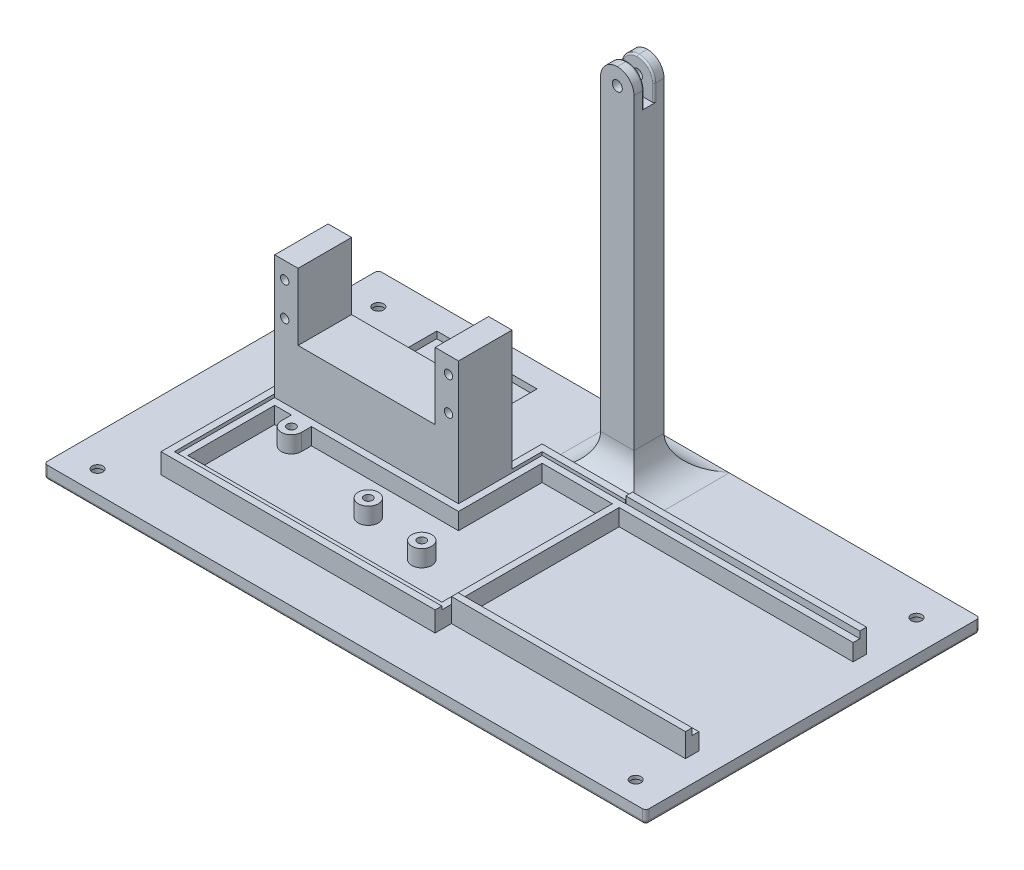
ISO-10303-21;
HEADER;
FILE_DESCRIPTION(('STEP AP214'),'2;1');
FILE_NAME('part.step','',(''),(''),'','','');
FILE_SCHEMA(('AUTOMOTIVE_DESIGN { 1 0 10303 214 1 1 1 1 }'));
ENDSEC;
DATA;
#1=APPLICATION_CONTEXT('core data for automotive mechanical design processes');
#2=APPLICATION_PROTOCOL_DEFINITION('international standard','automotive_design',2000,#1);
#3=PRODUCT_CONTEXT('',#1,'mechanical');
#4=PRODUCT('Part','Part','',(#3));
#5=PRODUCT_RELATED_PRODUCT_CATEGORY('part','',(#4));
#6=PRODUCT_DEFINITION_FORMATION('','',#4);
#7=PRODUCT_DEFINITION_CONTEXT('part definition',#1,'design');
#8=PRODUCT_DEFINITION('design','',#6,#7);
#9=PRODUCT_DEFINITION_SHAPE('','',#8);
#10=(LENGTH_UNIT() NAMED_UNIT(*) SI_UNIT(.MILLI.,.METRE.));
#11=(NAMED_UNIT(*) PLANE_ANGLE_UNIT() SI_UNIT($,.RADIAN.));
#12=(NAMED_UNIT(*) SI_UNIT($,.STERADIAN.) SOLID_ANGLE_UNIT());
#13=UNCERTAINTY_MEASURE_WITH_UNIT(LENGTH_MEASURE(1.E-05),#10,'distance_accuracy_value','');
#14=(GEOMETRIC_REPRESENTATION_CONTEXT(3) GLOBAL_UNCERTAINTY_ASSIGNED_CONTEXT((#13)) GLOBAL_UNIT_ASSIGNED_CONTEXT((#10,
#11,#12)) REPRESENTATION_CONTEXT('',''));
#15=CARTESIAN_POINT('',(0.,0.,0.));
#16=DIRECTION('',(0.,0.,1.));
#17=DIRECTION('',(1.,0.,0.));
#18=AXIS2_PLACEMENT_3D('',#15,#16,#17);
#19=CARTESIAN_POINT('',(12.5,9.,0.));
#20=DIRECTION('',(-1.,0.,0.));
#21=DIRECTION('',(0.,0.,1.));
#22=AXIS2_PLACEMENT_3D('',#19,#20,#21);
#23=PLANE('',#22);
#24=DIRECTION('',(0.,-1.,0.));
#25=VECTOR('',#24,1.);
#26=CARTESIAN_POINT('',(12.5,11.,-21.56));
#27=LINE('',#26,#25);
#28=CARTESIAN_POINT('',(12.5,10.,-21.56));
#29=VERTEX_POINT('',#28);
#30=CARTESIAN_POINT('',(12.5,9.,-21.56));
#31=VERTEX_POINT('',#30);
#32=EDGE_CURVE('E1418',#29,#31,#27,.T.);
#33=ORIENTED_EDGE('',*,*,#32,.F.);
#34=DIRECTION('',(0.,0.,-1.));
#35=VECTOR('',#34,1.);
#36=CARTESIAN_POINT('',(12.5,10.,-23.5));
#37=LINE('',#36,#35);
#38=CARTESIAN_POINT('',(12.5,10.,-21.5));
#39=VERTEX_POINT('',#38);
#40=EDGE_CURVE('E1644',#39,#29,#37,.T.);
#41=ORIENTED_EDGE('',*,*,#40,.F.);
#42=DIRECTION('',(0.,-1.,0.));
#43=VECTOR('',#42,1.);
#44=CARTESIAN_POINT('',(12.5,10.,-21.5));
#45=LINE('',#44,#43);
#46=CARTESIAN_POINT('',(12.5,9.,-21.5));
#47=VERTEX_POINT('',#46);
#48=EDGE_CURVE('E1628',#39,#47,#45,.T.);
#49=ORIENTED_EDGE('',*,*,#48,.T.);
#50=DIRECTION('',(0.,0.,1.));
#51=VECTOR('',#50,1.);
#52=CARTESIAN_POINT('',(12.5,9.,-19.56));
#53=LINE('',#52,#51);
#54=EDGE_CURVE('E1143',#31,#47,#53,.T.);
#55=ORIENTED_EDGE('',*,*,#54,.F.);
#56=EDGE_LOOP('',(#33,#41,#49,#55));
#57=FACE_BOUND('',#56,.T.);
#58=ADVANCED_FACE('F49',(#57),#23,.F.);
#59=CARTESIAN_POINT('',(0.,9.,0.));
#60=DIRECTION('',(0.,1.,0.));
#61=DIRECTION('',(0.,0.,1.));
#62=AXIS2_PLACEMENT_3D('',#59,#60,#61);
#63=PLANE('',#62);
#64=DIRECTION('',(-1.,0.,0.));
#65=VECTOR('',#64,1.);
#66=CARTESIAN_POINT('',(0.,9.,5.49999999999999));
#67=LINE('',#66,#65);
#68=CARTESIAN_POINT('',(-10.5,9.,5.49999999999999));
#69=VERTEX_POINT('',#68);
#70=CARTESIAN_POINT('',(-54.5,9.,5.5));
#71=VERTEX_POINT('',#70);
#72=EDGE_CURVE('E1656',#69,#71,#67,.T.);
#73=ORIENTED_EDGE('',*,*,#72,.F.);
#74=DIRECTION('',(0.,0.,1.));
#75=VECTOR('',#74,1.);
#76=CARTESIAN_POINT('',(-10.5,9.,0.));
#77=LINE('',#76,#75);
#78=CARTESIAN_POINT('',(-10.5,9.,-19.5));
#79=VERTEX_POINT('',#78);
#80=EDGE_CURVE('E1659',#79,#69,#77,.T.);
#81=ORIENTED_EDGE('',*,*,#80,.F.);
#82=DIRECTION('',(-1.,0.,0.));
#83=VECTOR('',#82,1.);
#84=CARTESIAN_POINT('',(0.,9.,-19.5));
#85=LINE('',#84,#83);
#86=CARTESIAN_POINT('',(10.5,9.,-19.5));
#87=VERTEX_POINT('',#86);
#88=EDGE_CURVE('E1663',#87,#79,#85,.T.);
#89=ORIENTED_EDGE('',*,*,#88,.F.);
#90=DIRECTION('',(0.,0.,-1.));
#91=VECTOR('',#90,1.);
#92=CARTESIAN_POINT('',(10.5,9.,0.));
#93=LINE('',#92,#91);
#94=CARTESIAN_POINT('',(10.5,9.,31.5));
#95=VERTEX_POINT('',#94);
#96=EDGE_CURVE('E1667',#95,#87,#93,.T.);
#97=ORIENTED_EDGE('',*,*,#96,.F.);
#98=DIRECTION('',(1.,0.,0.));
#99=VECTOR('',#98,1.);
#100=CARTESIAN_POINT('',(0.,9.,31.5));
#101=LINE('',#100,#99);
#102=CARTESIAN_POINT('',(-65.5,9.,31.5));
#103=VERTEX_POINT('',#102);
#104=EDGE_CURVE('E1161',#103,#95,#101,.T.);
#105=ORIENTED_EDGE('',*,*,#104,.F.);
#106=DIRECTION('',(0.,0.,1.));
#107=VECTOR('',#106,1.);
#108=CARTESIAN_POINT('',(-65.5,9.,0.));
#109=LINE('',#108,#107);
#110=CARTESIAN_POINT('',(-65.5,9.,5.5));
#111=VERTEX_POINT('',#110);
#112=EDGE_CURVE('E1154',#111,#103,#109,.T.);
#113=ORIENTED_EDGE('',*,*,#112,.F.);
#114=CARTESIAN_POINT('',(-60.5,9.,5.5));
#115=VERTEX_POINT('',#114);
#116=EDGE_CURVE('E1215',#115,#111,#67,.T.);
#117=ORIENTED_EDGE('',*,*,#116,.F.);
#118=DIRECTION('',(0.,0.,1.));
#119=VECTOR('',#118,1.);
#120=CARTESIAN_POINT('',(-60.5,9.,8.5));
#121=LINE('',#120,#119);
#122=CARTESIAN_POINT('',(-60.5,9.,8.5));
#123=VERTEX_POINT('',#122);
#124=EDGE_CURVE('E1545',#115,#123,#121,.T.);
#125=ORIENTED_EDGE('',*,*,#124,.T.);
#126=CARTESIAN_POINT('',(-57.5,9.,8.5));
#127=DIRECTION('',(0.,1.,0.));
#128=DIRECTION('',(0.,0.,1.));
#129=AXIS2_PLACEMENT_3D('',#126,#127,#128);
#130=CIRCLE('',#129,3.);
#131=CARTESIAN_POINT('',(-54.5,9.,8.5));
#132=VERTEX_POINT('',#131);
#133=EDGE_CURVE('E1551',#123,#132,#130,.T.);
#134=ORIENTED_EDGE('',*,*,#133,.T.);
#135=DIRECTION('',(0.,0.,-1.));
#136=VECTOR('',#135,1.);
#137=CARTESIAN_POINT('',(-54.5,9.,5.5));
#138=LINE('',#137,#136);
#139=EDGE_CURVE('E1562',#132,#71,#138,.T.);
#140=ORIENTED_EDGE('',*,*,#139,.T.);
#141=EDGE_LOOP('',(#73,#81,#89,#97,#105,#113,#117,#125,#134,#140));
#142=FACE_BOUND('',#141,.T.);
#143=CARTESIAN_POINT('',(-57.5,9.,8.5));
#144=DIRECTION('',(0.,1.,0.));
#145=DIRECTION('',(0.,0.,1.));
#146=AXIS2_PLACEMENT_3D('',#143,#144,#145);
#147=CIRCLE('',#146,1.25);
#148=CARTESIAN_POINT('',(-57.5,9.,9.75000000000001));
#149=VERTEX_POINT('',#148);
#150=EDGE_CURVE('E1559',#149,#149,#147,.T.);
#151=ORIENTED_EDGE('',*,*,#150,.F.);
#152=EDGE_LOOP('',(#151));
#153=FACE_BOUND('',#152,.T.);
#154=DIRECTION('',(0.,0.,-1.));
#155=VECTOR('',#154,1.);
#156=CARTESIAN_POINT('',(82.5,9.,-23.56));
#157=LINE('',#156,#155);
#158=CARTESIAN_POINT('',(82.5,9.,-19.56));
#159=VERTEX_POINT('',#158);
#160=CARTESIAN_POINT('',(82.5,9.,-21.56));
#161=VERTEX_POINT('',#160);
#162=EDGE_CURVE('E1458',#159,#161,#157,.T.);
#163=ORIENTED_EDGE('',*,*,#162,.T.);
#164=DIRECTION('',(1.,0.,0.));
#165=VECTOR('',#164,1.);
#166=CARTESIAN_POINT('',(12.5,9.,-21.56));
#167=LINE('',#166,#165);
#168=EDGE_CURVE('E1399',#31,#161,#167,.T.);
#169=ORIENTED_EDGE('',*,*,#168,.F.);
#170=ORIENTED_EDGE('',*,*,#54,.T.);
#171=DIRECTION('',(1.,0.,0.));
#172=VECTOR('',#171,1.);
#173=CARTESIAN_POINT('',(12.5,9.,-21.5));
#174=LINE('',#173,#172);
#175=CARTESIAN_POINT('',(-12.5,9.,-21.5));
#176=VERTEX_POINT('',#175);
#177=EDGE_CURVE('E1616',#176,#47,#174,.T.);
#178=ORIENTED_EDGE('',*,*,#177,.F.);
#179=DIRECTION('',(0.,0.,1.));
#180=VECTOR('',#179,1.);
#181=CARTESIAN_POINT('',(-12.5,9.,0.));
#182=LINE('',#181,#180);
#183=CARTESIAN_POINT('',(-12.5,9.00000000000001,3.49999999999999));
#184=VERTEX_POINT('',#183);
#185=EDGE_CURVE('E1159',#176,#184,#182,.T.);
#186=ORIENTED_EDGE('',*,*,#185,.T.);
#187=DIRECTION('',(-1.,0.,0.));
#188=VECTOR('',#187,1.);
#189=CARTESIAN_POINT('',(0.,9.,3.49999999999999));
#190=LINE('',#189,#188);
#191=CARTESIAN_POINT('',(-67.5,9.,3.49999999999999));
#192=VERTEX_POINT('',#191);
#193=EDGE_CURVE('E1168',#184,#192,#190,.T.);
#194=ORIENTED_EDGE('',*,*,#193,.T.);
#195=DIRECTION('',(0.,0.,-1.));
#196=VECTOR('',#195,1.);
#197=CARTESIAN_POINT('',(-67.5,9.,1.5));
#198=LINE('',#197,#196);
#199=CARTESIAN_POINT('',(-67.5,9.,33.5));
#200=VERTEX_POINT('',#199);
#201=EDGE_CURVE('E1592',#200,#192,#198,.T.);
#202=ORIENTED_EDGE('',*,*,#201,.F.);
#203=DIRECTION('',(-1.,0.,0.));
#204=VECTOR('',#203,1.);
#205=CARTESIAN_POINT('',(-67.5,9.,33.5));
#206=LINE('',#205,#204);
#207=CARTESIAN_POINT('',(12.5,9.,33.5));
#208=VERTEX_POINT('',#207);
#209=EDGE_CURVE('E1612',#208,#200,#206,.T.);
#210=ORIENTED_EDGE('',*,*,#209,.F.);
#211=DIRECTION('',(0.,0.,-1.));
#212=VECTOR('',#211,1.);
#213=CARTESIAN_POINT('',(12.5,9.,0.));
#214=LINE('',#213,#212);
#215=CARTESIAN_POINT('',(12.5,9.,30.6));
#216=VERTEX_POINT('',#215);
#217=EDGE_CURVE('E1153',#208,#216,#214,.T.);
#218=ORIENTED_EDGE('',*,*,#217,.T.);
#219=DIRECTION('',(0.,0.,1.));
#220=VECTOR('',#219,1.);
#221=CARTESIAN_POINT('',(12.5,9.,30.6));
#222=LINE('',#221,#220);
#223=CARTESIAN_POINT('',(12.5,9.,28.6));
#224=VERTEX_POINT('',#223);
#225=EDGE_CURVE('E1414',#224,#216,#222,.T.);
#226=ORIENTED_EDGE('',*,*,#225,.F.);
#227=DIRECTION('',(-1.,0.,0.));
#228=VECTOR('',#227,1.);
#229=CARTESIAN_POINT('',(12.5,9.,28.6));
#230=LINE('',#229,#228);
#231=CARTESIAN_POINT('',(82.5,9.,28.6));
#232=VERTEX_POINT('',#231);
#233=EDGE_CURVE('E1436',#232,#224,#230,.T.);
#234=ORIENTED_EDGE('',*,*,#233,.F.);
#235=DIRECTION('',(0.,0.,-1.));
#236=VECTOR('',#235,1.);
#237=CARTESIAN_POINT('',(82.5,9.,26.6));
#238=LINE('',#237,#236);
#239=CARTESIAN_POINT('',(82.5,9.,26.6));
#240=VERTEX_POINT('',#239);
#241=EDGE_CURVE('E1501',#232,#240,#238,.T.);
#242=ORIENTED_EDGE('',*,*,#241,.T.);
#243=DIRECTION('',(-1.,0.,0.));
#244=VECTOR('',#243,1.);
#245=CARTESIAN_POINT('',(12.5,9.,26.6));
#246=LINE('',#245,#244);
#247=CARTESIAN_POINT('',(12.5,9.,26.6));
#248=VERTEX_POINT('',#247);
#249=EDGE_CURVE('E1151',#240,#248,#246,.T.);
#250=ORIENTED_EDGE('',*,*,#249,.T.);
#251=CARTESIAN_POINT('',(12.5,9.,-19.56));
#252=VERTEX_POINT('',#251);
#253=EDGE_CURVE('E1136',#248,#252,#214,.T.);
#254=ORIENTED_EDGE('',*,*,#253,.T.);
#255=DIRECTION('',(1.,0.,0.));
#256=VECTOR('',#255,1.);
#257=CARTESIAN_POINT('',(82.5,9.,-19.56));
#258=LINE('',#257,#256);
#259=EDGE_CURVE('E1148',#252,#159,#258,.T.);
#260=ORIENTED_EDGE('',*,*,#259,.T.);
#261=EDGE_LOOP('',(#163,#169,#170,#178,#186,#194,#202,#210,#218,#226,#234,#242,#250,#254,#260));
#262=FACE_BOUND('',#261,.T.);
#263=ADVANCED_FACE('F1110',(#142,#153,#262),#63,.T.);
#264=CARTESIAN_POINT('',(0.,4.,0.));
#265=DIRECTION('',(0.,-1.,0.));
#266=DIRECTION('',(0.,0.,-1.));
#267=AXIS2_PLACEMENT_3D('',#264,#265,#266);
#268=PLANE('',#267);
#269=CARTESIAN_POINT('',(80.5,4.,43.5));
#270=DIRECTION('',(0.,1.,0.));
#271=DIRECTION('',(0.,0.,1.));
#272=AXIS2_PLACEMENT_3D('',#269,#270,#271);
#273=CIRCLE('',#272,1.60000000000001);
#274=CARTESIAN_POINT('',(80.5,4.,45.1));
#275=VERTEX_POINT('',#274);
#276=EDGE_CURVE('E1297',#275,#275,#273,.T.);
#277=ORIENTED_EDGE('',*,*,#276,.F.);
#278=EDGE_LOOP('',(#277));
#279=FACE_BOUND('',#278,.T.);
#280=CARTESIAN_POINT('',(-80.5,4.,-40.5));
#281=DIRECTION('',(0.,1.,0.));
#282=DIRECTION('',(0.,0.,1.));
#283=AXIS2_PLACEMENT_3D('',#280,#281,#282);
#284=CIRCLE('',#283,1.60000000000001);
#285=CARTESIAN_POINT('',(-80.5,4.,-38.9));
#286=VERTEX_POINT('',#285);
#287=EDGE_CURVE('E1296',#286,#286,#284,.T.);
#288=ORIENTED_EDGE('',*,*,#287,.F.);
#289=EDGE_LOOP('',(#288));
#290=FACE_BOUND('',#289,.T.);
#291=CARTESIAN_POINT('',(80.5,4.,-40.5));
#292=DIRECTION('',(0.,1.,0.));
#293=DIRECTION('',(0.,0.,1.));
#294=AXIS2_PLACEMENT_3D('',#291,#292,#293);
#295=CIRCLE('',#294,1.60000000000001);
#296=CARTESIAN_POINT('',(80.5,4.,-38.9));
#297=VERTEX_POINT('',#296);
#298=EDGE_CURVE('E771',#297,#297,#295,.T.);
#299=ORIENTED_EDGE('',*,*,#298,.F.);
#300=EDGE_LOOP('',(#299));
#301=FACE_BOUND('',#300,.T.);
#302=CARTESIAN_POINT('',(-80.5,4.,43.5));
#303=DIRECTION('',(0.,1.,0.));
#304=DIRECTION('',(0.,0.,1.));
#305=AXIS2_PLACEMENT_3D('',#302,#303,#304);
#306=CIRCLE('',#305,1.60000000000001);
#307=CARTESIAN_POINT('',(-80.5,4.,45.1));
#308=VERTEX_POINT('',#307);
#309=EDGE_CURVE('E1301',#308,#308,#306,.T.);
#310=ORIENTED_EDGE('',*,*,#309,.F.);
#311=EDGE_LOOP('',(#310));
#312=FACE_BOUND('',#311,.T.);
#313=DIRECTION('',(1.,0.,0.));
#314=VECTOR('',#313,1.);
#315=CARTESIAN_POINT('',(-65.5,4.,-29.));
#316=LINE('',#315,#314);
#317=CARTESIAN_POINT('',(-65.5,4.,-29.));
#318=VERTEX_POINT('',#317);
#319=CARTESIAN_POINT('',(-35.5,4.,-29.));
#320=VERTEX_POINT('',#319);
#321=EDGE_CURVE('E1329',#318,#320,#316,.T.);
#322=ORIENTED_EDGE('',*,*,#321,.F.);
#323=DIRECTION('',(0.,0.,1.));
#324=VECTOR('',#323,1.);
#325=CARTESIAN_POINT('',(-65.5,4.,-43.));
#326=LINE('',#325,#324);
#327=CARTESIAN_POINT('',(-65.5,4.,-43.));
#328=VERTEX_POINT('',#327);
#329=EDGE_CURVE('E1308',#328,#318,#326,.T.);
#330=ORIENTED_EDGE('',*,*,#329,.F.);
#331=DIRECTION('',(-1.,0.,0.));
#332=VECTOR('',#331,1.);
#333=CARTESIAN_POINT('',(-65.5,4.,-43.));
#334=LINE('',#333,#332);
#335=CARTESIAN_POINT('',(-35.5,4.,-43.));
#336=VERTEX_POINT('',#335);
#337=EDGE_CURVE('E1314',#336,#328,#334,.T.);
#338=ORIENTED_EDGE('',*,*,#337,.F.);
#339=DIRECTION('',(0.,0.,-1.));
#340=VECTOR('',#339,1.);
#341=CARTESIAN_POINT('',(-35.5,4.,-43.));
#342=LINE('',#341,#340);
#343=EDGE_CURVE('E1333',#320,#336,#342,.T.);
#344=ORIENTED_EDGE('',*,*,#343,.F.);
#345=EDGE_LOOP('',(#322,#330,#338,#344));
#346=FACE_BOUND('',#345,.T.);
#347=DIRECTION('',(1.,0.,0.));
#348=VECTOR('',#347,1.);
#349=CARTESIAN_POINT('',(82.5,4.,-19.56));
#350=LINE('',#349,#348);
#351=CARTESIAN_POINT('',(12.5,4.,-19.56));
#352=VERTEX_POINT('',#351);
#353=CARTESIAN_POINT('',(82.5,4.,-19.56));
#354=VERTEX_POINT('',#353);
#355=EDGE_CURVE('E1464',#352,#354,#350,.T.);
#356=ORIENTED_EDGE('',*,*,#355,.F.);
#357=DIRECTION('',(0.,0.,-1.));
#358=VECTOR('',#357,1.);
#359=CARTESIAN_POINT('',(12.5,4.,0.));
#360=LINE('',#359,#358);
#361=CARTESIAN_POINT('',(12.5,4.,26.6));
#362=VERTEX_POINT('',#361);
#363=EDGE_CURVE('E1138',#362,#352,#360,.T.);
#364=ORIENTED_EDGE('',*,*,#363,.F.);
#365=DIRECTION('',(-1.,0.,0.));
#366=VECTOR('',#365,1.);
#367=CARTESIAN_POINT('',(12.5,4.,26.6));
#368=LINE('',#367,#366);
#369=CARTESIAN_POINT('',(82.5,4.,26.6));
#370=VERTEX_POINT('',#369);
#371=EDGE_CURVE('E1497',#370,#362,#368,.T.);
#372=ORIENTED_EDGE('',*,*,#371,.F.);
#373=DIRECTION('',(0.,0.,-1.));
#374=VECTOR('',#373,1.);
#375=CARTESIAN_POINT('',(82.5,4.,26.6));
#376=LINE('',#375,#374);
#377=CARTESIAN_POINT('',(82.5,4.,30.6));
#378=VERTEX_POINT('',#377);
#379=EDGE_CURVE('E1500',#378,#370,#376,.T.);
#380=ORIENTED_EDGE('',*,*,#379,.F.);
#381=DIRECTION('',(1.,0.,0.));
#382=VECTOR('',#381,1.);
#383=CARTESIAN_POINT('',(82.5,4.,30.6));
#384=LINE('',#383,#382);
#385=CARTESIAN_POINT('',(12.5,4.,30.6));
#386=VERTEX_POINT('',#385);
#387=EDGE_CURVE('E1468',#386,#378,#384,.T.);
#388=ORIENTED_EDGE('',*,*,#387,.F.);
#389=CARTESIAN_POINT('',(12.5,4.,35.5));
#390=VERTEX_POINT('',#389);
#391=EDGE_CURVE('E1198',#390,#386,#360,.T.);
#392=ORIENTED_EDGE('',*,*,#391,.F.);
#393=DIRECTION('',(1.,0.,0.));
#394=VECTOR('',#393,1.);
#395=CARTESIAN_POINT('',(0.,4.,35.5));
#396=LINE('',#395,#394);
#397=CARTESIAN_POINT('',(-69.5,4.,35.5));
#398=VERTEX_POINT('',#397);
#399=EDGE_CURVE('E1211',#398,#390,#396,.T.);
#400=ORIENTED_EDGE('',*,*,#399,.F.);
#401=DIRECTION('',(0.,0.,1.));
#402=VECTOR('',#401,1.);
#403=CARTESIAN_POINT('',(-69.5,4.,0.));
#404=LINE('',#403,#402);
#405=CARTESIAN_POINT('',(-69.5,4.,1.5));
#406=VERTEX_POINT('',#405);
#407=EDGE_CURVE('E1207',#406,#398,#404,.T.);
#408=ORIENTED_EDGE('',*,*,#407,.F.);
#409=DIRECTION('',(-1.,0.,0.));
#410=VECTOR('',#409,1.);
#411=CARTESIAN_POINT('',(0.,4.,1.49999999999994));
#412=LINE('',#411,#410);
#413=CARTESIAN_POINT('',(-67.5,4.,1.5));
#414=VERTEX_POINT('',#413);
#415=EDGE_CURVE('E549',#414,#406,#412,.T.);
#416=ORIENTED_EDGE('',*,*,#415,.F.);
#417=DIRECTION('',(0.,0.,1.));
#418=VECTOR('',#417,1.);
#419=CARTESIAN_POINT('',(-67.5,4.,-14.5));
#420=LINE('',#419,#418);
#421=CARTESIAN_POINT('',(-67.5,4.,-12.5));
#422=VERTEX_POINT('',#421);
#423=EDGE_CURVE('E539',#422,#414,#420,.T.);
#424=ORIENTED_EDGE('',*,*,#423,.F.);
#425=DIRECTION('',(-1.,0.,0.));
#426=VECTOR('',#425,1.);
#427=CARTESIAN_POINT('',(-67.5,4.,-12.5));
#428=LINE('',#427,#426);
#429=CARTESIAN_POINT('',(-14.5,4.,-12.5));
#430=VERTEX_POINT('',#429);
#431=EDGE_CURVE('E524',#430,#422,#428,.T.);
#432=ORIENTED_EDGE('',*,*,#431,.F.);
#433=DIRECTION('',(0.,0.,1.));
#434=VECTOR('',#433,1.);
#435=CARTESIAN_POINT('',(-14.5,4.,0.));
#436=LINE('',#435,#434);
#437=CARTESIAN_POINT('',(-14.5,4.,-21.5));
#438=VERTEX_POINT('',#437);
#439=EDGE_CURVE('E1202',#438,#430,#436,.T.);
#440=ORIENTED_EDGE('',*,*,#439,.F.);
#441=DIRECTION('',(1.,0.,0.));
#442=VECTOR('',#441,1.);
#443=CARTESIAN_POINT('',(-5.,4.,-21.5));
#444=LINE('',#443,#442);
#445=CARTESIAN_POINT('',(-15.,4.,-21.5));
#446=VERTEX_POINT('',#445);
#447=EDGE_CURVE('E698',#438,#446,#444,.F.);
#448=ORIENTED_EDGE('',*,*,#447,.T.);
#449=DIRECTION('',(0.,0.,1.));
#450=VECTOR('',#449,1.);
#451=CARTESIAN_POINT('',(-15.,4.,-40.5));
#452=LINE('',#451,#450);
#453=CARTESIAN_POINT('',(-15.0000000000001,4.,-50.));
#454=VERTEX_POINT('',#453);
#455=EDGE_CURVE('E705',#446,#454,#452,.F.);
#456=ORIENTED_EDGE('',*,*,#455,.T.);
#457=DIRECTION('',(-1.,0.,0.));
#458=VECTOR('',#457,1.);
#459=CARTESIAN_POINT('',(-90.,4.,-50.));
#460=LINE('',#459,#458);
#461=CARTESIAN_POINT('',(-89.,4.,-50.));
#462=VERTEX_POINT('',#461);
#463=EDGE_CURVE('E618',#454,#462,#460,.T.);
#464=ORIENTED_EDGE('',*,*,#463,.T.);
#465=CARTESIAN_POINT('',(-89.,4.,-49.));
#466=DIRECTION('',(0.,-1.,0.));
#467=DIRECTION('',(0.,0.,-1.));
#468=AXIS2_PLACEMENT_3D('',#465,#466,#467);
#469=CIRCLE('',#468,1.);
#470=CARTESIAN_POINT('',(-90.,4.,-49.));
#471=VERTEX_POINT('',#470);
#472=EDGE_CURVE('E863',#462,#471,#469,.F.);
#473=ORIENTED_EDGE('',*,*,#472,.T.);
#474=DIRECTION('',(0.,0.,1.));
#475=VECTOR('',#474,1.);
#476=CARTESIAN_POINT('',(-90.,4.,50.));
#477=LINE('',#476,#475);
#478=CARTESIAN_POINT('',(-90.,4.,49.));
#479=VERTEX_POINT('',#478);
#480=EDGE_CURVE('E622',#471,#479,#477,.T.);
#481=ORIENTED_EDGE('',*,*,#480,.T.);
#482=CARTESIAN_POINT('',(-89.,4.,49.));
#483=DIRECTION('',(0.,-1.,0.));
#484=DIRECTION('',(0.,0.,-1.));
#485=AXIS2_PLACEMENT_3D('',#482,#483,#484);
#486=CIRCLE('',#485,1.);
#487=CARTESIAN_POINT('',(-89.,4.,50.));
#488=VERTEX_POINT('',#487);
#489=EDGE_CURVE('E860',#479,#488,#486,.F.);
#490=ORIENTED_EDGE('',*,*,#489,.T.);
#491=DIRECTION('',(1.,0.,0.));
#492=VECTOR('',#491,1.);
#493=CARTESIAN_POINT('',(-90.,4.,50.));
#494=LINE('',#493,#492);
#495=CARTESIAN_POINT('',(88.9999999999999,4.,50.));
#496=VERTEX_POINT('',#495);
#497=EDGE_CURVE('E627',#488,#496,#494,.T.);
#498=ORIENTED_EDGE('',*,*,#497,.T.);
#499=CARTESIAN_POINT('',(89.,4.,49.));
#500=DIRECTION('',(0.,-1.,0.));
#501=DIRECTION('',(0.,0.,-1.));
#502=AXIS2_PLACEMENT_3D('',#499,#500,#501);
#503=CIRCLE('',#502,1.);
#504=CARTESIAN_POINT('',(90.,4.,49.));
#505=VERTEX_POINT('',#504);
#506=EDGE_CURVE('E869',#496,#505,#503,.F.);
#507=ORIENTED_EDGE('',*,*,#506,.T.);
#508=DIRECTION('',(0.,0.,-1.));
#509=VECTOR('',#508,1.);
#510=CARTESIAN_POINT('',(90.,4.,50.));
#511=LINE('',#510,#509);
#512=CARTESIAN_POINT('',(90.,4.,-49.));
#513=VERTEX_POINT('',#512);
#514=EDGE_CURVE('E614',#505,#513,#511,.T.);
#515=ORIENTED_EDGE('',*,*,#514,.T.);
#516=CARTESIAN_POINT('',(89.,4.,-49.));
#517=DIRECTION('',(0.,-1.,0.));
#518=DIRECTION('',(0.,0.,-1.));
#519=AXIS2_PLACEMENT_3D('',#516,#517,#518);
#520=CIRCLE('',#519,1.);
#521=CARTESIAN_POINT('',(88.9999999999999,4.,-50.));
#522=VERTEX_POINT('',#521);
#523=EDGE_CURVE('E866',#513,#522,#520,.F.);
#524=ORIENTED_EDGE('',*,*,#523,.T.);
#525=CARTESIAN_POINT('',(15.,4.,-50.));
#526=VERTEX_POINT('',#525);
#527=EDGE_CURVE('E619',#522,#526,#460,.T.);
#528=ORIENTED_EDGE('',*,*,#527,.T.);
#529=DIRECTION('',(0.,0.,-1.));
#530=VECTOR('',#529,1.);
#531=CARTESIAN_POINT('',(15.,4.,-31.5));
#532=LINE('',#531,#530);
#533=CARTESIAN_POINT('',(15.,4.,-23.56));
#534=VERTEX_POINT('',#533);
#535=EDGE_CURVE('E701',#526,#534,#532,.F.);
#536=ORIENTED_EDGE('',*,*,#535,.T.);
#537=DIRECTION('',(-1.,0.,0.));
#538=VECTOR('',#537,1.);
#539=CARTESIAN_POINT('',(12.5,4.,-23.56));
#540=LINE('',#539,#538);
#541=CARTESIAN_POINT('',(82.5,4.,-23.56));
#542=VERTEX_POINT('',#541);
#543=EDGE_CURVE('E1459',#542,#534,#540,.T.);
#544=ORIENTED_EDGE('',*,*,#543,.F.);
#545=DIRECTION('',(0.,0.,-1.));
#546=VECTOR('',#545,1.);
#547=CARTESIAN_POINT('',(82.5,4.,-23.56));
#548=LINE('',#547,#546);
#549=EDGE_CURVE('E1467',#354,#542,#548,.T.);
#550=ORIENTED_EDGE('',*,*,#549,.F.);
#551=EDGE_LOOP('',(#356,#364,#372,#380,#388,#392,#400,#408,#416,#424,#432,#440,#448,#456,#464,
#473,#481,#490,#498,#507,#515,#524,#528,#536,#544,#550));
#552=FACE_BOUND('',#551,.T.);
#553=ADVANCED_FACE('F547',(#279,#290,#301,#312,#346,#552),#268,.F.);
#554=CARTESIAN_POINT('',(-5.,14.,-21.5));
#555=DIRECTION('',(-1.,0.,0.));
#556=DIRECTION('',(0.,0.,1.));
#557=AXIS2_PLACEMENT_3D('',#554,#555,#556);
#558=CYLINDRICAL_SURFACE('',#557,10.);
#559=DIRECTION('',(-1.,0.,0.));
#560=VECTOR('',#559,1.);
#561=CARTESIAN_POINT('',(-5.,4.21448008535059,-23.56));
#562=LINE('',#561,#560);
#563=CARTESIAN_POINT('',(12.94,4.21448008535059,-23.56));
#564=VERTEX_POINT('',#563);
#565=CARTESIAN_POINT('',(12.5,4.21448008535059,-23.56));
#566=VERTEX_POINT('',#565);
#567=EDGE_CURVE('E1513',#564,#566,#562,.T.);
#568=ORIENTED_EDGE('',*,*,#567,.F.);
#569=CARTESIAN_POINT('',(15.,14.,-21.5));
#570=DIRECTION('',(-0.707106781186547,0.,0.707106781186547));
#571=DIRECTION('',(-0.707106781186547,0.,-0.707106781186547));
#572=AXIS2_PLACEMENT_3D('',#569,#570,#571);
#573=ELLIPSE('',#572,14.1421356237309,10.);
#574=CARTESIAN_POINT('',(5.,14.,-31.5));
#575=VERTEX_POINT('',#574);
#576=EDGE_CURVE('E739',#564,#575,#573,.F.);
#577=ORIENTED_EDGE('',*,*,#576,.T.);
#578=DIRECTION('',(1.,0.,0.));
#579=VECTOR('',#578,1.);
#580=CARTESIAN_POINT('',(5.,14.,-31.5));
#581=LINE('',#580,#579);
#582=CARTESIAN_POINT('',(-5.,14.,-31.5));
#583=VERTEX_POINT('',#582);
#584=EDGE_CURVE('E715',#583,#575,#581,.T.);
#585=ORIENTED_EDGE('',*,*,#584,.F.);
#586=CARTESIAN_POINT('',(-15.,14.,-21.5));
#587=DIRECTION('',(-0.707106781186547,0.,-0.707106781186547));
#588=DIRECTION('',(-0.707106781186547,0.,0.707106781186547));
#589=AXIS2_PLACEMENT_3D('',#586,#587,#588);
#590=ELLIPSE('',#589,14.1421356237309,10.);
#591=CARTESIAN_POINT('',(-13.,4.20204102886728,-23.5));
#592=VERTEX_POINT('',#591);
#593=EDGE_CURVE('E730',#592,#583,#590,.F.);
#594=ORIENTED_EDGE('',*,*,#593,.F.);
#595=DIRECTION('',(-1.,0.,0.));
#596=VECTOR('',#595,1.);
#597=CARTESIAN_POINT('',(-5.,4.20204102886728,-23.5));
#598=LINE('',#597,#596);
#599=CARTESIAN_POINT('',(12.5,4.20204102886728,-23.5));
#600=VERTEX_POINT('',#599);
#601=EDGE_CURVE('E900',#600,#592,#598,.T.);
#602=ORIENTED_EDGE('',*,*,#601,.F.);
#603=CARTESIAN_POINT('',(12.5,14.,-21.5));
#604=DIRECTION('',(1.,0.,0.));
#605=DIRECTION('',(0.,0.,-1.));
#606=AXIS2_PLACEMENT_3D('',#603,#604,#605);
#607=CIRCLE('',#606,10.);
#608=EDGE_CURVE('E1483',#566,#600,#607,.F.);
#609=ORIENTED_EDGE('',*,*,#608,.F.);
#610=EDGE_LOOP('',(#568,#577,#585,#594,#602,#609));
#611=FACE_BOUND('',#610,.T.);
#612=ADVANCED_FACE('F751',(#611),#558,.F.);
#613=CARTESIAN_POINT('',(15.,14.,-31.5));
#614=DIRECTION('',(0.,0.,1.));
#615=DIRECTION('',(1.,0.,0.));
#616=AXIS2_PLACEMENT_3D('',#613,#614,#615);
#617=CYLINDRICAL_SURFACE('',#616,10.);
#618=CARTESIAN_POINT('',(15.,14.,-23.56));
#619=DIRECTION('',(0.,0.,1.));
#620=DIRECTION('',(1.,0.,0.));
#621=AXIS2_PLACEMENT_3D('',#618,#619,#620);
#622=CIRCLE('',#621,10.);
#623=EDGE_CURVE('E916',#534,#564,#622,.F.);
#624=ORIENTED_EDGE('',*,*,#623,.F.);
#625=ORIENTED_EDGE('',*,*,#535,.F.);
#626=CARTESIAN_POINT('',(15.,4.,-50.));
#627=CARTESIAN_POINT('',(14.9634862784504,3.9999944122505,-50.0002201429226));
#628=CARTESIAN_POINT('',(14.927379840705,4.00019904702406,-49.9960120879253));
#629=CARTESIAN_POINT('',(14.8573920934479,4.00095899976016,-49.9811188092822));
#630=CARTESIAN_POINT('',(14.8234779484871,4.00150560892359,-49.9705946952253));
#631=CARTESIAN_POINT('',(14.7161522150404,4.00374841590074,-49.9293911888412));
#632=CARTESIAN_POINT('',(14.6463922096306,4.00602736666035,-49.8899660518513));
#633=CARTESIAN_POINT('',(14.510928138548,4.01173322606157,-49.8026606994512));
#634=CARTESIAN_POINT('',(14.4453555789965,4.01518552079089,-49.7546056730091));
#635=CARTESIAN_POINT('',(14.3093966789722,4.02361681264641,-49.6489359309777));
#636=CARTESIAN_POINT('',(14.2393671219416,4.02872866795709,-49.5908643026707));
#637=CARTESIAN_POINT('',(14.1012231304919,4.04023123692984,-49.4725948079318));
#638=CARTESIAN_POINT('',(14.0331100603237,4.04662283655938,-49.4123954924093));
#639=CARTESIAN_POINT('',(13.8302918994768,4.06771341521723,-49.2299865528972));
#640=CARTESIAN_POINT('',(13.6972779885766,4.08431722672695,-49.1061086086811));
#641=CARTESIAN_POINT('',(13.4345780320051,4.12240732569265,-48.8581206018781));
#642=CARTESIAN_POINT('',(13.3048724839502,4.14384641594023,-48.7340235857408));
#643=CARTESIAN_POINT('',(13.0469344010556,4.19170121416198,-48.4854308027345));
#644=CARTESIAN_POINT('',(12.9187010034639,4.21811383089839,-48.3609353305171));
#645=CARTESIAN_POINT('',(12.4381352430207,4.3269516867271,-47.8926016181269));
#646=CARTESIAN_POINT('',(12.089217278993,4.42604372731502,-47.5489474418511));
#647=CARTESIAN_POINT('',(11.3990135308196,4.66372460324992,-46.8670859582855));
#648=CARTESIAN_POINT('',(11.0577343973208,4.80234651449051,-46.5288834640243));
#649=CARTESIAN_POINT('',(10.3844557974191,5.1210417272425,-45.8606648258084));
#650=CARTESIAN_POINT('',(10.0524850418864,5.30123019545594,-45.5306743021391));
#651=CARTESIAN_POINT('',(9.40234292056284,5.70467239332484,-44.8839459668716));
#652=CARTESIAN_POINT('',(9.08416156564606,5.92789428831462,-44.5671985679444));
#653=CARTESIAN_POINT('',(8.5803685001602,6.32861228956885,-44.0654754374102));
#654=CARTESIAN_POINT('',(8.3892546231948,6.49247996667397,-43.8750965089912));
#655=CARTESIAN_POINT('',(8.01570208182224,6.83868239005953,-43.5029184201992));
#656=CARTESIAN_POINT('',(7.833262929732,7.02101609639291,-43.3211187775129));
#657=CARTESIAN_POINT('',(7.30208983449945,7.5957943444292,-42.791756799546));
#658=CARTESIAN_POINT('',(6.96834553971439,8.01691334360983,-42.4590810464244));
#659=CARTESIAN_POINT('',(6.42322520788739,8.83975683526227,-41.915733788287));
#660=CARTESIAN_POINT('',(6.20088274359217,9.22687102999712,-41.6941251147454));
#661=CARTESIAN_POINT('',(5.9027813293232,9.84156619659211,-41.3970781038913));
#662=CARTESIAN_POINT('',(5.80930480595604,10.0521695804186,-41.3039453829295));
#663=CARTESIAN_POINT('',(5.63559085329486,10.4840443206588,-41.1309073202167));
#664=CARTESIAN_POINT('',(5.55535076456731,10.7053135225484,-41.0509993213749));
#665=CARTESIAN_POINT('',(5.42131833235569,11.1210062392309,-40.9175696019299));
#666=CARTESIAN_POINT('',(5.36534804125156,11.3140327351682,-40.861871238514));
#667=CARTESIAN_POINT('',(5.26461906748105,11.7058241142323,-40.7616814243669));
#668=CARTESIAN_POINT('',(5.21985824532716,11.9045878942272,-40.7171878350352));
#669=CARTESIAN_POINT('',(5.14234772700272,12.3063428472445,-40.6402079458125));
#670=CARTESIAN_POINT('',(5.1095761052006,12.5093255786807,-40.6076997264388));
#671=CARTESIAN_POINT('',(5.05652364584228,12.918437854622,-40.5551718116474));
#672=CARTESIAN_POINT('',(5.036235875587,13.1245655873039,-40.5351451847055));
#673=CARTESIAN_POINT('',(5.01506117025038,13.4405686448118,-40.5143683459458));
#674=CARTESIAN_POINT('',(5.00953662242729,13.5498638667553,-40.5089809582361));
#675=CARTESIAN_POINT('',(5.00207910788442,13.7685979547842,-40.5017974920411));
#676=CARTESIAN_POINT('',(5.00014298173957,13.8780366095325,-40.4999982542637));
#677=CARTESIAN_POINT('',(5.00000782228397,13.9874921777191,-40.5));
#678=B_SPLINE_CURVE_WITH_KNOTS('',3,(#626,#627,#628,#629,#630,#631,#632,#633,#634,#635,#636,
#637,#638,#639,#640,#641,#642,#643,#644,#645,#646,#647,#648,#649,#650,#651,#652,#653,#654,#655,
#656,#657,#658,#659,#660,#661,#662,#663,#664,#665,#666,#667,#668,#669,#670,#671,#672,#673,#674,
#675,#676,#677),.UNSPECIFIED.,.F.,.F.,(4,2,2,2,2,2,2,2,2,2,2,2,2,2,2,2,2,2,2,2,2,2,2,2,2,4),(0.,
0.108662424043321,0.214664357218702,0.453244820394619,0.697355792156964,0.970539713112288,
1.24391341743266,1.79132714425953,2.33361259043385,2.87556209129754,4.37280171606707,
5.87129782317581,7.37399670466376,8.87558817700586,9.82174301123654,10.767844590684,
12.6545167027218,14.1436508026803,14.8884426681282,15.6330847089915,16.2581139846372,
16.8830238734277,17.5067851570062,18.1301997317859,18.4587976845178,18.7871061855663),.UNSPECIFIED.);
#679=CARTESIAN_POINT('',(5.,13.9874921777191,-40.5));
#680=VERTEX_POINT('',#679);
#681=EDGE_CURVE('E763',#680,#526,#678,.F.);
#682=ORIENTED_EDGE('',*,*,#681,.F.);
#683=CARTESIAN_POINT('',(15.,14.,-40.5));
#684=DIRECTION('',(0.,0.,1.));
#685=DIRECTION('',(1.,0.,0.));
#686=AXIS2_PLACEMENT_3D('',#683,#684,#685);
#687=CIRCLE('',#686,10.);
#688=CARTESIAN_POINT('',(5.,14.,-40.5));
#689=VERTEX_POINT('',#688);
#690=EDGE_CURVE('E722',#689,#680,#687,.T.);
#691=ORIENTED_EDGE('',*,*,#690,.F.);
#692=DIRECTION('',(0.,0.,-1.));
#693=VECTOR('',#692,1.);
#694=CARTESIAN_POINT('',(5.,14.,-40.5));
#695=LINE('',#694,#693);
#696=EDGE_CURVE('E712',#575,#689,#695,.T.);
#697=ORIENTED_EDGE('',*,*,#696,.F.);
#698=ORIENTED_EDGE('',*,*,#576,.F.);
#699=EDGE_LOOP('',(#624,#625,#682,#691,#697,#698));
#700=FACE_BOUND('',#699,.T.);
#701=ADVANCED_FACE('F754',(#700),#617,.F.);
#702=DIRECTION('',(0.,-1.,0.));
#703=VECTOR('',#702,1.);
#704=CARTESIAN_POINT('',(12.5,9.,-19.56));
#705=LINE('',#704,#703);
#706=EDGE_CURVE('E1133',#252,#352,#705,.T.);
#707=ORIENTED_EDGE('',*,*,#706,.F.);
#708=ORIENTED_EDGE('',*,*,#253,.F.);
#709=DIRECTION('',(0.,-1.,0.));
#710=VECTOR('',#709,1.);
#711=CARTESIAN_POINT('',(12.5,9.,26.6));
#712=LINE('',#711,#710);
#713=EDGE_CURVE('E1494',#248,#362,#712,.T.);
#714=ORIENTED_EDGE('',*,*,#713,.T.);
#715=ORIENTED_EDGE('',*,*,#363,.T.);
#716=EDGE_LOOP('',(#707,#708,#714,#715));
#717=FACE_BOUND('',#716,.T.);
#718=ADVANCED_FACE('F759',(#717),#23,.F.);
#719=DIRECTION('',(0.,-1.,0.));
#720=VECTOR('',#719,1.);
#721=CARTESIAN_POINT('',(12.5,9.,30.6));
#722=LINE('',#721,#720);
#723=EDGE_CURVE('E1423',#216,#386,#722,.T.);
#724=ORIENTED_EDGE('',*,*,#723,.F.);
#725=ORIENTED_EDGE('',*,*,#217,.F.);
#726=DIRECTION('',(0.,-1.,0.));
#727=VECTOR('',#726,1.);
#728=CARTESIAN_POINT('',(12.5,10.,33.5));
#729=LINE('',#728,#727);
#730=CARTESIAN_POINT('',(12.5,10.,33.5));
#731=VERTEX_POINT('',#730);
#732=EDGE_CURVE('E1621',#731,#208,#729,.T.);
#733=ORIENTED_EDGE('',*,*,#732,.F.);
#734=DIRECTION('',(0.,0.,-1.));
#735=VECTOR('',#734,1.);
#736=CARTESIAN_POINT('',(12.5,10.,33.5));
#737=LINE('',#736,#735);
#738=CARTESIAN_POINT('',(12.5,10.,35.5));
#739=VERTEX_POINT('',#738);
#740=EDGE_CURVE('E1600',#739,#731,#737,.T.);
#741=ORIENTED_EDGE('',*,*,#740,.F.);
#742=DIRECTION('',(0.,-1.,0.));
#743=VECTOR('',#742,1.);
#744=CARTESIAN_POINT('',(12.5,9.,35.5));
#745=LINE('',#744,#743);
#746=EDGE_CURVE('E1216',#739,#390,#745,.T.);
#747=ORIENTED_EDGE('',*,*,#746,.T.);
#748=ORIENTED_EDGE('',*,*,#391,.T.);
#749=EDGE_LOOP('',(#724,#725,#733,#741,#747,#748));
#750=FACE_BOUND('',#749,.T.);
#751=ADVANCED_FACE('F1113',(#750),#23,.F.);
#752=CARTESIAN_POINT('',(0.,9.,5.49999999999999));
#753=DIRECTION('',(0.,0.,1.));
#754=DIRECTION('',(1.,0.,0.));
#755=AXIS2_PLACEMENT_3D('',#752,#753,#754);
#756=PLANE('',#755);
#757=ORIENTED_EDGE('',*,*,#72,.T.);
#758=DIRECTION('',(0.,-1.,0.));
#759=VECTOR('',#758,1.);
#760=CARTESIAN_POINT('',(-54.5,9.,5.5));
#761=LINE('',#760,#759);
#762=CARTESIAN_POINT('',(-54.5,4.,5.5));
#763=VERTEX_POINT('',#762);
#764=EDGE_CURVE('E1534',#71,#763,#761,.T.);
#765=ORIENTED_EDGE('',*,*,#764,.T.);
#766=DIRECTION('',(-1.,0.,0.));
#767=VECTOR('',#766,1.);
#768=CARTESIAN_POINT('',(0.,4.,5.49999999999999));
#769=LINE('',#768,#767);
#770=CARTESIAN_POINT('',(-10.5,4.,5.49999999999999));
#771=VERTEX_POINT('',#770);
#772=EDGE_CURVE('E1173',#771,#763,#769,.T.);
#773=ORIENTED_EDGE('',*,*,#772,.F.);
#774=DIRECTION('',(0.,-1.,0.));
#775=VECTOR('',#774,1.);
#776=CARTESIAN_POINT('',(-10.5,9.,5.49999999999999));
#777=LINE('',#776,#775);
#778=EDGE_CURVE('E1221',#69,#771,#777,.T.);
#779=ORIENTED_EDGE('',*,*,#778,.F.);
#780=EDGE_LOOP('',(#757,#765,#773,#779));
#781=FACE_BOUND('',#780,.T.);
#782=ADVANCED_FACE('F1123',(#781),#756,.T.);
#783=CARTESIAN_POINT('',(-60.5,4.,5.5));
#784=VERTEX_POINT('',#783);
#785=CARTESIAN_POINT('',(-65.5,4.,5.5));
#786=VERTEX_POINT('',#785);
#787=EDGE_CURVE('E1178',#784,#786,#769,.T.);
#788=ORIENTED_EDGE('',*,*,#787,.F.);
#789=DIRECTION('',(0.,-1.,0.));
#790=VECTOR('',#789,1.);
#791=CARTESIAN_POINT('',(-60.5,9.,5.5));
#792=LINE('',#791,#790);
#793=EDGE_CURVE('E1537',#115,#784,#792,.T.);
#794=ORIENTED_EDGE('',*,*,#793,.F.);
#795=ORIENTED_EDGE('',*,*,#116,.T.);
#796=DIRECTION('',(0.,-1.,0.));
#797=VECTOR('',#796,1.);
#798=CARTESIAN_POINT('',(-65.5,9.,5.5));
#799=LINE('',#798,#797);
#800=EDGE_CURVE('E1172',#111,#786,#799,.T.);
#801=ORIENTED_EDGE('',*,*,#800,.T.);
#802=EDGE_LOOP('',(#788,#794,#795,#801));
#803=FACE_BOUND('',#802,.T.);
#804=ADVANCED_FACE('F1688',(#803),#756,.T.);
#805=CARTESIAN_POINT('',(-67.5,46.,-14.5));
#806=DIRECTION('',(1.,0.,0.));
#807=DIRECTION('',(0.,0.,-1.));
#808=AXIS2_PLACEMENT_3D('',#805,#806,#807);
#809=PLANE('',#808);
#810=DIRECTION('',(0.,0.,1.));
#811=VECTOR('',#810,1.);
#812=CARTESIAN_POINT('',(-67.5,46.,-14.5));
#813=LINE('',#812,#811);
#814=CARTESIAN_POINT('',(-67.5,46.,-12.5));
#815=VERTEX_POINT('',#814);
#816=CARTESIAN_POINT('',(-67.5,46.,3.49999999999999));
#817=VERTEX_POINT('',#816);
#818=EDGE_CURVE('E542',#815,#817,#813,.T.);
#819=ORIENTED_EDGE('',*,*,#818,.F.);
#820=DIRECTION('',(0.,1.,0.));
#821=VECTOR('',#820,1.);
#822=CARTESIAN_POINT('',(-67.5,46.,-12.5));
#823=LINE('',#822,#821);
#824=EDGE_CURVE('E527',#422,#815,#823,.T.);
#825=ORIENTED_EDGE('',*,*,#824,.F.);
#826=ORIENTED_EDGE('',*,*,#423,.T.);
#827=DIRECTION('',(0.,-1.,0.));
#828=VECTOR('',#827,1.);
#829=CARTESIAN_POINT('',(-67.5,9.,1.5));
#830=LINE('',#829,#828);
#831=CARTESIAN_POINT('',(-67.5,10.,1.5));
#832=VERTEX_POINT('',#831);
#833=EDGE_CURVE('E1229',#832,#414,#830,.T.);
#834=ORIENTED_EDGE('',*,*,#833,.F.);
#835=DIRECTION('',(0.,0.,-1.));
#836=VECTOR('',#835,1.);
#837=CARTESIAN_POINT('',(-67.5,10.,1.5));
#838=LINE('',#837,#836);
#839=CARTESIAN_POINT('',(-67.5,10.,3.49999999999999));
#840=VERTEX_POINT('',#839);
#841=EDGE_CURVE('E1606',#840,#832,#838,.T.);
#842=ORIENTED_EDGE('',*,*,#841,.F.);
#843=DIRECTION('',(0.,-1.,0.));
#844=VECTOR('',#843,1.);
#845=CARTESIAN_POINT('',(-67.5,46.,3.49999999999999));
#846=LINE('',#845,#844);
#847=EDGE_CURVE('E569',#817,#840,#846,.T.);
#848=ORIENTED_EDGE('',*,*,#847,.F.);
#849=EDGE_LOOP('',(#819,#825,#826,#834,#842,#848));
#850=FACE_BOUND('',#849,.T.);
#851=ADVANCED_FACE('F538',(#850),#809,.F.);
#852=CARTESIAN_POINT('',(-14.5,14.,-21.5));
#853=DIRECTION('',(1.,0.,0.));
#854=DIRECTION('',(0.,0.,-1.));
#855=AXIS2_PLACEMENT_3D('',#852,#853,#854);
#856=CIRCLE('',#855,10.);
#857=CARTESIAN_POINT('',(-14.5,4.01250782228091,-22.));
#858=VERTEX_POINT('',#857);
#859=EDGE_CURVE('E1239',#858,#438,#856,.F.);
#860=ORIENTED_EDGE('',*,*,#859,.F.);
#861=EDGE_CURVE('E726',#446,#858,#590,.F.);
#862=ORIENTED_EDGE('',*,*,#861,.F.);
#863=ORIENTED_EDGE('',*,*,#447,.F.);
#864=EDGE_LOOP('',(#860,#862,#863));
#865=FACE_BOUND('',#864,.T.);
#866=ADVANCED_FACE('F749',(#865),#558,.F.);
#867=CARTESIAN_POINT('',(-15.,14.,-31.5));
#868=DIRECTION('',(0.,0.,-1.));
#869=DIRECTION('',(-1.,0.,0.));
#870=AXIS2_PLACEMENT_3D('',#867,#868,#869);
#871=CYLINDRICAL_SURFACE('',#870,10.);
#872=CARTESIAN_POINT('',(-15.,14.,-23.5));
#873=DIRECTION('',(0.,0.,1.));
#874=DIRECTION('',(1.,0.,0.));
#875=AXIS2_PLACEMENT_3D('',#872,#873,#874);
#876=CIRCLE('',#875,10.);
#877=CARTESIAN_POINT('',(-14.5,4.01250782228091,-23.5));
#878=VERTEX_POINT('',#877);
#879=EDGE_CURVE('E904',#592,#878,#876,.F.);
#880=ORIENTED_EDGE('',*,*,#879,.F.);
#881=ORIENTED_EDGE('',*,*,#593,.T.);
#882=DIRECTION('',(0.,0.,1.));
#883=VECTOR('',#882,1.);
#884=CARTESIAN_POINT('',(-5.,14.,-31.5));
#885=LINE('',#884,#883);
#886=CARTESIAN_POINT('',(-5.,14.,-40.5));
#887=VERTEX_POINT('',#886);
#888=EDGE_CURVE('E676',#887,#583,#885,.T.);
#889=ORIENTED_EDGE('',*,*,#888,.F.);
#890=CARTESIAN_POINT('',(-15.,14.,-40.5));
#891=DIRECTION('',(0.,0.,1.));
#892=DIRECTION('',(1.,0.,0.));
#893=AXIS2_PLACEMENT_3D('',#890,#891,#892);
#894=CIRCLE('',#893,10.);
#895=CARTESIAN_POINT('',(-5.,13.9874921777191,-40.5));
#896=VERTEX_POINT('',#895);
#897=EDGE_CURVE('E719',#896,#887,#894,.T.);
#898=ORIENTED_EDGE('',*,*,#897,.F.);
#899=CARTESIAN_POINT('',(-15.,4.,-50.));
#900=CARTESIAN_POINT('',(-14.9634862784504,3.9999944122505,-50.0002201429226));
#901=CARTESIAN_POINT('',(-14.9273798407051,4.00019904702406,-49.9960120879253));
#902=CARTESIAN_POINT('',(-14.8573920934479,4.00095899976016,-49.9811188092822));
#903=CARTESIAN_POINT('',(-14.8234779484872,4.00150560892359,-49.9705946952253));
#904=CARTESIAN_POINT('',(-14.7161522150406,4.00374841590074,-49.9293911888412));
#905=CARTESIAN_POINT('',(-14.6463922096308,4.00602736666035,-49.8899660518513));
#906=CARTESIAN_POINT('',(-14.5109281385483,4.01173322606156,-49.8026606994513));
#907=CARTESIAN_POINT('',(-14.4453555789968,4.01518552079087,-49.7546056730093));
#908=CARTESIAN_POINT('',(-14.3093966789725,4.02361681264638,-49.648935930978));
#909=CARTESIAN_POINT('',(-14.239367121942,4.02872866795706,-49.5908643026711));
#910=CARTESIAN_POINT('',(-14.1012231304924,4.04023123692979,-49.4725948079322));
#911=CARTESIAN_POINT('',(-14.0331100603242,4.04662283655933,-49.4123954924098));
#912=CARTESIAN_POINT('',(-13.8302918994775,4.06771341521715,-49.2299865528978));
#913=CARTESIAN_POINT('',(-13.6972779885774,4.08431722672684,-49.1061086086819));
#914=CARTESIAN_POINT('',(-13.434578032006,4.12240732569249,-48.858120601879));
#915=CARTESIAN_POINT('',(-13.3048724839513,4.14384641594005,-48.7340235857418));
#916=CARTESIAN_POINT('',(-13.0469344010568,4.19170121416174,-48.4854308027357));
#917=CARTESIAN_POINT('',(-12.9187010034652,4.21811383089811,-48.3609353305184));
#918=CARTESIAN_POINT('',(-12.438135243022,4.32695168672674,-47.8926016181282));
#919=CARTESIAN_POINT('',(-12.0892172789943,4.42604372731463,-47.5489474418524));
#920=CARTESIAN_POINT('',(-11.3990135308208,4.66372460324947,-46.8670859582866));
#921=CARTESIAN_POINT('',(-11.0577343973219,4.80234651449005,-46.5288834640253));
#922=CARTESIAN_POINT('',(-10.3844557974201,5.12104172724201,-45.8606648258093));
#923=CARTESIAN_POINT('',(-10.0524850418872,5.30123019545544,-45.5306743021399));
#924=CARTESIAN_POINT('',(-9.4023429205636,5.70467239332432,-44.8839459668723));
#925=CARTESIAN_POINT('',(-9.08416156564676,5.92789428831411,-44.5671985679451));
#926=CARTESIAN_POINT('',(-8.58036850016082,6.32861228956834,-44.0654754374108));
#927=CARTESIAN_POINT('',(-8.3892546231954,6.49247996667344,-43.8750965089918));
#928=CARTESIAN_POINT('',(-8.0157020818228,6.83868239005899,-43.5029184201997));
#929=CARTESIAN_POINT('',(-7.83326292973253,7.02101609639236,-43.3211187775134));
#930=CARTESIAN_POINT('',(-7.30208983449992,7.59579434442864,-42.7917567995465));
#931=CARTESIAN_POINT('',(-6.96834553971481,8.01691334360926,-42.4590810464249));
#932=CARTESIAN_POINT('',(-6.42322520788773,8.8397568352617,-41.9157337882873));
#933=CARTESIAN_POINT('',(-6.20088274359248,9.22687102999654,-41.6941251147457));
#934=CARTESIAN_POINT('',(-5.90278132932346,9.84156619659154,-41.3970781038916));
#935=CARTESIAN_POINT('',(-5.80930480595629,10.0521695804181,-41.3039453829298));
#936=CARTESIAN_POINT('',(-5.63559085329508,10.4840443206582,-41.130907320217));
#937=CARTESIAN_POINT('',(-5.55535076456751,10.7053135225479,-41.0509993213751));
#938=CARTESIAN_POINT('',(-5.42131833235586,11.1210062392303,-40.9175696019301));
#939=CARTESIAN_POINT('',(-5.36534804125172,11.3140327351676,-40.8618712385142));
#940=CARTESIAN_POINT('',(-5.26461906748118,11.7058241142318,-40.761681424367));
#941=CARTESIAN_POINT('',(-5.21985824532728,11.9045878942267,-40.7171878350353));
#942=CARTESIAN_POINT('',(-5.14234772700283,12.306342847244,-40.6402079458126));
#943=CARTESIAN_POINT('',(-5.10957610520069,12.5093255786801,-40.6076997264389));
#944=CARTESIAN_POINT('',(-5.05652364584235,12.9184378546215,-40.5551718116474));
#945=CARTESIAN_POINT('',(-5.03623587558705,13.1245655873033,-40.5351451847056));
#946=CARTESIAN_POINT('',(-5.01506117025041,13.4405686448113,-40.5143683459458));
#947=CARTESIAN_POINT('',(-5.00953662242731,13.5498638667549,-40.5089809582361));
#948=CARTESIAN_POINT('',(-5.00207910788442,13.768597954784,-40.5017974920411));
#949=CARTESIAN_POINT('',(-5.00014298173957,13.8780366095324,-40.4999982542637));
#950=CARTESIAN_POINT('',(-5.00000782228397,13.9874921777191,-40.5));
#951=B_SPLINE_CURVE_WITH_KNOTS('',3,(#899,#900,#901,#902,#903,#904,#905,#906,#907,#908,#909,
#910,#911,#912,#913,#914,#915,#916,#917,#918,#919,#920,#921,#922,#923,#924,#925,#926,#927,#928,
#929,#930,#931,#932,#933,#934,#935,#936,#937,#938,#939,#940,#941,#942,#943,#944,#945,#946,#947,
#948,#949,#950),.UNSPECIFIED.,.F.,.F.,(4,2,2,2,2,2,2,2,2,2,2,2,2,2,2,2,2,2,2,2,2,2,2,2,2,4),(0.,
0.108662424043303,0.214664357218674,0.453244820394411,0.697355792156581,0.970539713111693,
1.24391341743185,1.79132714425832,2.33361259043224,2.87556209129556,4.37280171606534,
5.87129782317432,7.37399670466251,8.87558817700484,9.82174301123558,10.7678445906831,
12.6545167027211,14.1436508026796,14.8884426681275,15.6330847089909,16.2581139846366,
16.8830238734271,17.5067851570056,18.1301997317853,18.4587976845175,18.7871061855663),.UNSPECIFIED.);
#952=EDGE_CURVE('E729',#896,#454,#951,.F.);
#953=ORIENTED_EDGE('',*,*,#952,.T.);
#954=ORIENTED_EDGE('',*,*,#455,.F.);
#955=ORIENTED_EDGE('',*,*,#861,.T.);
#956=DIRECTION('',(0.,0.,-1.));
#957=VECTOR('',#956,1.);
#958=CARTESIAN_POINT('',(-14.5,4.01250782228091,-31.5));
#959=LINE('',#958,#957);
#960=EDGE_CURVE('E884',#878,#858,#959,.F.);
#961=ORIENTED_EDGE('',*,*,#960,.F.);
#962=EDGE_LOOP('',(#880,#881,#889,#898,#953,#954,#955,#961));
#963=FACE_BOUND('',#962,.T.);
#964=ADVANCED_FACE('F744',(#963),#871,.F.);
#965=CARTESIAN_POINT('',(-80.5,-6.,43.5));
#966=DIRECTION('',(0.,1.,0.));
#967=DIRECTION('',(0.,0.,1.));
#968=AXIS2_PLACEMENT_3D('',#965,#966,#967);
#969=CYLINDRICAL_SURFACE('',#968,1.60000000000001);
#970=ORIENTED_EDGE('',*,*,#309,.T.);
#971=EDGE_LOOP('',(#970));
#972=FACE_BOUND('',#971,.T.);
#973=CARTESIAN_POINT('',(-80.5,3.,43.5));
#974=DIRECTION('',(0.,-1.,0.));
#975=DIRECTION('',(0.,0.,-1.));
#976=AXIS2_PLACEMENT_3D('',#973,#974,#975);
#977=CIRCLE('',#976,1.60000000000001);
#978=CARTESIAN_POINT('',(-80.5,3.,41.9));
#979=VERTEX_POINT('',#978);
#980=EDGE_CURVE('E785',#979,#979,#977,.F.);
#981=ORIENTED_EDGE('',*,*,#980,.F.);
#982=EDGE_LOOP('',(#981));
#983=FACE_BOUND('',#982,.T.);
#984=ADVANCED_FACE('F748',(#972,#983),#969,.F.);
#985=CARTESIAN_POINT('',(80.5,-6.,-40.5));
#986=DIRECTION('',(0.,1.,0.));
#987=DIRECTION('',(0.,0.,1.));
#988=AXIS2_PLACEMENT_3D('',#985,#986,#987);
#989=CYLINDRICAL_SURFACE('',#988,1.60000000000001);
#990=ORIENTED_EDGE('',*,*,#298,.T.);
#991=EDGE_LOOP('',(#990));
#992=FACE_BOUND('',#991,.T.);
#993=CARTESIAN_POINT('',(80.5,3.,-40.5));
#994=DIRECTION('',(0.,-1.,0.));
#995=DIRECTION('',(0.,0.,-1.));
#996=AXIS2_PLACEMENT_3D('',#993,#994,#995);
#997=CIRCLE('',#996,1.60000000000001);
#998=CARTESIAN_POINT('',(80.5,3.,-42.1));
#999=VERTEX_POINT('',#998);
#1000=EDGE_CURVE('E781',#999,#999,#997,.F.);
#1001=ORIENTED_EDGE('',*,*,#1000,.F.);
#1002=EDGE_LOOP('',(#1001));
#1003=FACE_BOUND('',#1002,.T.);
#1004=ADVANCED_FACE('F1868',(#992,#1003),#989,.F.);
#1005=CARTESIAN_POINT('',(-80.5,-6.,-40.5));
#1006=DIRECTION('',(0.,1.,0.));
#1007=DIRECTION('',(0.,0.,1.));
#1008=AXIS2_PLACEMENT_3D('',#1005,#1006,#1007);
#1009=CYLINDRICAL_SURFACE('',#1008,1.60000000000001);
#1010=ORIENTED_EDGE('',*,*,#287,.T.);
#1011=EDGE_LOOP('',(#1010));
#1012=FACE_BOUND('',#1011,.T.);
#1013=CARTESIAN_POINT('',(-80.5,3.,-40.5));
#1014=DIRECTION('',(0.,-1.,0.));
#1015=DIRECTION('',(0.,0.,-1.));
#1016=AXIS2_PLACEMENT_3D('',#1013,#1014,#1015);
#1017=CIRCLE('',#1016,1.60000000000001);
#1018=CARTESIAN_POINT('',(-80.5,3.,-42.1));
#1019=VERTEX_POINT('',#1018);
#1020=EDGE_CURVE('E776',#1019,#1019,#1017,.F.);
#1021=ORIENTED_EDGE('',*,*,#1020,.F.);
#1022=EDGE_LOOP('',(#1021));
#1023=FACE_BOUND('',#1022,.T.);
#1024=ADVANCED_FACE('F1871',(#1012,#1023),#1009,.F.);
#1025=CARTESIAN_POINT('',(80.5,-6.,43.5));
#1026=DIRECTION('',(0.,1.,0.));
#1027=DIRECTION('',(0.,0.,1.));
#1028=AXIS2_PLACEMENT_3D('',#1025,#1026,#1027);
#1029=CYLINDRICAL_SURFACE('',#1028,1.60000000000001);
#1030=ORIENTED_EDGE('',*,*,#276,.T.);
#1031=EDGE_LOOP('',(#1030));
#1032=FACE_BOUND('',#1031,.T.);
#1033=CARTESIAN_POINT('',(80.5,3.,43.5));
#1034=DIRECTION('',(0.,-1.,0.));
#1035=DIRECTION('',(0.,0.,-1.));
#1036=AXIS2_PLACEMENT_3D('',#1033,#1034,#1035);
#1037=CIRCLE('',#1036,1.60000000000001);
#1038=CARTESIAN_POINT('',(80.5,3.,41.9));
#1039=VERTEX_POINT('',#1038);
#1040=EDGE_CURVE('E772',#1039,#1039,#1037,.F.);
#1041=ORIENTED_EDGE('',*,*,#1040,.F.);
#1042=EDGE_LOOP('',(#1041));
#1043=FACE_BOUND('',#1042,.T.);
#1044=ADVANCED_FACE('F1873',(#1032,#1043),#1029,.F.);
#1045=CARTESIAN_POINT('',(0.,46.,0.));
#1046=DIRECTION('',(0.,1.,0.));
#1047=DIRECTION('',(0.,0.,1.));
#1048=AXIS2_PLACEMENT_3D('',#1045,#1046,#1047);
#1049=PLANE('',#1048);
#1050=DIRECTION('',(1.,0.,0.));
#1051=VECTOR('',#1050,1.);
#1052=CARTESIAN_POINT('',(-12.5,46.,-12.5));
#1053=LINE('',#1052,#1051);
#1054=CARTESIAN_POINT('',(-60.5,46.,-12.5));
#1055=VERTEX_POINT('',#1054);
#1056=EDGE_CURVE('E1753',#815,#1055,#1053,.T.);
#1057=ORIENTED_EDGE('',*,*,#1056,.F.);
#1058=ORIENTED_EDGE('',*,*,#818,.T.);
#1059=DIRECTION('',(1.,0.,0.));
#1060=VECTOR('',#1059,1.);
#1061=CARTESIAN_POINT('',(-67.5,46.,3.49999999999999));
#1062=LINE('',#1061,#1060);
#1063=CARTESIAN_POINT('',(-60.5,46.,3.49999999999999));
#1064=VERTEX_POINT('',#1063);
#1065=EDGE_CURVE('E563',#817,#1064,#1062,.T.);
#1066=ORIENTED_EDGE('',*,*,#1065,.T.);
#1067=DIRECTION('',(0.,0.,1.));
#1068=VECTOR('',#1067,1.);
#1069=CARTESIAN_POINT('',(-60.5,46.,0.));
#1070=LINE('',#1069,#1068);
#1071=EDGE_CURVE('E673',#1055,#1064,#1070,.T.);
#1072=ORIENTED_EDGE('',*,*,#1071,.F.);
#1073=EDGE_LOOP('',(#1057,#1058,#1066,#1072));
#1074=FACE_BOUND('',#1073,.T.);
#1075=ADVANCED_FACE('F1374',(#1074),#1049,.T.);
#1076=CARTESIAN_POINT('',(0.,106.,-128.5));
#1077=DIRECTION('',(0.,0.,1.));
#1078=DIRECTION('',(1.,0.,0.));
#1079=AXIS2_PLACEMENT_3D('',#1076,#1077,#1078);
#1080=CYLINDRICAL_SURFACE('',#1079,1.5);
#1081=CARTESIAN_POINT('',(0.,106.,-34.475));
#1082=DIRECTION('',(0.,0.,1.));
#1083=DIRECTION('',(1.,0.,0.));
#1084=AXIS2_PLACEMENT_3D('',#1081,#1082,#1083);
#1085=CIRCLE('',#1084,1.5);
#1086=CARTESIAN_POINT('',(1.5,106.,-34.475));
#1087=VERTEX_POINT('',#1086);
#1088=EDGE_CURVE('E594',#1087,#1087,#1085,.F.);
#1089=CARTESIAN_POINT('',(0.,106.,-31.5));
#1090=DIRECTION('',(0.,0.,1.));
#1091=DIRECTION('',(1.,0.,0.));
#1092=AXIS2_PLACEMENT_3D('',#1089,#1090,#1091);
#1093=CIRCLE('',#1092,1.5);
#1094=CARTESIAN_POINT('',(1.5,106.,-31.5));
#1095=VERTEX_POINT('',#1094);
#1096=EDGE_CURVE('E589',#1095,#1095,#1093,.T.);
#1097=CARTESIAN_POINT('',(1.5,106.,-34.475));
#1098=CARTESIAN_POINT('',(1.5,106.,-34.4440104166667));
#1099=CARTESIAN_POINT('',(1.5,106.,-34.4130208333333));
#1100=CARTESIAN_POINT('',(1.5,106.,-34.3510416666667));
#1101=CARTESIAN_POINT('',(1.5,106.,-34.3200520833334));
#1102=CARTESIAN_POINT('',(1.5,106.,-34.2580729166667));
#1103=CARTESIAN_POINT('',(1.5,106.,-34.2270833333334));
#1104=CARTESIAN_POINT('',(1.5,106.,-34.1651041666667));
#1105=CARTESIAN_POINT('',(1.5,106.,-34.1341145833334));
#1106=CARTESIAN_POINT('',(1.5,106.,-34.0721354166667));
#1107=CARTESIAN_POINT('',(1.5,106.,-34.0411458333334));
#1108=CARTESIAN_POINT('',(1.5,106.,-33.9791666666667));
#1109=CARTESIAN_POINT('',(1.5,106.,-33.9481770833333));
#1110=CARTESIAN_POINT('',(1.5,106.,-33.8861979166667));
#1111=CARTESIAN_POINT('',(1.5,106.,-33.8552083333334));
#1112=CARTESIAN_POINT('',(1.5,106.,-33.7932291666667));
#1113=CARTESIAN_POINT('',(1.5,106.,-33.7622395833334));
#1114=CARTESIAN_POINT('',(1.5,106.,-33.7002604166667));
#1115=CARTESIAN_POINT('',(1.5,106.,-33.6692708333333));
#1116=CARTESIAN_POINT('',(1.5,106.,-33.6072916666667));
#1117=CARTESIAN_POINT('',(1.5,106.,-33.5763020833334));
#1118=CARTESIAN_POINT('',(1.5,106.,-33.5143229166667));
#1119=CARTESIAN_POINT('',(1.5,106.,-33.4833333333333));
#1120=CARTESIAN_POINT('',(1.5,106.,-33.4213541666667));
#1121=CARTESIAN_POINT('',(1.5,106.,-33.3903645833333));
#1122=CARTESIAN_POINT('',(1.5,106.,-33.3283854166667));
#1123=CARTESIAN_POINT('',(1.5,106.,-33.2973958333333));
#1124=CARTESIAN_POINT('',(1.5,106.,-33.2354166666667));
#1125=CARTESIAN_POINT('',(1.5,106.,-33.2044270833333));
#1126=CARTESIAN_POINT('',(1.5,106.,-33.1424479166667));
#1127=CARTESIAN_POINT('',(1.5,106.,-33.1114583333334));
#1128=CARTESIAN_POINT('',(1.5,106.,-33.0494791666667));
#1129=CARTESIAN_POINT('',(1.5,106.,-33.0184895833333));
#1130=CARTESIAN_POINT('',(1.5,106.,-32.9565104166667));
#1131=CARTESIAN_POINT('',(1.5,106.,-32.9255208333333));
#1132=CARTESIAN_POINT('',(1.5,106.,-32.8635416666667));
#1133=CARTESIAN_POINT('',(1.5,106.,-32.8325520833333));
#1134=CARTESIAN_POINT('',(1.5,106.,-32.7705729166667));
#1135=CARTESIAN_POINT('',(1.5,106.,-32.7395833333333));
#1136=CARTESIAN_POINT('',(1.5,106.,-32.6776041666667));
#1137=CARTESIAN_POINT('',(1.5,106.,-32.6466145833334));
#1138=CARTESIAN_POINT('',(1.5,106.,-32.5846354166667));
#1139=CARTESIAN_POINT('',(1.5,106.,-32.5536458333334));
#1140=CARTESIAN_POINT('',(1.5,106.,-32.4916666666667));
#1141=CARTESIAN_POINT('',(1.5,106.,-32.4606770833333));
#1142=CARTESIAN_POINT('',(1.5,106.,-32.3986979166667));
#1143=CARTESIAN_POINT('',(1.5,106.,-32.3677083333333));
#1144=CARTESIAN_POINT('',(1.5,106.,-32.3057291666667));
#1145=CARTESIAN_POINT('',(1.5,106.,-32.2747395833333));
#1146=CARTESIAN_POINT('',(1.5,106.,-32.2127604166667));
#1147=CARTESIAN_POINT('',(1.5,106.,-32.1817708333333));
#1148=CARTESIAN_POINT('',(1.5,106.,-32.1197916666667));
#1149=CARTESIAN_POINT('',(1.5,106.,-32.0888020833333));
#1150=CARTESIAN_POINT('',(1.5,106.,-32.0268229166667));
#1151=CARTESIAN_POINT('',(1.5,106.,-31.9958333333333));
#1152=CARTESIAN_POINT('',(1.5,106.,-31.9338541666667));
#1153=CARTESIAN_POINT('',(1.5,106.,-31.9028645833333));
#1154=CARTESIAN_POINT('',(1.5,106.,-31.8408854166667));
#1155=CARTESIAN_POINT('',(1.5,106.,-31.8098958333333));
#1156=CARTESIAN_POINT('',(1.5,106.,-31.7479166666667));
#1157=CARTESIAN_POINT('',(1.5,106.,-31.7169270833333));
#1158=CARTESIAN_POINT('',(1.5,106.,-31.6549479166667));
#1159=CARTESIAN_POINT('',(1.5,106.,-31.6239583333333));
#1160=CARTESIAN_POINT('',(1.5,106.,-31.5619791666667));
#1161=CARTESIAN_POINT('',(1.5,106.,-31.5309895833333));
#1162=CARTESIAN_POINT('',(1.5,106.,-31.5));
#1163=B_SPLINE_CURVE_WITH_KNOTS('',3,(#1097,#1098,#1099,#1100,#1101,#1102,#1103,#1104,#1105,
#1106,#1107,#1108,#1109,#1110,#1111,#1112,#1113,#1114,#1115,#1116,#1117,#1118,#1119,#1120,#1121,
#1122,#1123,#1124,#1125,#1126,#1127,#1128,#1129,#1130,#1131,#1132,#1133,#1134,#1135,#1136,#1137,
#1138,#1139,#1140,#1141,#1142,#1143,#1144,#1145,#1146,#1147,#1148,#1149,#1150,#1151,#1152,#1153,
#1154,#1155,#1156,#1157,#1158,#1159,#1160,#1161,#1162),.UNSPECIFIED.,.F.,.F.,(4,2,2,2,2,2,2,2,2,
2,2,2,2,2,2,2,2,2,2,2,2,2,2,2,2,2,2,2,2,2,2,2,4),(0.,0.0929687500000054,0.185937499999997,
0.278906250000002,0.371874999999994,0.464843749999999,0.557812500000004,0.650781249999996,
0.743750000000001,0.836718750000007,0.929687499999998,1.02265625,1.11562500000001,1.20859375,
1.30156250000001,1.39453125,1.4875,1.58046875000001,1.6734375,1.76640625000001,1.859375,
1.95234375,2.04531250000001,2.13828125,2.23125,2.32421875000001,2.4171875,2.51015625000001,
2.60312500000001,2.69609375,2.78906250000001,2.88203125,2.97500000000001),.UNSPECIFIED.);
#1164=EDGE_CURVE('BSEAM1945',#1087,#1095,#1163,.T.);
#1165=ORIENTED_EDGE('',*,*,#1088,.T.);
#1166=ORIENTED_EDGE('',*,*,#1096,.T.);
#1167=ORIENTED_EDGE('',*,*,#1164,.T.);
#1168=ORIENTED_EDGE('',*,*,#1164,.F.);
#1169=EDGE_LOOP('',(#1165,#1167,#1166,#1168));
#1170=FACE_BOUND('',#1169,.T.);
#1171=ADVANCED_FACE('F1945',(#1170),#1080,.F.);
#1172=CARTESIAN_POINT('',(90.,4.,50.));
#1173=DIRECTION('',(-1.,0.,0.));
#1174=DIRECTION('',(0.,0.,1.));
#1175=AXIS2_PLACEMENT_3D('',#1172,#1173,#1174);
#1176=PLANE('',#1175);
#1177=ORIENTED_EDGE('',*,*,#514,.F.);
#1178=DIRECTION('',(0.,-1.,0.));
#1179=VECTOR('',#1178,1.);
#1180=CARTESIAN_POINT('',(90.,4.,49.));
#1181=LINE('',#1180,#1179);
#1182=CARTESIAN_POINT('',(90.,1.,49.));
#1183=VERTEX_POINT('',#1182);
#1184=EDGE_CURVE('E851',#505,#1183,#1181,.T.);
#1185=ORIENTED_EDGE('',*,*,#1184,.T.);
#1186=DIRECTION('',(0.,0.,-1.));
#1187=VECTOR('',#1186,1.);
#1188=CARTESIAN_POINT('',(90.,1.,-50.));
#1189=LINE('',#1188,#1187);
#1190=CARTESIAN_POINT('',(90.,1.,-49.));
#1191=VERTEX_POINT('',#1190);
#1192=EDGE_CURVE('E808',#1183,#1191,#1189,.T.);
#1193=ORIENTED_EDGE('',*,*,#1192,.T.);
#1194=DIRECTION('',(0.,-1.,0.));
#1195=VECTOR('',#1194,1.);
#1196=CARTESIAN_POINT('',(90.,4.,-49.));
#1197=LINE('',#1196,#1195);
#1198=EDGE_CURVE('E848',#1191,#513,#1197,.F.);
#1199=ORIENTED_EDGE('',*,*,#1198,.T.);
#1200=EDGE_LOOP('',(#1177,#1185,#1193,#1199));
#1201=FACE_BOUND('',#1200,.T.);
#1202=ADVANCED_FACE('F1820',(#1201),#1176,.F.);
#1203=CARTESIAN_POINT('',(-90.,4.,-50.));
#1204=DIRECTION('',(0.,0.,1.));
#1205=DIRECTION('',(1.,0.,0.));
#1206=AXIS2_PLACEMENT_3D('',#1203,#1204,#1205);
#1207=PLANE('',#1206);
#1208=ORIENTED_EDGE('',*,*,#527,.F.);
#1209=DIRECTION('',(0.,-1.,0.));
#1210=VECTOR('',#1209,1.);
#1211=CARTESIAN_POINT('',(89.,4.,-50.));
#1212=LINE('',#1211,#1210);
#1213=CARTESIAN_POINT('',(89.,1.,-50.));
#1214=VERTEX_POINT('',#1213);
#1215=EDGE_CURVE('E875',#522,#1214,#1212,.T.);
#1216=ORIENTED_EDGE('',*,*,#1215,.T.);
#1217=DIRECTION('',(-1.,0.,0.));
#1218=VECTOR('',#1217,1.);
#1219=CARTESIAN_POINT('',(-90.,1.,-50.));
#1220=LINE('',#1219,#1218);
#1221=CARTESIAN_POINT('',(-89.,1.,-50.));
#1222=VERTEX_POINT('',#1221);
#1223=EDGE_CURVE('E816',#1214,#1222,#1220,.T.);
#1224=ORIENTED_EDGE('',*,*,#1223,.T.);
#1225=DIRECTION('',(0.,-1.,0.));
#1226=VECTOR('',#1225,1.);
#1227=CARTESIAN_POINT('',(-89.,4.,-50.));
#1228=LINE('',#1227,#1226);
#1229=EDGE_CURVE('E872',#1222,#462,#1228,.F.);
#1230=ORIENTED_EDGE('',*,*,#1229,.T.);
#1231=ORIENTED_EDGE('',*,*,#463,.F.);
#1232=EDGE_CURVE('E623',#526,#454,#460,.T.);
#1233=ORIENTED_EDGE('',*,*,#1232,.F.);
#1234=EDGE_LOOP('',(#1208,#1216,#1224,#1230,#1231,#1233));
#1235=FACE_BOUND('',#1234,.T.);
#1236=ADVANCED_FACE('F1777',(#1235),#1207,.F.);
#1237=CARTESIAN_POINT('',(-90.,4.,50.));
#1238=DIRECTION('',(1.,0.,0.));
#1239=DIRECTION('',(0.,0.,-1.));
#1240=AXIS2_PLACEMENT_3D('',#1237,#1238,#1239);
#1241=PLANE('',#1240);
#1242=ORIENTED_EDGE('',*,*,#480,.F.);
#1243=DIRECTION('',(0.,-1.,0.));
#1244=VECTOR('',#1243,1.);
#1245=CARTESIAN_POINT('',(-90.,4.,-49.));
#1246=LINE('',#1245,#1244);
#1247=CARTESIAN_POINT('',(-90.,1.,-49.));
#1248=VERTEX_POINT('',#1247);
#1249=EDGE_CURVE('E881',#471,#1248,#1246,.T.);
#1250=ORIENTED_EDGE('',*,*,#1249,.T.);
#1251=DIRECTION('',(0.,0.,1.));
#1252=VECTOR('',#1251,1.);
#1253=CARTESIAN_POINT('',(-90.,1.,50.));
#1254=LINE('',#1253,#1252);
#1255=CARTESIAN_POINT('',(-90.,1.,49.));
#1256=VERTEX_POINT('',#1255);
#1257=EDGE_CURVE('E812',#1248,#1256,#1254,.T.);
#1258=ORIENTED_EDGE('',*,*,#1257,.T.);
#1259=DIRECTION('',(0.,-1.,0.));
#1260=VECTOR('',#1259,1.);
#1261=CARTESIAN_POINT('',(-90.,4.,49.));
#1262=LINE('',#1261,#1260);
#1263=EDGE_CURVE('E878',#1256,#479,#1262,.F.);
#1264=ORIENTED_EDGE('',*,*,#1263,.T.);
#1265=EDGE_LOOP('',(#1242,#1250,#1258,#1264));
#1266=FACE_BOUND('',#1265,.T.);
#1267=ADVANCED_FACE('F1792',(#1266),#1241,.F.);
#1268=CARTESIAN_POINT('',(-90.,4.,50.));
#1269=DIRECTION('',(0.,0.,-1.));
#1270=DIRECTION('',(-1.,0.,0.));
#1271=AXIS2_PLACEMENT_3D('',#1268,#1269,#1270);
#1272=PLANE('',#1271);
#1273=DIRECTION('',(1.,0.,0.));
#1274=VECTOR('',#1273,1.);
#1275=CARTESIAN_POINT('',(90.,1.,50.));
#1276=LINE('',#1275,#1274);
#1277=CARTESIAN_POINT('',(-89.,1.,50.));
#1278=VERTEX_POINT('',#1277);
#1279=CARTESIAN_POINT('',(89.,1.,50.));
#1280=VERTEX_POINT('',#1279);
#1281=EDGE_CURVE('E725',#1278,#1280,#1276,.T.);
#1282=ORIENTED_EDGE('',*,*,#1281,.T.);
#1283=DIRECTION('',(0.,-1.,0.));
#1284=VECTOR('',#1283,1.);
#1285=CARTESIAN_POINT('',(89.,4.,50.));
#1286=LINE('',#1285,#1284);
#1287=EDGE_CURVE('E857',#1280,#496,#1286,.F.);
#1288=ORIENTED_EDGE('',*,*,#1287,.T.);
#1289=ORIENTED_EDGE('',*,*,#497,.F.);
#1290=DIRECTION('',(0.,-1.,0.));
#1291=VECTOR('',#1290,1.);
#1292=CARTESIAN_POINT('',(-89.,4.,50.));
#1293=LINE('',#1292,#1291);
#1294=EDGE_CURVE('E854',#488,#1278,#1293,.T.);
#1295=ORIENTED_EDGE('',*,*,#1294,.T.);
#1296=EDGE_LOOP('',(#1282,#1288,#1289,#1295));
#1297=FACE_BOUND('',#1296,.T.);
#1298=ADVANCED_FACE('F1812',(#1297),#1272,.F.);
#1299=CARTESIAN_POINT('',(0.,0.,0.));
#1300=DIRECTION('',(0.,-1.,0.));
#1301=DIRECTION('',(0.,0.,-1.));
#1302=AXIS2_PLACEMENT_3D('',#1299,#1300,#1301);
#1303=PLANE('',#1302);
#1304=DIRECTION('',(0.,0.,-1.));
#1305=VECTOR('',#1304,1.);
#1306=CARTESIAN_POINT('',(89.,0.,50.));
#1307=LINE('',#1306,#1305);
#1308=CARTESIAN_POINT('',(89.,0.,-49.));
#1309=VERTEX_POINT('',#1308);
#1310=CARTESIAN_POINT('',(89.,0.,49.));
#1311=VERTEX_POINT('',#1310);
#1312=EDGE_CURVE('E800',#1309,#1311,#1307,.F.);
#1313=ORIENTED_EDGE('',*,*,#1312,.T.);
#1314=DIRECTION('',(1.,0.,0.));
#1315=VECTOR('',#1314,1.);
#1316=CARTESIAN_POINT('',(-90.,0.,49.));
#1317=LINE('',#1316,#1315);
#1318=CARTESIAN_POINT('',(-89.,0.,49.));
#1319=VERTEX_POINT('',#1318);
#1320=EDGE_CURVE('E804',#1311,#1319,#1317,.F.);
#1321=ORIENTED_EDGE('',*,*,#1320,.T.);
#1322=DIRECTION('',(0.,0.,1.));
#1323=VECTOR('',#1322,1.);
#1324=CARTESIAN_POINT('',(-89.,0.,-50.));
#1325=LINE('',#1324,#1323);
#1326=CARTESIAN_POINT('',(-89.,0.,-49.));
#1327=VERTEX_POINT('',#1326);
#1328=EDGE_CURVE('E796',#1319,#1327,#1325,.F.);
#1329=ORIENTED_EDGE('',*,*,#1328,.T.);
#1330=DIRECTION('',(-1.,0.,0.));
#1331=VECTOR('',#1330,1.);
#1332=CARTESIAN_POINT('',(90.,0.,-49.));
#1333=LINE('',#1332,#1331);
#1334=EDGE_CURVE('E792',#1327,#1309,#1333,.F.);
#1335=ORIENTED_EDGE('',*,*,#1334,.T.);
#1336=EDGE_LOOP('',(#1313,#1321,#1329,#1335));
#1337=FACE_BOUND('',#1336,.T.);
#1338=CARTESIAN_POINT('',(-80.5,0.,-40.5));
#1339=DIRECTION('',(0.,-1.,0.));
#1340=DIRECTION('',(0.,0.,-1.));
#1341=AXIS2_PLACEMENT_3D('',#1338,#1339,#1340);
#1342=CIRCLE('',#1341,3.00000000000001);
#1343=CARTESIAN_POINT('',(-80.5,0.,-43.5));
#1344=VERTEX_POINT('',#1343);
#1345=EDGE_CURVE('E1280',#1344,#1344,#1342,.T.);
#1346=ORIENTED_EDGE('',*,*,#1345,.F.);
#1347=EDGE_LOOP('',(#1346));
#1348=FACE_BOUND('',#1347,.T.);
#1349=CARTESIAN_POINT('',(80.5,0.,-40.5));
#1350=DIRECTION('',(0.,-1.,0.));
#1351=DIRECTION('',(0.,0.,-1.));
#1352=AXIS2_PLACEMENT_3D('',#1349,#1350,#1351);
#1353=CIRCLE('',#1352,3.00000000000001);
#1354=CARTESIAN_POINT('',(80.5,0.,-43.5));
#1355=VERTEX_POINT('',#1354);
#1356=EDGE_CURVE('E1272',#1355,#1355,#1353,.T.);
#1357=ORIENTED_EDGE('',*,*,#1356,.F.);
#1358=EDGE_LOOP('',(#1357));
#1359=FACE_BOUND('',#1358,.T.);
#1360=CARTESIAN_POINT('',(80.5,0.,43.5));
#1361=DIRECTION('',(0.,-1.,0.));
#1362=DIRECTION('',(0.,0.,-1.));
#1363=AXIS2_PLACEMENT_3D('',#1360,#1361,#1362);
#1364=CIRCLE('',#1363,3.00000000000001);
#1365=CARTESIAN_POINT('',(80.5,0.,40.5));
#1366=VERTEX_POINT('',#1365);
#1367=EDGE_CURVE('E1263',#1366,#1366,#1364,.T.);
#1368=ORIENTED_EDGE('',*,*,#1367,.F.);
#1369=EDGE_LOOP('',(#1368));
#1370=FACE_BOUND('',#1369,.T.);
#1371=CARTESIAN_POINT('',(-80.5,0.,43.5));
#1372=DIRECTION('',(0.,-1.,0.));
#1373=DIRECTION('',(0.,0.,-1.));
#1374=AXIS2_PLACEMENT_3D('',#1371,#1372,#1373);
#1375=CIRCLE('',#1374,3.00000000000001);
#1376=CARTESIAN_POINT('',(-80.5,0.,40.5));
#1377=VERTEX_POINT('',#1376);
#1378=EDGE_CURVE('E1267',#1377,#1377,#1375,.T.);
#1379=ORIENTED_EDGE('',*,*,#1378,.F.);
#1380=EDGE_LOOP('',(#1379));
#1381=FACE_BOUND('',#1380,.T.);
#1382=ADVANCED_FACE('F1839',(#1337,#1348,#1359,#1370,#1381),#1303,.T.);
#1383=CARTESIAN_POINT('',(5.,111.,-31.5));
#1384=DIRECTION('',(-1.,0.,0.));
#1385=DIRECTION('',(0.,0.,1.));
#1386=AXIS2_PLACEMENT_3D('',#1383,#1384,#1385);
#1387=PLANE('',#1386);
#1388=DIRECTION('',(0.,0.,-1.));
#1389=VECTOR('',#1388,1.);
#1390=CARTESIAN_POINT('',(5.,101.,-37.525));
#1391=LINE('',#1390,#1389);
#1392=CARTESIAN_POINT('',(5.,101.,-33.975));
#1393=VERTEX_POINT('',#1392);
#1394=CARTESIAN_POINT('',(5.,101.,-38.025));
#1395=VERTEX_POINT('',#1394);
#1396=EDGE_CURVE('E574',#1393,#1395,#1391,.T.);
#1397=ORIENTED_EDGE('',*,*,#1396,.F.);
#1398=DIRECTION('',(0.,1.,0.));
#1399=VECTOR('',#1398,1.);
#1400=CARTESIAN_POINT('',(5.,111.,-33.975));
#1401=LINE('',#1400,#1399);
#1402=CARTESIAN_POINT('',(5.,106.,-33.975));
#1403=VERTEX_POINT('',#1402);
#1404=EDGE_CURVE('E923',#1393,#1403,#1401,.T.);
#1405=ORIENTED_EDGE('',*,*,#1404,.T.);
#1406=DIRECTION('',(0.,0.,-1.));
#1407=VECTOR('',#1406,1.);
#1408=CARTESIAN_POINT('',(5.,106.,-31.5));
#1409=LINE('',#1408,#1407);
#1410=CARTESIAN_POINT('',(5.,106.,-31.5));
#1411=VERTEX_POINT('',#1410);
#1412=EDGE_CURVE('E657',#1403,#1411,#1409,.F.);
#1413=ORIENTED_EDGE('',*,*,#1412,.T.);
#1414=DIRECTION('',(0.,-1.,0.));
#1415=VECTOR('',#1414,1.);
#1416=CARTESIAN_POINT('',(5.,111.,-31.5));
#1417=LINE('',#1416,#1415);
#1418=EDGE_CURVE('E598',#1411,#575,#1417,.T.);
#1419=ORIENTED_EDGE('',*,*,#1418,.T.);
#1420=ORIENTED_EDGE('',*,*,#696,.T.);
#1421=DIRECTION('',(0.,-1.,0.));
#1422=VECTOR('',#1421,1.);
#1423=CARTESIAN_POINT('',(5.,111.,-40.5));
#1424=LINE('',#1423,#1422);
#1425=CARTESIAN_POINT('',(5.,106.,-40.5));
#1426=VERTEX_POINT('',#1425);
#1427=EDGE_CURVE('E610',#1426,#689,#1424,.T.);
#1428=ORIENTED_EDGE('',*,*,#1427,.F.);
#1429=DIRECTION('',(0.,0.,-1.));
#1430=VECTOR('',#1429,1.);
#1431=CARTESIAN_POINT('',(5.,106.,-31.5));
#1432=LINE('',#1431,#1430);
#1433=CARTESIAN_POINT('',(5.,106.,-38.025));
#1434=VERTEX_POINT('',#1433);
#1435=EDGE_CURVE('E660',#1426,#1434,#1432,.F.);
#1436=ORIENTED_EDGE('',*,*,#1435,.T.);
#1437=DIRECTION('',(0.,1.,0.));
#1438=VECTOR('',#1437,1.);
#1439=CARTESIAN_POINT('',(5.,111.,-38.025));
#1440=LINE('',#1439,#1438);
#1441=EDGE_CURVE('E919',#1434,#1395,#1440,.F.);
#1442=ORIENTED_EDGE('',*,*,#1441,.T.);
#1443=EDGE_LOOP('',(#1397,#1405,#1413,#1419,#1420,#1428,#1436,#1442));
#1444=FACE_BOUND('',#1443,.T.);
#1445=ADVANCED_FACE('F1033',(#1444),#1387,.F.);
#1446=CARTESIAN_POINT('',(-5.,111.,-40.5));
#1447=DIRECTION('',(0.,0.,1.));
#1448=DIRECTION('',(1.,0.,0.));
#1449=AXIS2_PLACEMENT_3D('',#1446,#1447,#1448);
#1450=PLANE('',#1449);
#1451=CARTESIAN_POINT('',(0.,106.,-40.5));
#1452=DIRECTION('',(0.,0.,1.));
#1453=DIRECTION('',(1.,0.,0.));
#1454=AXIS2_PLACEMENT_3D('',#1451,#1452,#1453);
#1455=CIRCLE('',#1454,1.5);
#1456=CARTESIAN_POINT('',(1.5,106.,-40.5));
#1457=VERTEX_POINT('',#1456);
#1458=EDGE_CURVE('E593',#1457,#1457,#1455,.T.);
#1459=ORIENTED_EDGE('',*,*,#1458,.T.);
#1460=EDGE_LOOP('',(#1459));
#1461=FACE_BOUND('',#1460,.T.);
#1462=ORIENTED_EDGE('',*,*,#1427,.T.);
#1463=ORIENTED_EDGE('',*,*,#690,.T.);
#1464=DIRECTION('',(-1.,0.,0.));
#1465=VECTOR('',#1464,1.);
#1466=CARTESIAN_POINT('',(-5.,13.9874921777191,-40.5));
#1467=LINE('',#1466,#1465);
#1468=EDGE_CURVE('E709',#680,#896,#1467,.T.);
#1469=ORIENTED_EDGE('',*,*,#1468,.T.);
#1470=ORIENTED_EDGE('',*,*,#897,.T.);
#1471=DIRECTION('',(0.,-1.,0.));
#1472=VECTOR('',#1471,1.);
#1473=CARTESIAN_POINT('',(-5.,111.,-40.5));
#1474=LINE('',#1473,#1472);
#1475=CARTESIAN_POINT('',(-5.,106.,-40.5));
#1476=VERTEX_POINT('',#1475);
#1477=EDGE_CURVE('E606',#1476,#887,#1474,.T.);
#1478=ORIENTED_EDGE('',*,*,#1477,.F.);
#1479=CARTESIAN_POINT('',(0.,106.,-40.5));
#1480=DIRECTION('',(0.,0.,1.));
#1481=DIRECTION('',(1.,0.,0.));
#1482=AXIS2_PLACEMENT_3D('',#1479,#1480,#1481);
#1483=CIRCLE('',#1482,5.);
#1484=CARTESIAN_POINT('',(0.,111.,-40.5));
#1485=VERTEX_POINT('',#1484);
#1486=EDGE_CURVE('E653',#1476,#1485,#1483,.F.);
#1487=ORIENTED_EDGE('',*,*,#1486,.T.);
#1488=CARTESIAN_POINT('',(0.,106.,-40.5));
#1489=DIRECTION('',(0.,0.,1.));
#1490=DIRECTION('',(1.,0.,0.));
#1491=AXIS2_PLACEMENT_3D('',#1488,#1489,#1490);
#1492=CIRCLE('',#1491,5.);
#1493=EDGE_CURVE('E650',#1485,#1426,#1492,.F.);
#1494=ORIENTED_EDGE('',*,*,#1493,.T.);
#1495=EDGE_LOOP('',(#1462,#1463,#1469,#1470,#1478,#1487,#1494));
#1496=FACE_BOUND('',#1495,.T.);
#1497=ADVANCED_FACE('F1037',(#1461,#1496),#1450,.F.);
#1498=CARTESIAN_POINT('',(-5.,111.,-31.5));
#1499=DIRECTION('',(1.,0.,0.));
#1500=DIRECTION('',(0.,0.,-1.));
#1501=AXIS2_PLACEMENT_3D('',#1498,#1499,#1500);
#1502=PLANE('',#1501);
#1503=DIRECTION('',(0.,0.,1.));
#1504=VECTOR('',#1503,1.);
#1505=CARTESIAN_POINT('',(-5.,106.,-31.5));
#1506=LINE('',#1505,#1504);
#1507=CARTESIAN_POINT('',(-5.,106.,-31.5));
#1508=VERTEX_POINT('',#1507);
#1509=CARTESIAN_POINT('',(-5.,106.,-33.975));
#1510=VERTEX_POINT('',#1509);
#1511=EDGE_CURVE('E646',#1508,#1510,#1506,.F.);
#1512=ORIENTED_EDGE('',*,*,#1511,.T.);
#1513=DIRECTION('',(0.,1.,0.));
#1514=VECTOR('',#1513,1.);
#1515=CARTESIAN_POINT('',(-5.,111.,-33.975));
#1516=LINE('',#1515,#1514);
#1517=CARTESIAN_POINT('',(-4.99999999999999,101.,-33.975));
#1518=VERTEX_POINT('',#1517);
#1519=EDGE_CURVE('E967',#1510,#1518,#1516,.F.);
#1520=ORIENTED_EDGE('',*,*,#1519,.T.);
#1521=DIRECTION('',(0.,0.,1.));
#1522=VECTOR('',#1521,1.);
#1523=CARTESIAN_POINT('',(-4.99999999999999,101.,-37.525));
#1524=LINE('',#1523,#1522);
#1525=CARTESIAN_POINT('',(-4.99999999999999,101.,-38.025));
#1526=VERTEX_POINT('',#1525);
#1527=EDGE_CURVE('E66',#1526,#1518,#1524,.T.);
#1528=ORIENTED_EDGE('',*,*,#1527,.F.);
#1529=DIRECTION('',(0.,1.,0.));
#1530=VECTOR('',#1529,1.);
#1531=CARTESIAN_POINT('',(-5.,111.,-38.025));
#1532=LINE('',#1531,#1530);
#1533=CARTESIAN_POINT('',(-5.,106.,-38.025));
#1534=VERTEX_POINT('',#1533);
#1535=EDGE_CURVE('E964',#1526,#1534,#1532,.T.);
#1536=ORIENTED_EDGE('',*,*,#1535,.T.);
#1537=DIRECTION('',(0.,0.,1.));
#1538=VECTOR('',#1537,1.);
#1539=CARTESIAN_POINT('',(-5.,106.,-31.5));
#1540=LINE('',#1539,#1538);
#1541=EDGE_CURVE('E643',#1534,#1476,#1540,.F.);
#1542=ORIENTED_EDGE('',*,*,#1541,.T.);
#1543=ORIENTED_EDGE('',*,*,#1477,.T.);
#1544=ORIENTED_EDGE('',*,*,#888,.T.);
#1545=DIRECTION('',(0.,-1.,0.));
#1546=VECTOR('',#1545,1.);
#1547=CARTESIAN_POINT('',(-5.,111.,-31.5));
#1548=LINE('',#1547,#1546);
#1549=EDGE_CURVE('E602',#1508,#583,#1548,.T.);
#1550=ORIENTED_EDGE('',*,*,#1549,.F.);
#1551=EDGE_LOOP('',(#1512,#1520,#1528,#1536,#1542,#1543,#1544,#1550));
#1552=FACE_BOUND('',#1551,.T.);
#1553=ADVANCED_FACE('F1049',(#1552),#1502,.F.);
#1554=CARTESIAN_POINT('',(-5.,111.,-31.5));
#1555=DIRECTION('',(0.,0.,-1.));
#1556=DIRECTION('',(-1.,0.,0.));
#1557=AXIS2_PLACEMENT_3D('',#1554,#1555,#1556);
#1558=PLANE('',#1557);
#1559=ORIENTED_EDGE('',*,*,#1096,.F.);
#1560=EDGE_LOOP('',(#1559));
#1561=FACE_BOUND('',#1560,.T.);
#1562=ORIENTED_EDGE('',*,*,#1549,.T.);
#1563=ORIENTED_EDGE('',*,*,#584,.T.);
#1564=ORIENTED_EDGE('',*,*,#1418,.F.);
#1565=CARTESIAN_POINT('',(0.,106.,-31.5));
#1566=DIRECTION('',(0.,0.,-1.));
#1567=DIRECTION('',(-1.,0.,0.));
#1568=AXIS2_PLACEMENT_3D('',#1565,#1566,#1567);
#1569=CIRCLE('',#1568,5.);
#1570=CARTESIAN_POINT('',(0.,111.,-31.5));
#1571=VERTEX_POINT('',#1570);
#1572=EDGE_CURVE('E631',#1411,#1571,#1569,.F.);
#1573=ORIENTED_EDGE('',*,*,#1572,.T.);
#1574=CARTESIAN_POINT('',(0.,106.,-31.5));
#1575=DIRECTION('',(0.,0.,-1.));
#1576=DIRECTION('',(-1.,0.,0.));
#1577=AXIS2_PLACEMENT_3D('',#1574,#1575,#1576);
#1578=CIRCLE('',#1577,5.);
#1579=EDGE_CURVE('E640',#1571,#1508,#1578,.F.);
#1580=ORIENTED_EDGE('',*,*,#1579,.T.);
#1581=EDGE_LOOP('',(#1562,#1563,#1564,#1573,#1580));
#1582=FACE_BOUND('',#1581,.T.);
#1583=ADVANCED_FACE('F1061',(#1561,#1582),#1558,.F.);
#1584=CARTESIAN_POINT('',(0.,106.,-37.525));
#1585=DIRECTION('',(0.,0.,-1.));
#1586=DIRECTION('',(-1.,0.,0.));
#1587=AXIS2_PLACEMENT_3D('',#1584,#1585,#1586);
#1588=CIRCLE('',#1587,1.5);
#1589=CARTESIAN_POINT('',(1.5,106.,-37.525));
#1590=VERTEX_POINT('',#1589);
#1591=EDGE_CURVE('E588',#1590,#1590,#1588,.F.);
#1592=CARTESIAN_POINT('',(1.5,106.,-37.525));
#1593=CARTESIAN_POINT('',(1.5,106.,-37.5559895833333));
#1594=CARTESIAN_POINT('',(1.5,106.,-37.5869791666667));
#1595=CARTESIAN_POINT('',(1.5,106.,-37.6489583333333));
#1596=CARTESIAN_POINT('',(1.5,106.,-37.6799479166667));
#1597=CARTESIAN_POINT('',(1.5,106.,-37.7419270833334));
#1598=CARTESIAN_POINT('',(1.5,106.,-37.7729166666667));
#1599=CARTESIAN_POINT('',(1.5,106.,-37.8348958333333));
#1600=CARTESIAN_POINT('',(1.5,106.,-37.8658854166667));
#1601=CARTESIAN_POINT('',(1.5,106.,-37.9278645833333));
#1602=CARTESIAN_POINT('',(1.5,106.,-37.9588541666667));
#1603=CARTESIAN_POINT('',(1.5,106.,-38.0208333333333));
#1604=CARTESIAN_POINT('',(1.5,106.,-38.0518229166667));
#1605=CARTESIAN_POINT('',(1.5,106.,-38.1138020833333));
#1606=CARTESIAN_POINT('',(1.5,106.,-38.1447916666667));
#1607=CARTESIAN_POINT('',(1.5,106.,-38.2067708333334));
#1608=CARTESIAN_POINT('',(1.5,106.,-38.2377604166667));
#1609=CARTESIAN_POINT('',(1.5,106.,-38.2997395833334));
#1610=CARTESIAN_POINT('',(1.5,106.,-38.3307291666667));
#1611=CARTESIAN_POINT('',(1.5,106.,-38.3927083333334));
#1612=CARTESIAN_POINT('',(1.5,106.,-38.4236979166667));
#1613=CARTESIAN_POINT('',(1.5,106.,-38.4856770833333));
#1614=CARTESIAN_POINT('',(1.5,106.,-38.5166666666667));
#1615=CARTESIAN_POINT('',(1.5,106.,-38.5786458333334));
#1616=CARTESIAN_POINT('',(1.5,106.,-38.6096354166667));
#1617=CARTESIAN_POINT('',(1.5,106.,-38.6716145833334));
#1618=CARTESIAN_POINT('',(1.5,106.,-38.7026041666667));
#1619=CARTESIAN_POINT('',(1.5,106.,-38.7645833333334));
#1620=CARTESIAN_POINT('',(1.5,106.,-38.7955729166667));
#1621=CARTESIAN_POINT('',(1.5,106.,-38.8575520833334));
#1622=CARTESIAN_POINT('',(1.5,106.,-38.8885416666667));
#1623=CARTESIAN_POINT('',(1.5,106.,-38.9505208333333));
#1624=CARTESIAN_POINT('',(1.5,106.,-38.9815104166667));
#1625=CARTESIAN_POINT('',(1.5,106.,-39.0434895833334));
#1626=CARTESIAN_POINT('',(1.5,106.,-39.0744791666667));
#1627=CARTESIAN_POINT('',(1.5,106.,-39.1364583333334));
#1628=CARTESIAN_POINT('',(1.5,106.,-39.1674479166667));
#1629=CARTESIAN_POINT('',(1.5,106.,-39.2294270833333));
#1630=CARTESIAN_POINT('',(1.5,106.,-39.2604166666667));
#1631=CARTESIAN_POINT('',(1.5,106.,-39.3223958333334));
#1632=CARTESIAN_POINT('',(1.5,106.,-39.3533854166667));
#1633=CARTESIAN_POINT('',(1.5,106.,-39.4153645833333));
#1634=CARTESIAN_POINT('',(1.5,106.,-39.4463541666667));
#1635=CARTESIAN_POINT('',(1.5,106.,-39.5083333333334));
#1636=CARTESIAN_POINT('',(1.5,106.,-39.5393229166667));
#1637=CARTESIAN_POINT('',(1.5,106.,-39.6013020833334));
#1638=CARTESIAN_POINT('',(1.5,106.,-39.6322916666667));
#1639=CARTESIAN_POINT('',(1.5,106.,-39.6942708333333));
#1640=CARTESIAN_POINT('',(1.5,106.,-39.7252604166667));
#1641=CARTESIAN_POINT('',(1.5,106.,-39.7872395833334));
#1642=CARTESIAN_POINT('',(1.5,106.,-39.8182291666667));
#1643=CARTESIAN_POINT('',(1.5,106.,-39.8802083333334));
#1644=CARTESIAN_POINT('',(1.5,106.,-39.9111979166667));
#1645=CARTESIAN_POINT('',(1.5,106.,-39.9731770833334));
#1646=CARTESIAN_POINT('',(1.5,106.,-40.0041666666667));
#1647=CARTESIAN_POINT('',(1.5,106.,-40.0661458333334));
#1648=CARTESIAN_POINT('',(1.5,106.,-40.0971354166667));
#1649=CARTESIAN_POINT('',(1.5,106.,-40.1591145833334));
#1650=CARTESIAN_POINT('',(1.5,106.,-40.1901041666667));
#1651=CARTESIAN_POINT('',(1.5,106.,-40.2520833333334));
#1652=CARTESIAN_POINT('',(1.5,106.,-40.2830729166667));
#1653=CARTESIAN_POINT('',(1.5,106.,-40.3450520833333));
#1654=CARTESIAN_POINT('',(1.5,106.,-40.3760416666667));
#1655=CARTESIAN_POINT('',(1.5,106.,-40.4380208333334));
#1656=CARTESIAN_POINT('',(1.5,106.,-40.4690104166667));
#1657=CARTESIAN_POINT('',(1.5,106.,-40.5));
#1658=B_SPLINE_CURVE_WITH_KNOTS('',3,(#1592,#1593,#1594,#1595,#1596,#1597,#1598,#1599,#1600,
#1601,#1602,#1603,#1604,#1605,#1606,#1607,#1608,#1609,#1610,#1611,#1612,#1613,#1614,#1615,#1616,
#1617,#1618,#1619,#1620,#1621,#1622,#1623,#1624,#1625,#1626,#1627,#1628,#1629,#1630,#1631,#1632,
#1633,#1634,#1635,#1636,#1637,#1638,#1639,#1640,#1641,#1642,#1643,#1644,#1645,#1646,#1647,#1648,
#1649,#1650,#1651,#1652,#1653,#1654,#1655,#1656,#1657),.UNSPECIFIED.,.F.,.F.,(4,2,2,2,2,2,2,2,2,
2,2,2,2,2,2,2,2,2,2,2,2,2,2,2,2,2,2,2,2,2,2,2,4),(0.,0.0929687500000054,0.185937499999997,
0.278906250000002,0.371874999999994,0.464843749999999,0.557812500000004,0.650781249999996,
0.743750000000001,0.836718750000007,0.929687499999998,1.02265625,1.11562500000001,1.20859375,
1.30156250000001,1.39453125,1.4875,1.58046875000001,1.6734375,1.76640625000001,1.859375,
1.95234375,2.04531250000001,2.13828125,2.23125,2.32421875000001,2.4171875,2.51015625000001,
2.60312500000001,2.69609375,2.78906250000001,2.88203125,2.97500000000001),.UNSPECIFIED.);
#1659=EDGE_CURVE('BSEAM1939',#1590,#1457,#1658,.T.);
#1660=ORIENTED_EDGE('',*,*,#1591,.T.);
#1661=ORIENTED_EDGE('',*,*,#1458,.F.);
#1662=ORIENTED_EDGE('',*,*,#1659,.T.);
#1663=ORIENTED_EDGE('',*,*,#1659,.F.);
#1664=EDGE_LOOP('',(#1660,#1662,#1661,#1663));
#1665=FACE_BOUND('',#1664,.T.);
#1666=ADVANCED_FACE('F1939',(#1665),#1080,.F.);
#1667=CARTESIAN_POINT('',(-4.99999999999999,101.,-34.475));
#1668=DIRECTION('',(0.,0.,1.));
#1669=DIRECTION('',(1.,0.,0.));
#1670=AXIS2_PLACEMENT_3D('',#1667,#1668,#1669);
#1671=PLANE('',#1670);
#1672=CARTESIAN_POINT('',(0.,106.,-34.475));
#1673=DIRECTION('',(0.,0.,1.));
#1674=DIRECTION('',(1.,0.,0.));
#1675=AXIS2_PLACEMENT_3D('',#1672,#1673,#1674);
#1676=CIRCLE('',#1675,4.5);
#1677=CARTESIAN_POINT('',(0.,110.5,-34.475));
#1678=VERTEX_POINT('',#1677);
#1679=CARTESIAN_POINT('',(4.5,106.,-34.475));
#1680=VERTEX_POINT('',#1679);
#1681=EDGE_CURVE('E933',#1678,#1680,#1676,.F.);
#1682=ORIENTED_EDGE('',*,*,#1681,.T.);
#1683=DIRECTION('',(0.,1.,0.));
#1684=VECTOR('',#1683,1.);
#1685=CARTESIAN_POINT('',(4.5,101.,-34.475));
#1686=LINE('',#1685,#1684);
#1687=CARTESIAN_POINT('',(4.5,101.,-34.475));
#1688=VERTEX_POINT('',#1687);
#1689=EDGE_CURVE('E936',#1680,#1688,#1686,.F.);
#1690=ORIENTED_EDGE('',*,*,#1689,.T.);
#1691=DIRECTION('',(1.,0.,0.));
#1692=VECTOR('',#1691,1.);
#1693=CARTESIAN_POINT('',(-4.99999999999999,101.,-34.475));
#1694=LINE('',#1693,#1692);
#1695=CARTESIAN_POINT('',(-4.5,101.,-34.475));
#1696=VERTEX_POINT('',#1695);
#1697=EDGE_CURVE('E584',#1696,#1688,#1694,.T.);
#1698=ORIENTED_EDGE('',*,*,#1697,.F.);
#1699=DIRECTION('',(0.,1.,0.));
#1700=VECTOR('',#1699,1.);
#1701=CARTESIAN_POINT('',(-4.5,101.,-34.475));
#1702=LINE('',#1701,#1700);
#1703=CARTESIAN_POINT('',(-4.5,106.,-34.475));
#1704=VERTEX_POINT('',#1703);
#1705=EDGE_CURVE('E927',#1696,#1704,#1702,.T.);
#1706=ORIENTED_EDGE('',*,*,#1705,.T.);
#1707=CARTESIAN_POINT('',(0.,106.,-34.475));
#1708=DIRECTION('',(0.,0.,1.));
#1709=DIRECTION('',(1.,0.,0.));
#1710=AXIS2_PLACEMENT_3D('',#1707,#1708,#1709);
#1711=CIRCLE('',#1710,4.5);
#1712=EDGE_CURVE('E930',#1704,#1678,#1711,.F.);
#1713=ORIENTED_EDGE('',*,*,#1712,.T.);
#1714=EDGE_LOOP('',(#1682,#1690,#1698,#1706,#1713));
#1715=FACE_BOUND('',#1714,.T.);
#1716=ORIENTED_EDGE('',*,*,#1088,.F.);
#1717=EDGE_LOOP('',(#1716));
#1718=FACE_BOUND('',#1717,.T.);
#1719=ADVANCED_FACE('F1086',(#1715,#1718),#1671,.F.);
#1720=CARTESIAN_POINT('',(-4.99999999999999,101.,-37.525));
#1721=DIRECTION('',(0.,0.,-1.));
#1722=DIRECTION('',(-1.,0.,0.));
#1723=AXIS2_PLACEMENT_3D('',#1720,#1721,#1722);
#1724=PLANE('',#1723);
#1725=DIRECTION('',(-1.,0.,0.));
#1726=VECTOR('',#1725,1.);
#1727=CARTESIAN_POINT('',(-4.99999999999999,101.,-37.525));
#1728=LINE('',#1727,#1726);
#1729=CARTESIAN_POINT('',(4.5,101.,-37.525));
#1730=VERTEX_POINT('',#1729);
#1731=CARTESIAN_POINT('',(-4.5,101.,-37.525));
#1732=VERTEX_POINT('',#1731);
#1733=EDGE_CURVE('E577',#1730,#1732,#1728,.T.);
#1734=ORIENTED_EDGE('',*,*,#1733,.F.);
#1735=DIRECTION('',(0.,1.,0.));
#1736=VECTOR('',#1735,1.);
#1737=CARTESIAN_POINT('',(4.5,101.,-37.525));
#1738=LINE('',#1737,#1736);
#1739=CARTESIAN_POINT('',(4.5,106.,-37.525));
#1740=VERTEX_POINT('',#1739);
#1741=EDGE_CURVE('E954',#1730,#1740,#1738,.T.);
#1742=ORIENTED_EDGE('',*,*,#1741,.T.);
#1743=CARTESIAN_POINT('',(0.,106.,-37.525));
#1744=DIRECTION('',(0.,0.,-1.));
#1745=DIRECTION('',(-1.,0.,0.));
#1746=AXIS2_PLACEMENT_3D('',#1743,#1744,#1745);
#1747=CIRCLE('',#1746,4.5);
#1748=CARTESIAN_POINT('',(0.,110.5,-37.525));
#1749=VERTEX_POINT('',#1748);
#1750=EDGE_CURVE('E951',#1740,#1749,#1747,.F.);
#1751=ORIENTED_EDGE('',*,*,#1750,.T.);
#1752=CARTESIAN_POINT('',(0.,106.,-37.525));
#1753=DIRECTION('',(0.,0.,-1.));
#1754=DIRECTION('',(-1.,0.,0.));
#1755=AXIS2_PLACEMENT_3D('',#1752,#1753,#1754);
#1756=CIRCLE('',#1755,4.5);
#1757=CARTESIAN_POINT('',(-4.5,106.,-37.525));
#1758=VERTEX_POINT('',#1757);
#1759=EDGE_CURVE('E948',#1749,#1758,#1756,.F.);
#1760=ORIENTED_EDGE('',*,*,#1759,.T.);
#1761=DIRECTION('',(0.,1.,0.));
#1762=VECTOR('',#1761,1.);
#1763=CARTESIAN_POINT('',(-4.5,101.,-37.525));
#1764=LINE('',#1763,#1762);
#1765=EDGE_CURVE('E945',#1758,#1732,#1764,.F.);
#1766=ORIENTED_EDGE('',*,*,#1765,.T.);
#1767=EDGE_LOOP('',(#1734,#1742,#1751,#1760,#1766));
#1768=FACE_BOUND('',#1767,.T.);
#1769=ORIENTED_EDGE('',*,*,#1591,.F.);
#1770=EDGE_LOOP('',(#1769));
#1771=FACE_BOUND('',#1770,.T.);
#1772=ADVANCED_FACE('F1013',(#1768,#1771),#1724,.F.);
#1773=CARTESIAN_POINT('',(0.,101.,0.));
#1774=DIRECTION('',(0.,1.,0.));
#1775=DIRECTION('',(0.,0.,1.));
#1776=AXIS2_PLACEMENT_3D('',#1773,#1774,#1775);
#1777=PLANE('',#1776);
#1778=ORIENTED_EDGE('',*,*,#1396,.T.);
#1779=CARTESIAN_POINT('',(4.5,101.,-38.025));
#1780=DIRECTION('',(0.,1.,0.));
#1781=DIRECTION('',(0.,0.,1.));
#1782=AXIS2_PLACEMENT_3D('',#1779,#1780,#1781);
#1783=CIRCLE('',#1782,0.5);
#1784=EDGE_CURVE('E974',#1395,#1730,#1783,.F.);
#1785=ORIENTED_EDGE('',*,*,#1784,.T.);
#1786=ORIENTED_EDGE('',*,*,#1733,.T.);
#1787=CARTESIAN_POINT('',(-4.5,101.,-38.025));
#1788=DIRECTION('',(0.,1.,0.));
#1789=DIRECTION('',(0.,0.,1.));
#1790=AXIS2_PLACEMENT_3D('',#1787,#1788,#1789);
#1791=CIRCLE('',#1790,0.5);
#1792=EDGE_CURVE('E11',#1732,#1526,#1791,.F.);
#1793=ORIENTED_EDGE('',*,*,#1792,.T.);
#1794=ORIENTED_EDGE('',*,*,#1527,.T.);
#1795=CARTESIAN_POINT('',(-4.5,101.,-33.975));
#1796=DIRECTION('',(0.,1.,0.));
#1797=DIRECTION('',(0.,0.,1.));
#1798=AXIS2_PLACEMENT_3D('',#1795,#1796,#1797);
#1799=CIRCLE('',#1798,0.5);
#1800=EDGE_CURVE('E59',#1518,#1696,#1799,.F.);
#1801=ORIENTED_EDGE('',*,*,#1800,.T.);
#1802=ORIENTED_EDGE('',*,*,#1697,.T.);
#1803=CARTESIAN_POINT('',(4.5,101.,-33.975));
#1804=DIRECTION('',(0.,1.,0.));
#1805=DIRECTION('',(0.,0.,1.));
#1806=AXIS2_PLACEMENT_3D('',#1803,#1804,#1805);
#1807=CIRCLE('',#1806,0.5);
#1808=EDGE_CURVE('E970',#1688,#1393,#1807,.F.);
#1809=ORIENTED_EDGE('',*,*,#1808,.T.);
#1810=EDGE_LOOP('',(#1778,#1785,#1786,#1793,#1794,#1801,#1802,#1809));
#1811=FACE_BOUND('',#1810,.T.);
#1812=ADVANCED_FACE('F1016',(#1811),#1777,.T.);
#1813=CARTESIAN_POINT('',(0.,106.,0.));
#1814=DIRECTION('',(0.,0.,-1.));
#1815=DIRECTION('',(-1.,0.,0.));
#1816=AXIS2_PLACEMENT_3D('',#1813,#1814,#1815);
#1817=CYLINDRICAL_SURFACE('',#1816,5.);
#1818=ORIENTED_EDGE('',*,*,#1412,.F.);
#1819=CARTESIAN_POINT('',(0.,106.,-33.975));
#1820=DIRECTION('',(0.,0.,1.));
#1821=DIRECTION('',(1.,0.,0.));
#1822=AXIS2_PLACEMENT_3D('',#1819,#1820,#1821);
#1823=CIRCLE('',#1822,5.);
#1824=CARTESIAN_POINT('',(0.,111.,-33.975));
#1825=VERTEX_POINT('',#1824);
#1826=EDGE_CURVE('E939',#1403,#1825,#1823,.T.);
#1827=ORIENTED_EDGE('',*,*,#1826,.T.);
#1828=DIRECTION('',(0.,0.,-1.));
#1829=VECTOR('',#1828,1.);
#1830=CARTESIAN_POINT('',(0.,111.,0.));
#1831=LINE('',#1830,#1829);
#1832=EDGE_CURVE('E578',#1571,#1825,#1831,.T.);
#1833=ORIENTED_EDGE('',*,*,#1832,.F.);
#1834=ORIENTED_EDGE('',*,*,#1572,.F.);
#1835=EDGE_LOOP('',(#1818,#1827,#1833,#1834));
#1836=FACE_BOUND('',#1835,.T.);
#1837=ADVANCED_FACE('F1066',(#1836),#1817,.T.);
#1838=CARTESIAN_POINT('',(0.,106.,0.));
#1839=DIRECTION('',(0.,0.,1.));
#1840=DIRECTION('',(1.,0.,0.));
#1841=AXIS2_PLACEMENT_3D('',#1838,#1839,#1840);
#1842=CYLINDRICAL_SURFACE('',#1841,5.);
#1843=ORIENTED_EDGE('',*,*,#1832,.T.);
#1844=CARTESIAN_POINT('',(0.,106.,-33.975));
#1845=DIRECTION('',(0.,0.,1.));
#1846=DIRECTION('',(1.,0.,0.));
#1847=AXIS2_PLACEMENT_3D('',#1844,#1845,#1846);
#1848=CIRCLE('',#1847,5.);
#1849=EDGE_CURVE('E942',#1825,#1510,#1848,.T.);
#1850=ORIENTED_EDGE('',*,*,#1849,.T.);
#1851=ORIENTED_EDGE('',*,*,#1511,.F.);
#1852=ORIENTED_EDGE('',*,*,#1579,.F.);
#1853=EDGE_LOOP('',(#1843,#1850,#1851,#1852));
#1854=FACE_BOUND('',#1853,.T.);
#1855=ADVANCED_FACE('F1073',(#1854),#1842,.T.);
#1856=CARTESIAN_POINT('',(0.,106.,0.));
#1857=DIRECTION('',(0.,0.,-1.));
#1858=DIRECTION('',(-1.,0.,0.));
#1859=AXIS2_PLACEMENT_3D('',#1856,#1857,#1858);
#1860=CYLINDRICAL_SURFACE('',#1859,5.);
#1861=DIRECTION('',(0.,0.,-1.));
#1862=VECTOR('',#1861,1.);
#1863=CARTESIAN_POINT('',(0.,111.,0.));
#1864=LINE('',#1863,#1862);
#1865=CARTESIAN_POINT('',(0.,111.,-38.025));
#1866=VERTEX_POINT('',#1865);
#1867=EDGE_CURVE('E573',#1866,#1485,#1864,.T.);
#1868=ORIENTED_EDGE('',*,*,#1867,.F.);
#1869=CARTESIAN_POINT('',(0.,106.,-38.025));
#1870=DIRECTION('',(0.,0.,-1.));
#1871=DIRECTION('',(-1.,0.,0.));
#1872=AXIS2_PLACEMENT_3D('',#1869,#1870,#1871);
#1873=CIRCLE('',#1872,5.);
#1874=EDGE_CURVE('E958',#1866,#1434,#1873,.T.);
#1875=ORIENTED_EDGE('',*,*,#1874,.T.);
#1876=ORIENTED_EDGE('',*,*,#1435,.F.);
#1877=ORIENTED_EDGE('',*,*,#1493,.F.);
#1878=EDGE_LOOP('',(#1868,#1875,#1876,#1877));
#1879=FACE_BOUND('',#1878,.T.);
#1880=ADVANCED_FACE('F1029',(#1879),#1860,.T.);
#1881=CARTESIAN_POINT('',(0.,106.,0.));
#1882=DIRECTION('',(0.,0.,1.));
#1883=DIRECTION('',(1.,0.,0.));
#1884=AXIS2_PLACEMENT_3D('',#1881,#1882,#1883);
#1885=CYLINDRICAL_SURFACE('',#1884,5.);
#1886=ORIENTED_EDGE('',*,*,#1541,.F.);
#1887=CARTESIAN_POINT('',(0.,106.,-38.025));
#1888=DIRECTION('',(0.,0.,-1.));
#1889=DIRECTION('',(-1.,0.,0.));
#1890=AXIS2_PLACEMENT_3D('',#1887,#1888,#1889);
#1891=CIRCLE('',#1890,5.);
#1892=EDGE_CURVE('E961',#1534,#1866,#1891,.T.);
#1893=ORIENTED_EDGE('',*,*,#1892,.T.);
#1894=ORIENTED_EDGE('',*,*,#1867,.T.);
#1895=ORIENTED_EDGE('',*,*,#1486,.F.);
#1896=EDGE_LOOP('',(#1886,#1893,#1894,#1895));
#1897=FACE_BOUND('',#1896,.T.);
#1898=ADVANCED_FACE('F1934',(#1897),#1885,.T.);
#1899=CARTESIAN_POINT('',(-12.5,46.,-14.5));
#1900=DIRECTION('',(-1.,0.,0.));
#1901=DIRECTION('',(0.,0.,1.));
#1902=AXIS2_PLACEMENT_3D('',#1899,#1900,#1901);
#1903=PLANE('',#1902);
#1904=DIRECTION('',(0.,0.,-1.));
#1905=VECTOR('',#1904,1.);
#1906=CARTESIAN_POINT('',(-12.5,10.,-21.5));
#1907=LINE('',#1906,#1905);
#1908=CARTESIAN_POINT('',(-12.5,10.,-12.5));
#1909=VERTEX_POINT('',#1908);
#1910=CARTESIAN_POINT('',(-12.5,10.,-21.5));
#1911=VERTEX_POINT('',#1910);
#1912=EDGE_CURVE('E1636',#1909,#1911,#1907,.T.);
#1913=ORIENTED_EDGE('',*,*,#1912,.F.);
#1914=DIRECTION('',(0.,-1.,0.));
#1915=VECTOR('',#1914,1.);
#1916=CARTESIAN_POINT('',(-12.5,10.,-12.5));
#1917=LINE('',#1916,#1915);
#1918=CARTESIAN_POINT('',(-12.5,46.,-12.5));
#1919=VERTEX_POINT('',#1918);
#1920=EDGE_CURVE('E1726',#1919,#1909,#1917,.T.);
#1921=ORIENTED_EDGE('',*,*,#1920,.F.);
#1922=DIRECTION('',(0.,0.,-1.));
#1923=VECTOR('',#1922,1.);
#1924=CARTESIAN_POINT('',(-12.5,46.,-14.5));
#1925=LINE('',#1924,#1923);
#1926=CARTESIAN_POINT('',(-12.5,46.,3.49999999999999));
#1927=VERTEX_POINT('',#1926);
#1928=EDGE_CURVE('E552',#1927,#1919,#1925,.T.);
#1929=ORIENTED_EDGE('',*,*,#1928,.F.);
#1930=DIRECTION('',(0.,-1.,0.));
#1931=VECTOR('',#1930,1.);
#1932=CARTESIAN_POINT('',(-12.5,46.,3.49999999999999));
#1933=LINE('',#1932,#1931);
#1934=EDGE_CURVE('E565',#1927,#184,#1933,.T.);
#1935=ORIENTED_EDGE('',*,*,#1934,.T.);
#1936=ORIENTED_EDGE('',*,*,#185,.F.);
#1937=DIRECTION('',(0.,-1.,0.));
#1938=VECTOR('',#1937,1.);
#1939=CARTESIAN_POINT('',(-12.5,10.,-21.5));
#1940=LINE('',#1939,#1938);
#1941=EDGE_CURVE('E1586',#1911,#176,#1940,.T.);
#1942=ORIENTED_EDGE('',*,*,#1941,.F.);
#1943=EDGE_LOOP('',(#1913,#1921,#1929,#1935,#1936,#1942));
#1944=FACE_BOUND('',#1943,.T.);
#1945=ADVANCED_FACE('F1758',(#1944),#1903,.F.);
#1946=CARTESIAN_POINT('',(-67.5,46.,3.49999999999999));
#1947=DIRECTION('',(0.,0.,-1.));
#1948=DIRECTION('',(-1.,0.,0.));
#1949=AXIS2_PLACEMENT_3D('',#1946,#1947,#1948);
#1950=PLANE('',#1949);
#1951=CARTESIAN_POINT('',(-15.5,31.,3.49999999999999));
#1952=DIRECTION('',(0.,0.,-1.));
#1953=DIRECTION('',(-1.,0.,0.));
#1954=AXIS2_PLACEMENT_3D('',#1951,#1952,#1953);
#1955=CIRCLE('',#1954,1.25);
#1956=CARTESIAN_POINT('',(-16.75,31.,3.49999999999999));
#1957=VERTEX_POINT('',#1956);
#1958=EDGE_CURVE('E690',#1957,#1957,#1955,.T.);
#1959=ORIENTED_EDGE('',*,*,#1958,.T.);
#1960=EDGE_LOOP('',(#1959));
#1961=FACE_BOUND('',#1960,.T.);
#1962=CARTESIAN_POINT('',(-64.5,41.,3.49999999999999));
#1963=DIRECTION('',(0.,0.,-1.));
#1964=DIRECTION('',(-1.,0.,0.));
#1965=AXIS2_PLACEMENT_3D('',#1962,#1963,#1964);
#1966=CIRCLE('',#1965,1.25);
#1967=CARTESIAN_POINT('',(-65.75,41.,3.49999999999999));
#1968=VERTEX_POINT('',#1967);
#1969=EDGE_CURVE('E686',#1968,#1968,#1966,.T.);
#1970=ORIENTED_EDGE('',*,*,#1969,.T.);
#1971=EDGE_LOOP('',(#1970));
#1972=FACE_BOUND('',#1971,.T.);
#1973=CARTESIAN_POINT('',(-64.5,31.,3.49999999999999));
#1974=DIRECTION('',(0.,0.,-1.));
#1975=DIRECTION('',(-1.,0.,0.));
#1976=AXIS2_PLACEMENT_3D('',#1973,#1974,#1975);
#1977=CIRCLE('',#1976,1.25);
#1978=CARTESIAN_POINT('',(-65.75,31.,3.49999999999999));
#1979=VERTEX_POINT('',#1978);
#1980=EDGE_CURVE('E681',#1979,#1979,#1977,.T.);
#1981=ORIENTED_EDGE('',*,*,#1980,.T.);
#1982=EDGE_LOOP('',(#1981));
#1983=FACE_BOUND('',#1982,.T.);
#1984=CARTESIAN_POINT('',(-15.5,41.,3.49999999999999));
#1985=DIRECTION('',(0.,0.,-1.));
#1986=DIRECTION('',(-1.,0.,0.));
#1987=AXIS2_PLACEMENT_3D('',#1984,#1985,#1986);
#1988=CIRCLE('',#1987,1.25);
#1989=CARTESIAN_POINT('',(-16.75,41.,3.49999999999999));
#1990=VERTEX_POINT('',#1989);
#1991=EDGE_CURVE('E677',#1990,#1990,#1988,.T.);
#1992=ORIENTED_EDGE('',*,*,#1991,.T.);
#1993=EDGE_LOOP('',(#1992));
#1994=FACE_BOUND('',#1993,.T.);
#1995=ORIENTED_EDGE('',*,*,#847,.T.);
#1996=DIRECTION('',(0.,1.,0.));
#1997=VECTOR('',#1996,1.);
#1998=CARTESIAN_POINT('',(-67.5,46.,3.49999999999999));
#1999=LINE('',#1998,#1997);
#2000=EDGE_CURVE('E1624',#192,#840,#1999,.T.);
#2001=ORIENTED_EDGE('',*,*,#2000,.F.);
#2002=ORIENTED_EDGE('',*,*,#193,.F.);
#2003=ORIENTED_EDGE('',*,*,#1934,.F.);
#2004=CARTESIAN_POINT('',(-19.5,46.,3.49999999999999));
#2005=VERTEX_POINT('',#2004);
#2006=EDGE_CURVE('E1363',#2005,#1927,#1062,.T.);
#2007=ORIENTED_EDGE('',*,*,#2006,.F.);
#2008=DIRECTION('',(0.,1.,0.));
#2009=VECTOR('',#2008,1.);
#2010=CARTESIAN_POINT('',(-19.5,46.,3.49999999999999));
#2011=LINE('',#2010,#2009);
#2012=CARTESIAN_POINT('',(-19.5,26.,3.49999999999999));
#2013=VERTEX_POINT('',#2012);
#2014=EDGE_CURVE('E1358',#2013,#2005,#2011,.T.);
#2015=ORIENTED_EDGE('',*,*,#2014,.F.);
#2016=DIRECTION('',(1.,0.,0.));
#2017=VECTOR('',#2016,1.);
#2018=CARTESIAN_POINT('',(-60.5,26.,3.49999999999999));
#2019=LINE('',#2018,#2017);
#2020=CARTESIAN_POINT('',(-60.5,26.,3.49999999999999));
#2021=VERTEX_POINT('',#2020);
#2022=EDGE_CURVE('E1354',#2021,#2013,#2019,.T.);
#2023=ORIENTED_EDGE('',*,*,#2022,.F.);
#2024=DIRECTION('',(0.,-1.,0.));
#2025=VECTOR('',#2024,1.);
#2026=CARTESIAN_POINT('',(-60.5,46.,3.49999999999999));
#2027=LINE('',#2026,#2025);
#2028=EDGE_CURVE('E694',#1064,#2021,#2027,.T.);
#2029=ORIENTED_EDGE('',*,*,#2028,.F.);
#2030=ORIENTED_EDGE('',*,*,#1065,.F.);
#2031=EDGE_LOOP('',(#1995,#2001,#2002,#2003,#2007,#2015,#2023,#2029,#2030));
#2032=FACE_BOUND('',#2031,.T.);
#2033=ADVANCED_FACE('F1377',(#1961,#1972,#1983,#1994,#2032),#1950,.F.);
#2034=CARTESIAN_POINT('',(-19.5,46.,-12.5));
#2035=VERTEX_POINT('',#2034);
#2036=EDGE_CURVE('E544',#2035,#1919,#1053,.T.);
#2037=ORIENTED_EDGE('',*,*,#2036,.F.);
#2038=DIRECTION('',(0.,0.,-1.));
#2039=VECTOR('',#2038,1.);
#2040=CARTESIAN_POINT('',(-19.5,46.,0.));
#2041=LINE('',#2040,#2039);
#2042=EDGE_CURVE('E664',#2005,#2035,#2041,.T.);
#2043=ORIENTED_EDGE('',*,*,#2042,.F.);
#2044=ORIENTED_EDGE('',*,*,#2006,.T.);
#2045=ORIENTED_EDGE('',*,*,#1928,.T.);
#2046=EDGE_LOOP('',(#2037,#2043,#2044,#2045));
#2047=FACE_BOUND('',#2046,.T.);
#2048=ADVANCED_FACE('F1748',(#2047),#1049,.T.);
#2049=CARTESIAN_POINT('',(-60.5,26.,-33.5));
#2050=DIRECTION('',(0.,-1.,0.));
#2051=DIRECTION('',(0.,0.,-1.));
#2052=AXIS2_PLACEMENT_3D('',#2049,#2050,#2051);
#2053=PLANE('',#2052);
#2054=DIRECTION('',(0.,0.,1.));
#2055=VECTOR('',#2054,1.);
#2056=CARTESIAN_POINT('',(-19.5,26.,-33.5));
#2057=LINE('',#2056,#2055);
#2058=CARTESIAN_POINT('',(-19.5,26.,-12.5));
#2059=VERTEX_POINT('',#2058);
#2060=EDGE_CURVE('E553',#2059,#2013,#2057,.T.);
#2061=ORIENTED_EDGE('',*,*,#2060,.F.);
#2062=DIRECTION('',(-1.,0.,0.));
#2063=VECTOR('',#2062,1.);
#2064=CARTESIAN_POINT('',(-60.5,26.,-12.5));
#2065=LINE('',#2064,#2063);
#2066=CARTESIAN_POINT('',(-60.5,26.,-12.5));
#2067=VERTEX_POINT('',#2066);
#2068=EDGE_CURVE('E1387',#2059,#2067,#2065,.T.);
#2069=ORIENTED_EDGE('',*,*,#2068,.T.);
#2070=DIRECTION('',(0.,0.,1.));
#2071=VECTOR('',#2070,1.);
#2072=CARTESIAN_POINT('',(-60.5,26.,-33.5));
#2073=LINE('',#2072,#2071);
#2074=EDGE_CURVE('E559',#2067,#2021,#2073,.T.);
#2075=ORIENTED_EDGE('',*,*,#2074,.T.);
#2076=ORIENTED_EDGE('',*,*,#2022,.T.);
#2077=EDGE_LOOP('',(#2061,#2069,#2075,#2076));
#2078=FACE_BOUND('',#2077,.T.);
#2079=ADVANCED_FACE('F1747',(#2078),#2053,.F.);
#2080=CARTESIAN_POINT('',(-60.5,46.,-33.5));
#2081=DIRECTION('',(-1.,0.,0.));
#2082=DIRECTION('',(0.,0.,1.));
#2083=AXIS2_PLACEMENT_3D('',#2080,#2081,#2082);
#2084=PLANE('',#2083);
#2085=ORIENTED_EDGE('',*,*,#2074,.F.);
#2086=DIRECTION('',(0.,1.,0.));
#2087=VECTOR('',#2086,1.);
#2088=CARTESIAN_POINT('',(-60.5,46.,-12.5));
#2089=LINE('',#2088,#2087);
#2090=EDGE_CURVE('E996',#2067,#1055,#2089,.T.);
#2091=ORIENTED_EDGE('',*,*,#2090,.T.);
#2092=ORIENTED_EDGE('',*,*,#1071,.T.);
#2093=ORIENTED_EDGE('',*,*,#2028,.T.);
#2094=EDGE_LOOP('',(#2085,#2091,#2092,#2093));
#2095=FACE_BOUND('',#2094,.T.);
#2096=ADVANCED_FACE('F1383',(#2095),#2084,.F.);
#2097=CARTESIAN_POINT('',(-19.5,46.,-33.5));
#2098=DIRECTION('',(1.,0.,0.));
#2099=DIRECTION('',(0.,0.,-1.));
#2100=AXIS2_PLACEMENT_3D('',#2097,#2098,#2099);
#2101=PLANE('',#2100);
#2102=ORIENTED_EDGE('',*,*,#2042,.T.);
#2103=DIRECTION('',(0.,-1.,0.));
#2104=VECTOR('',#2103,1.);
#2105=CARTESIAN_POINT('',(-19.5,46.,-12.5));
#2106=LINE('',#2105,#2104);
#2107=EDGE_CURVE('E1390',#2035,#2059,#2106,.T.);
#2108=ORIENTED_EDGE('',*,*,#2107,.T.);
#2109=ORIENTED_EDGE('',*,*,#2060,.T.);
#2110=ORIENTED_EDGE('',*,*,#2014,.T.);
#2111=EDGE_LOOP('',(#2102,#2108,#2109,#2110));
#2112=FACE_BOUND('',#2111,.T.);
#2113=ADVANCED_FACE('F1744',(#2112),#2101,.F.);
#2114=CARTESIAN_POINT('',(-15.5,41.,22.5));
#2115=DIRECTION('',(0.,0.,-1.));
#2116=DIRECTION('',(-1.,0.,0.));
#2117=AXIS2_PLACEMENT_3D('',#2114,#2115,#2116);
#2118=CYLINDRICAL_SURFACE('',#2117,1.25);
#2119=CARTESIAN_POINT('',(-15.5,41.,-12.5));
#2120=DIRECTION('',(0.,0.,1.));
#2121=DIRECTION('',(1.,0.,0.));
#2122=AXIS2_PLACEMENT_3D('',#2119,#2120,#2121);
#2123=CIRCLE('',#2122,1.25);
#2124=CARTESIAN_POINT('',(-14.25,41.,-12.5));
#2125=VERTEX_POINT('',#2124);
#2126=EDGE_CURVE('E1737',#2125,#2125,#2123,.F.);
#2127=ORIENTED_EDGE('',*,*,#2126,.T.);
#2128=EDGE_LOOP('',(#2127));
#2129=FACE_BOUND('',#2128,.T.);
#2130=ORIENTED_EDGE('',*,*,#1991,.F.);
#2131=EDGE_LOOP('',(#2130));
#2132=FACE_BOUND('',#2131,.T.);
#2133=ADVANCED_FACE('F1908',(#2129,#2132),#2118,.F.);
#2134=CARTESIAN_POINT('',(-64.5,31.,22.5));
#2135=DIRECTION('',(0.,0.,-1.));
#2136=DIRECTION('',(-1.,0.,0.));
#2137=AXIS2_PLACEMENT_3D('',#2134,#2135,#2136);
#2138=CYLINDRICAL_SURFACE('',#2137,1.25);
#2139=CARTESIAN_POINT('',(-64.5,31.,-12.5));
#2140=DIRECTION('',(0.,0.,1.));
#2141=DIRECTION('',(1.,0.,0.));
#2142=AXIS2_PLACEMENT_3D('',#2139,#2140,#2141);
#2143=CIRCLE('',#2142,1.25);
#2144=CARTESIAN_POINT('',(-63.25,31.,-12.5));
#2145=VERTEX_POINT('',#2144);
#2146=EDGE_CURVE('E1733',#2145,#2145,#2143,.F.);
#2147=ORIENTED_EDGE('',*,*,#2146,.T.);
#2148=EDGE_LOOP('',(#2147));
#2149=FACE_BOUND('',#2148,.T.);
#2150=ORIENTED_EDGE('',*,*,#1980,.F.);
#2151=EDGE_LOOP('',(#2150));
#2152=FACE_BOUND('',#2151,.T.);
#2153=ADVANCED_FACE('F1904',(#2149,#2152),#2138,.F.);
#2154=CARTESIAN_POINT('',(-64.5,41.,22.5));
#2155=DIRECTION('',(0.,0.,-1.));
#2156=DIRECTION('',(-1.,0.,0.));
#2157=AXIS2_PLACEMENT_3D('',#2154,#2155,#2156);
#2158=CYLINDRICAL_SURFACE('',#2157,1.25);
#2159=CARTESIAN_POINT('',(-64.5,41.,-12.5));
#2160=DIRECTION('',(0.,0.,1.));
#2161=DIRECTION('',(1.,0.,0.));
#2162=AXIS2_PLACEMENT_3D('',#2159,#2160,#2161);
#2163=CIRCLE('',#2162,1.25);
#2164=CARTESIAN_POINT('',(-63.25,41.,-12.5));
#2165=VERTEX_POINT('',#2164);
#2166=EDGE_CURVE('E1725',#2165,#2165,#2163,.F.);
#2167=ORIENTED_EDGE('',*,*,#2166,.T.);
#2168=EDGE_LOOP('',(#2167));
#2169=FACE_BOUND('',#2168,.T.);
#2170=ORIENTED_EDGE('',*,*,#1969,.F.);
#2171=EDGE_LOOP('',(#2170));
#2172=FACE_BOUND('',#2171,.T.);
#2173=ADVANCED_FACE('F1907',(#2169,#2172),#2158,.F.);
#2174=CARTESIAN_POINT('',(-15.5,31.,22.5));
#2175=DIRECTION('',(0.,0.,-1.));
#2176=DIRECTION('',(-1.,0.,0.));
#2177=AXIS2_PLACEMENT_3D('',#2174,#2175,#2176);
#2178=CYLINDRICAL_SURFACE('',#2177,1.25);
#2179=CARTESIAN_POINT('',(-15.5,31.,-12.5));
#2180=DIRECTION('',(0.,0.,1.));
#2181=DIRECTION('',(1.,0.,0.));
#2182=AXIS2_PLACEMENT_3D('',#2179,#2180,#2181);
#2183=CIRCLE('',#2182,1.25);
#2184=CARTESIAN_POINT('',(-14.25,31.,-12.5));
#2185=VERTEX_POINT('',#2184);
#2186=EDGE_CURVE('E53',#2185,#2185,#2183,.F.);
#2187=ORIENTED_EDGE('',*,*,#2186,.T.);
#2188=EDGE_LOOP('',(#2187));
#2189=FACE_BOUND('',#2188,.T.);
#2190=ORIENTED_EDGE('',*,*,#1958,.F.);
#2191=EDGE_LOOP('',(#2190));
#2192=FACE_BOUND('',#2191,.T.);
#2193=ADVANCED_FACE('F1902',(#2189,#2192),#2178,.F.);
#2194=CARTESIAN_POINT('',(-65.5,2.,-43.));
#2195=DIRECTION('',(-1.,0.,0.));
#2196=DIRECTION('',(0.,0.,1.));
#2197=AXIS2_PLACEMENT_3D('',#2194,#2195,#2196);
#2198=PLANE('',#2197);
#2199=ORIENTED_EDGE('',*,*,#329,.T.);
#2200=DIRECTION('',(0.,1.,0.));
#2201=VECTOR('',#2200,1.);
#2202=CARTESIAN_POINT('',(-65.5,2.,-29.));
#2203=LINE('',#2202,#2201);
#2204=CARTESIAN_POINT('',(-65.5,2.,-29.));
#2205=VERTEX_POINT('',#2204);
#2206=EDGE_CURVE('E1326',#2205,#318,#2203,.T.);
#2207=ORIENTED_EDGE('',*,*,#2206,.F.);
#2208=DIRECTION('',(0.,0.,1.));
#2209=VECTOR('',#2208,1.);
#2210=CARTESIAN_POINT('',(-65.5,2.,-43.));
#2211=LINE('',#2210,#2209);
#2212=CARTESIAN_POINT('',(-65.5,2.,-43.));
#2213=VERTEX_POINT('',#2212);
#2214=EDGE_CURVE('E1309',#2213,#2205,#2211,.T.);
#2215=ORIENTED_EDGE('',*,*,#2214,.F.);
#2216=DIRECTION('',(0.,1.,0.));
#2217=VECTOR('',#2216,1.);
#2218=CARTESIAN_POINT('',(-65.5,2.,-43.));
#2219=LINE('',#2218,#2217);
#2220=EDGE_CURVE('E682',#2213,#328,#2219,.T.);
#2221=ORIENTED_EDGE('',*,*,#2220,.T.);
#2222=EDGE_LOOP('',(#2199,#2207,#2215,#2221));
#2223=FACE_BOUND('',#2222,.T.);
#2224=ADVANCED_FACE('F1892',(#2223),#2198,.F.);
#2225=CARTESIAN_POINT('',(-65.5,2.,-43.));
#2226=DIRECTION('',(0.,0.,-1.));
#2227=DIRECTION('',(-1.,0.,0.));
#2228=AXIS2_PLACEMENT_3D('',#2225,#2226,#2227);
#2229=PLANE('',#2228);
#2230=ORIENTED_EDGE('',*,*,#337,.T.);
#2231=ORIENTED_EDGE('',*,*,#2220,.F.);
#2232=DIRECTION('',(-1.,0.,0.));
#2233=VECTOR('',#2232,1.);
#2234=CARTESIAN_POINT('',(-65.5,2.,-43.));
#2235=LINE('',#2234,#2233);
#2236=CARTESIAN_POINT('',(-35.5,2.,-43.));
#2237=VERTEX_POINT('',#2236);
#2238=EDGE_CURVE('E1322',#2237,#2213,#2235,.T.);
#2239=ORIENTED_EDGE('',*,*,#2238,.F.);
#2240=DIRECTION('',(0.,1.,0.));
#2241=VECTOR('',#2240,1.);
#2242=CARTESIAN_POINT('',(-35.5,2.,-43.));
#2243=LINE('',#2242,#2241);
#2244=EDGE_CURVE('E1342',#2237,#336,#2243,.T.);
#2245=ORIENTED_EDGE('',*,*,#2244,.T.);
#2246=EDGE_LOOP('',(#2230,#2231,#2239,#2245));
#2247=FACE_BOUND('',#2246,.T.);
#2248=ADVANCED_FACE('F1888',(#2247),#2229,.F.);
#2249=CARTESIAN_POINT('',(-35.5,2.,-43.));
#2250=DIRECTION('',(1.,0.,0.));
#2251=DIRECTION('',(0.,0.,-1.));
#2252=AXIS2_PLACEMENT_3D('',#2249,#2250,#2251);
#2253=PLANE('',#2252);
#2254=ORIENTED_EDGE('',*,*,#343,.T.);
#2255=ORIENTED_EDGE('',*,*,#2244,.F.);
#2256=DIRECTION('',(0.,0.,-1.));
#2257=VECTOR('',#2256,1.);
#2258=CARTESIAN_POINT('',(-35.5,2.,-43.));
#2259=LINE('',#2258,#2257);
#2260=CARTESIAN_POINT('',(-35.5,2.,-29.));
#2261=VERTEX_POINT('',#2260);
#2262=EDGE_CURVE('E1318',#2261,#2237,#2259,.T.);
#2263=ORIENTED_EDGE('',*,*,#2262,.F.);
#2264=DIRECTION('',(0.,1.,0.));
#2265=VECTOR('',#2264,1.);
#2266=CARTESIAN_POINT('',(-35.5,2.,-29.));
#2267=LINE('',#2266,#2265);
#2268=EDGE_CURVE('E1345',#2261,#320,#2267,.T.);
#2269=ORIENTED_EDGE('',*,*,#2268,.T.);
#2270=EDGE_LOOP('',(#2254,#2255,#2263,#2269));
#2271=FACE_BOUND('',#2270,.T.);
#2272=ADVANCED_FACE('F1891',(#2271),#2253,.F.);
#2273=CARTESIAN_POINT('',(-65.5,2.,-29.));
#2274=DIRECTION('',(0.,0.,1.));
#2275=DIRECTION('',(1.,0.,0.));
#2276=AXIS2_PLACEMENT_3D('',#2273,#2274,#2275);
#2277=PLANE('',#2276);
#2278=ORIENTED_EDGE('',*,*,#321,.T.);
#2279=ORIENTED_EDGE('',*,*,#2268,.F.);
#2280=DIRECTION('',(1.,0.,0.));
#2281=VECTOR('',#2280,1.);
#2282=CARTESIAN_POINT('',(-65.5,2.,-29.));
#2283=LINE('',#2282,#2281);
#2284=EDGE_CURVE('E1313',#2205,#2261,#2283,.T.);
#2285=ORIENTED_EDGE('',*,*,#2284,.F.);
#2286=ORIENTED_EDGE('',*,*,#2206,.T.);
#2287=EDGE_LOOP('',(#2278,#2279,#2285,#2286));
#2288=FACE_BOUND('',#2287,.T.);
#2289=ADVANCED_FACE('F1886',(#2288),#2277,.F.);
#2290=CARTESIAN_POINT('',(0.,2.,0.));
#2291=DIRECTION('',(0.,1.,0.));
#2292=DIRECTION('',(0.,0.,1.));
#2293=AXIS2_PLACEMENT_3D('',#2290,#2291,#2292);
#2294=PLANE('',#2293);
#2295=ORIENTED_EDGE('',*,*,#2214,.T.);
#2296=ORIENTED_EDGE('',*,*,#2284,.T.);
#2297=ORIENTED_EDGE('',*,*,#2262,.T.);
#2298=ORIENTED_EDGE('',*,*,#2238,.T.);
#2299=EDGE_LOOP('',(#2295,#2296,#2297,#2298));
#2300=FACE_BOUND('',#2299,.T.);
#2301=ADVANCED_FACE('F1883',(#2300),#2294,.T.);
#2302=CARTESIAN_POINT('',(0.,13.9874921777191,-50.5));
#2303=DIRECTION('',(-1.,0.,0.));
#2304=DIRECTION('',(0.,0.,1.));
#2305=AXIS2_PLACEMENT_3D('',#2302,#2303,#2304);
#2306=CYLINDRICAL_SURFACE('',#2305,10.);
#2307=ORIENTED_EDGE('',*,*,#681,.T.);
#2308=ORIENTED_EDGE('',*,*,#1232,.T.);
#2309=ORIENTED_EDGE('',*,*,#952,.F.);
#2310=ORIENTED_EDGE('',*,*,#1468,.F.);
#2311=EDGE_LOOP('',(#2307,#2308,#2309,#2310));
#2312=FACE_BOUND('',#2311,.T.);
#2313=ADVANCED_FACE('F741',(#2312),#2306,.F.);
#2314=CARTESIAN_POINT('',(80.5,3.,43.5));
#2315=DIRECTION('',(0.,-1.,0.));
#2316=DIRECTION('',(0.,0.,-1.));
#2317=AXIS2_PLACEMENT_3D('',#2314,#2315,#2316);
#2318=PLANE('',#2317);
#2319=CARTESIAN_POINT('',(80.5,3.,43.5));
#2320=DIRECTION('',(0.,-1.,0.));
#2321=DIRECTION('',(0.,0.,-1.));
#2322=AXIS2_PLACEMENT_3D('',#2319,#2320,#2321);
#2323=CIRCLE('',#2322,3.00000000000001);
#2324=CARTESIAN_POINT('',(80.5,3.,40.5));
#2325=VERTEX_POINT('',#2324);
#2326=EDGE_CURVE('E1268',#2325,#2325,#2323,.T.);
#2327=ORIENTED_EDGE('',*,*,#2326,.T.);
#2328=EDGE_LOOP('',(#2327));
#2329=FACE_BOUND('',#2328,.T.);
#2330=ORIENTED_EDGE('',*,*,#1040,.T.);
#2331=EDGE_LOOP('',(#2330));
#2332=FACE_BOUND('',#2331,.T.);
#2333=ADVANCED_FACE('F2105',(#2329,#2332),#2318,.T.);
#2334=CARTESIAN_POINT('',(80.5,3.,43.5));
#2335=DIRECTION('',(0.,-1.,0.));
#2336=DIRECTION('',(0.,0.,-1.));
#2337=AXIS2_PLACEMENT_3D('',#2334,#2335,#2336);
#2338=CYLINDRICAL_SURFACE('',#2337,3.00000000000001);
#2339=ORIENTED_EDGE('',*,*,#2326,.F.);
#2340=EDGE_LOOP('',(#2339));
#2341=FACE_BOUND('',#2340,.T.);
#2342=ORIENTED_EDGE('',*,*,#1367,.T.);
#2343=EDGE_LOOP('',(#2342));
#2344=FACE_BOUND('',#2343,.T.);
#2345=ADVANCED_FACE('F2133',(#2341,#2344),#2338,.F.);
#2346=CARTESIAN_POINT('',(-80.5,3.,-40.5));
#2347=DIRECTION('',(0.,-1.,0.));
#2348=DIRECTION('',(0.,0.,-1.));
#2349=AXIS2_PLACEMENT_3D('',#2346,#2347,#2348);
#2350=PLANE('',#2349);
#2351=CARTESIAN_POINT('',(-80.5,3.,-40.5));
#2352=DIRECTION('',(0.,-1.,0.));
#2353=DIRECTION('',(0.,0.,-1.));
#2354=AXIS2_PLACEMENT_3D('',#2351,#2352,#2353);
#2355=CIRCLE('',#2354,3.00000000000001);
#2356=CARTESIAN_POINT('',(-80.5,3.,-43.5));
#2357=VERTEX_POINT('',#2356);
#2358=EDGE_CURVE('E888',#2357,#2357,#2355,.T.);
#2359=ORIENTED_EDGE('',*,*,#2358,.T.);
#2360=EDGE_LOOP('',(#2359));
#2361=FACE_BOUND('',#2360,.T.);
#2362=ORIENTED_EDGE('',*,*,#1020,.T.);
#2363=EDGE_LOOP('',(#2362));
#2364=FACE_BOUND('',#2363,.T.);
#2365=ADVANCED_FACE('F2143',(#2361,#2364),#2350,.T.);
#2366=CARTESIAN_POINT('',(-80.5,3.,-40.5));
#2367=DIRECTION('',(0.,-1.,0.));
#2368=DIRECTION('',(0.,0.,-1.));
#2369=AXIS2_PLACEMENT_3D('',#2366,#2367,#2368);
#2370=CYLINDRICAL_SURFACE('',#2369,3.00000000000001);
#2371=ORIENTED_EDGE('',*,*,#2358,.F.);
#2372=EDGE_LOOP('',(#2371));
#2373=FACE_BOUND('',#2372,.T.);
#2374=ORIENTED_EDGE('',*,*,#1345,.T.);
#2375=EDGE_LOOP('',(#2374));
#2376=FACE_BOUND('',#2375,.T.);
#2377=ADVANCED_FACE('F2153',(#2373,#2376),#2370,.F.);
#2378=CARTESIAN_POINT('',(80.5,3.,-40.5));
#2379=DIRECTION('',(0.,-1.,0.));
#2380=DIRECTION('',(0.,0.,-1.));
#2381=AXIS2_PLACEMENT_3D('',#2378,#2379,#2380);
#2382=PLANE('',#2381);
#2383=CARTESIAN_POINT('',(80.5,3.,-40.5));
#2384=DIRECTION('',(0.,-1.,0.));
#2385=DIRECTION('',(0.,0.,-1.));
#2386=AXIS2_PLACEMENT_3D('',#2383,#2384,#2385);
#2387=CIRCLE('',#2386,3.00000000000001);
#2388=CARTESIAN_POINT('',(80.5,3.,-43.5));
#2389=VERTEX_POINT('',#2388);
#2390=EDGE_CURVE('E1276',#2389,#2389,#2387,.T.);
#2391=ORIENTED_EDGE('',*,*,#2390,.T.);
#2392=EDGE_LOOP('',(#2391));
#2393=FACE_BOUND('',#2392,.T.);
#2394=ORIENTED_EDGE('',*,*,#1000,.T.);
#2395=EDGE_LOOP('',(#2394));
#2396=FACE_BOUND('',#2395,.T.);
#2397=ADVANCED_FACE('F2162',(#2393,#2396),#2382,.T.);
#2398=CARTESIAN_POINT('',(80.5,3.,-40.5));
#2399=DIRECTION('',(0.,-1.,0.));
#2400=DIRECTION('',(0.,0.,-1.));
#2401=AXIS2_PLACEMENT_3D('',#2398,#2399,#2400);
#2402=CYLINDRICAL_SURFACE('',#2401,3.00000000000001);
#2403=ORIENTED_EDGE('',*,*,#2390,.F.);
#2404=EDGE_LOOP('',(#2403));
#2405=FACE_BOUND('',#2404,.T.);
#2406=ORIENTED_EDGE('',*,*,#1356,.T.);
#2407=EDGE_LOOP('',(#2406));
#2408=FACE_BOUND('',#2407,.T.);
#2409=ADVANCED_FACE('F1862',(#2405,#2408),#2402,.F.);
#2410=CARTESIAN_POINT('',(-80.5,3.,43.5));
#2411=DIRECTION('',(0.,-1.,0.));
#2412=DIRECTION('',(0.,0.,-1.));
#2413=AXIS2_PLACEMENT_3D('',#2410,#2411,#2412);
#2414=PLANE('',#2413);
#2415=CARTESIAN_POINT('',(-80.5,3.,43.5));
#2416=DIRECTION('',(0.,-1.,0.));
#2417=DIRECTION('',(0.,0.,-1.));
#2418=AXIS2_PLACEMENT_3D('',#2415,#2416,#2417);
#2419=CIRCLE('',#2418,3.00000000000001);
#2420=CARTESIAN_POINT('',(-80.5,3.,40.5));
#2421=VERTEX_POINT('',#2420);
#2422=EDGE_CURVE('E777',#2421,#2421,#2419,.T.);
#2423=ORIENTED_EDGE('',*,*,#2422,.T.);
#2424=EDGE_LOOP('',(#2423));
#2425=FACE_BOUND('',#2424,.T.);
#2426=ORIENTED_EDGE('',*,*,#980,.T.);
#2427=EDGE_LOOP('',(#2426));
#2428=FACE_BOUND('',#2427,.T.);
#2429=ADVANCED_FACE('F1853',(#2425,#2428),#2414,.T.);
#2430=CARTESIAN_POINT('',(-80.5,3.,43.5));
#2431=DIRECTION('',(0.,-1.,0.));
#2432=DIRECTION('',(0.,0.,-1.));
#2433=AXIS2_PLACEMENT_3D('',#2430,#2431,#2432);
#2434=CYLINDRICAL_SURFACE('',#2433,3.00000000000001);
#2435=ORIENTED_EDGE('',*,*,#2422,.F.);
#2436=EDGE_LOOP('',(#2435));
#2437=FACE_BOUND('',#2436,.T.);
#2438=ORIENTED_EDGE('',*,*,#1378,.T.);
#2439=EDGE_LOOP('',(#2438));
#2440=FACE_BOUND('',#2439,.T.);
#2441=ADVANCED_FACE('F1851',(#2437,#2440),#2434,.F.);
#2442=CARTESIAN_POINT('',(-90.,1.,-49.));
#2443=DIRECTION('',(1.,0.,0.));
#2444=DIRECTION('',(0.,0.,-1.));
#2445=AXIS2_PLACEMENT_3D('',#2442,#2443,#2444);
#2446=CYLINDRICAL_SURFACE('',#2445,1.);
#2447=ORIENTED_EDGE('',*,*,#1223,.F.);
#2448=CARTESIAN_POINT('',(89.,1.,-49.));
#2449=DIRECTION('',(1.,0.,0.));
#2450=DIRECTION('',(0.,0.,-1.));
#2451=AXIS2_PLACEMENT_3D('',#2448,#2449,#2450);
#2452=CIRCLE('',#2451,1.);
#2453=EDGE_CURVE('E838',#1214,#1309,#2452,.F.);
#2454=ORIENTED_EDGE('',*,*,#2453,.T.);
#2455=ORIENTED_EDGE('',*,*,#1334,.F.);
#2456=CARTESIAN_POINT('',(-89.,1.,-49.));
#2457=DIRECTION('',(1.,0.,0.));
#2458=DIRECTION('',(0.,0.,-1.));
#2459=AXIS2_PLACEMENT_3D('',#2456,#2457,#2458);
#2460=CIRCLE('',#2459,1.);
#2461=EDGE_CURVE('E835',#1327,#1222,#2460,.T.);
#2462=ORIENTED_EDGE('',*,*,#2461,.T.);
#2463=EDGE_LOOP('',(#2447,#2454,#2455,#2462));
#2464=FACE_BOUND('',#2463,.T.);
#2465=ADVANCED_FACE('F1837',(#2464),#2446,.T.);
#2466=CARTESIAN_POINT('',(-89.,1.,50.));
#2467=DIRECTION('',(0.,0.,-1.));
#2468=DIRECTION('',(-1.,0.,0.));
#2469=AXIS2_PLACEMENT_3D('',#2466,#2467,#2468);
#2470=CYLINDRICAL_SURFACE('',#2469,1.);
#2471=ORIENTED_EDGE('',*,*,#1257,.F.);
#2472=CARTESIAN_POINT('',(-89.,1.,-49.));
#2473=DIRECTION('',(0.,0.,-1.));
#2474=DIRECTION('',(-1.,0.,0.));
#2475=AXIS2_PLACEMENT_3D('',#2472,#2473,#2474);
#2476=CIRCLE('',#2475,1.);
#2477=EDGE_CURVE('E844',#1248,#1327,#2476,.F.);
#2478=ORIENTED_EDGE('',*,*,#2477,.T.);
#2479=ORIENTED_EDGE('',*,*,#1328,.F.);
#2480=CARTESIAN_POINT('',(-89.,1.,49.));
#2481=DIRECTION('',(0.,0.,-1.));
#2482=DIRECTION('',(-1.,0.,0.));
#2483=AXIS2_PLACEMENT_3D('',#2480,#2481,#2482);
#2484=CIRCLE('',#2483,1.);
#2485=EDGE_CURVE('E841',#1319,#1256,#2484,.T.);
#2486=ORIENTED_EDGE('',*,*,#2485,.T.);
#2487=EDGE_LOOP('',(#2471,#2478,#2479,#2486));
#2488=FACE_BOUND('',#2487,.T.);
#2489=ADVANCED_FACE('F1795',(#2488),#2470,.T.);
#2490=CARTESIAN_POINT('',(89.,1.,50.));
#2491=DIRECTION('',(0.,0.,1.));
#2492=DIRECTION('',(1.,0.,0.));
#2493=AXIS2_PLACEMENT_3D('',#2490,#2491,#2492);
#2494=CYLINDRICAL_SURFACE('',#2493,1.);
#2495=ORIENTED_EDGE('',*,*,#1192,.F.);
#2496=CARTESIAN_POINT('',(89.,1.,49.));
#2497=DIRECTION('',(0.,0.,1.));
#2498=DIRECTION('',(1.,0.,0.));
#2499=AXIS2_PLACEMENT_3D('',#2496,#2497,#2498);
#2500=CIRCLE('',#2499,1.);
#2501=EDGE_CURVE('E832',#1183,#1311,#2500,.F.);
#2502=ORIENTED_EDGE('',*,*,#2501,.T.);
#2503=ORIENTED_EDGE('',*,*,#1312,.F.);
#2504=CARTESIAN_POINT('',(89.,1.,-49.));
#2505=DIRECTION('',(0.,0.,1.));
#2506=DIRECTION('',(1.,0.,0.));
#2507=AXIS2_PLACEMENT_3D('',#2504,#2505,#2506);
#2508=CIRCLE('',#2507,1.);
#2509=EDGE_CURVE('E828',#1309,#1191,#2508,.T.);
#2510=ORIENTED_EDGE('',*,*,#2509,.T.);
#2511=EDGE_LOOP('',(#2495,#2502,#2503,#2510));
#2512=FACE_BOUND('',#2511,.T.);
#2513=ADVANCED_FACE('F1829',(#2512),#2494,.T.);
#2514=CARTESIAN_POINT('',(-90.,1.,49.));
#2515=DIRECTION('',(-1.,0.,0.));
#2516=DIRECTION('',(0.,0.,1.));
#2517=AXIS2_PLACEMENT_3D('',#2514,#2515,#2516);
#2518=CYLINDRICAL_SURFACE('',#2517,1.);
#2519=ORIENTED_EDGE('',*,*,#1320,.F.);
#2520=CARTESIAN_POINT('',(89.,1.,49.));
#2521=DIRECTION('',(-1.,0.,0.));
#2522=DIRECTION('',(0.,0.,1.));
#2523=AXIS2_PLACEMENT_3D('',#2520,#2521,#2522);
#2524=CIRCLE('',#2523,1.);
#2525=EDGE_CURVE('E824',#1311,#1280,#2524,.T.);
#2526=ORIENTED_EDGE('',*,*,#2525,.T.);
#2527=ORIENTED_EDGE('',*,*,#1281,.F.);
#2528=CARTESIAN_POINT('',(-89.,1.,49.));
#2529=DIRECTION('',(-1.,0.,0.));
#2530=DIRECTION('',(0.,0.,1.));
#2531=AXIS2_PLACEMENT_3D('',#2528,#2529,#2530);
#2532=CIRCLE('',#2531,1.);
#2533=EDGE_CURVE('E820',#1278,#1319,#2532,.F.);
#2534=ORIENTED_EDGE('',*,*,#2533,.T.);
#2535=EDGE_LOOP('',(#2519,#2526,#2527,#2534));
#2536=FACE_BOUND('',#2535,.T.);
#2537=ADVANCED_FACE('F761',(#2536),#2518,.T.);
#2538=CARTESIAN_POINT('',(89.,4.,49.));
#2539=DIRECTION('',(0.,-1.,0.));
#2540=DIRECTION('',(0.,0.,-1.));
#2541=AXIS2_PLACEMENT_3D('',#2538,#2539,#2540);
#2542=CYLINDRICAL_SURFACE('',#2541,1.);
#2543=ORIENTED_EDGE('',*,*,#506,.F.);
#2544=ORIENTED_EDGE('',*,*,#1287,.F.);
#2545=CARTESIAN_POINT('',(89.,1.,49.));
#2546=DIRECTION('',(0.,-1.,0.));
#2547=DIRECTION('',(0.,0.,-1.));
#2548=AXIS2_PLACEMENT_3D('',#2545,#2546,#2547);
#2549=CIRCLE('',#2548,1.);
#2550=EDGE_CURVE('E885',#1183,#1280,#2549,.T.);
#2551=ORIENTED_EDGE('',*,*,#2550,.F.);
#2552=ORIENTED_EDGE('',*,*,#1184,.F.);
#2553=EDGE_LOOP('',(#2543,#2544,#2551,#2552));
#2554=FACE_BOUND('',#2553,.T.);
#2555=ADVANCED_FACE('F1816',(#2554),#2542,.T.);
#2556=CARTESIAN_POINT('',(89.,1.,49.));
#2557=DIRECTION('',(0.,0.,1.));
#2558=DIRECTION('',(1.,0.,0.));
#2559=AXIS2_PLACEMENT_3D('',#2556,#2557,#2558);
#2560=SPHERICAL_SURFACE('',#2559,1.);
#2561=ORIENTED_EDGE('',*,*,#2525,.F.);
#2562=ORIENTED_EDGE('',*,*,#2501,.F.);
#2563=ORIENTED_EDGE('',*,*,#2550,.T.);
#2564=EDGE_LOOP('',(#2561,#2562,#2563));
#2565=FACE_BOUND('',#2564,.T.);
#2566=ADVANCED_FACE('F2228',(#2565),#2560,.T.);
#2567=CARTESIAN_POINT('',(89.,4.,-49.));
#2568=DIRECTION('',(0.,-1.,0.));
#2569=DIRECTION('',(0.,0.,-1.));
#2570=AXIS2_PLACEMENT_3D('',#2567,#2568,#2569);
#2571=CYLINDRICAL_SURFACE('',#2570,1.);
#2572=ORIENTED_EDGE('',*,*,#523,.F.);
#2573=ORIENTED_EDGE('',*,*,#1198,.F.);
#2574=CARTESIAN_POINT('',(89.,1.,-49.));
#2575=DIRECTION('',(0.,-1.,0.));
#2576=DIRECTION('',(0.,0.,-1.));
#2577=AXIS2_PLACEMENT_3D('',#2574,#2575,#2576);
#2578=CIRCLE('',#2577,1.);
#2579=EDGE_CURVE('E889',#1214,#1191,#2578,.T.);
#2580=ORIENTED_EDGE('',*,*,#2579,.F.);
#2581=ORIENTED_EDGE('',*,*,#1215,.F.);
#2582=EDGE_LOOP('',(#2572,#2573,#2580,#2581));
#2583=FACE_BOUND('',#2582,.T.);
#2584=ADVANCED_FACE('F1825',(#2583),#2571,.T.);
#2585=CARTESIAN_POINT('',(89.,1.,-49.));
#2586=DIRECTION('',(0.,0.,1.));
#2587=DIRECTION('',(1.,0.,0.));
#2588=AXIS2_PLACEMENT_3D('',#2585,#2586,#2587);
#2589=SPHERICAL_SURFACE('',#2588,1.);
#2590=ORIENTED_EDGE('',*,*,#2509,.F.);
#2591=ORIENTED_EDGE('',*,*,#2453,.F.);
#2592=ORIENTED_EDGE('',*,*,#2579,.T.);
#2593=EDGE_LOOP('',(#2590,#2591,#2592));
#2594=FACE_BOUND('',#2593,.T.);
#2595=ADVANCED_FACE('F1833',(#2594),#2589,.T.);
#2596=CARTESIAN_POINT('',(-89.,4.,-49.));
#2597=DIRECTION('',(0.,-1.,0.));
#2598=DIRECTION('',(0.,0.,-1.));
#2599=AXIS2_PLACEMENT_3D('',#2596,#2597,#2598);
#2600=CYLINDRICAL_SURFACE('',#2599,1.);
#2601=ORIENTED_EDGE('',*,*,#472,.F.);
#2602=ORIENTED_EDGE('',*,*,#1229,.F.);
#2603=CARTESIAN_POINT('',(-89.,1.,-49.));
#2604=DIRECTION('',(0.,-1.,0.));
#2605=DIRECTION('',(0.,0.,-1.));
#2606=AXIS2_PLACEMENT_3D('',#2603,#2604,#2605);
#2607=CIRCLE('',#2606,1.);
#2608=EDGE_CURVE('E892',#1248,#1222,#2607,.T.);
#2609=ORIENTED_EDGE('',*,*,#2608,.F.);
#2610=ORIENTED_EDGE('',*,*,#1249,.F.);
#2611=EDGE_LOOP('',(#2601,#2602,#2609,#2610));
#2612=FACE_BOUND('',#2611,.T.);
#2613=ADVANCED_FACE('F1787',(#2612),#2600,.T.);
#2614=CARTESIAN_POINT('',(-89.,1.,-49.));
#2615=DIRECTION('',(0.,0.,1.));
#2616=DIRECTION('',(1.,0.,0.));
#2617=AXIS2_PLACEMENT_3D('',#2614,#2615,#2616);
#2618=SPHERICAL_SURFACE('',#2617,1.);
#2619=ORIENTED_EDGE('',*,*,#2608,.T.);
#2620=ORIENTED_EDGE('',*,*,#2461,.F.);
#2621=ORIENTED_EDGE('',*,*,#2477,.F.);
#2622=EDGE_LOOP('',(#2619,#2620,#2621));
#2623=FACE_BOUND('',#2622,.T.);
#2624=ADVANCED_FACE('F2264',(#2623),#2618,.T.);
#2625=CARTESIAN_POINT('',(-89.,4.,49.));
#2626=DIRECTION('',(0.,-1.,0.));
#2627=DIRECTION('',(0.,0.,-1.));
#2628=AXIS2_PLACEMENT_3D('',#2625,#2626,#2627);
#2629=CYLINDRICAL_SURFACE('',#2628,1.);
#2630=ORIENTED_EDGE('',*,*,#489,.F.);
#2631=ORIENTED_EDGE('',*,*,#1263,.F.);
#2632=CARTESIAN_POINT('',(-89.,1.,49.));
#2633=DIRECTION('',(0.,-1.,0.));
#2634=DIRECTION('',(0.,0.,-1.));
#2635=AXIS2_PLACEMENT_3D('',#2632,#2633,#2634);
#2636=CIRCLE('',#2635,1.);
#2637=EDGE_CURVE('E896',#1278,#1256,#2636,.T.);
#2638=ORIENTED_EDGE('',*,*,#2637,.F.);
#2639=ORIENTED_EDGE('',*,*,#1294,.F.);
#2640=EDGE_LOOP('',(#2630,#2631,#2638,#2639));
#2641=FACE_BOUND('',#2640,.T.);
#2642=ADVANCED_FACE('F1809',(#2641),#2629,.T.);
#2643=CARTESIAN_POINT('',(-89.,1.,49.));
#2644=DIRECTION('',(0.,0.,1.));
#2645=DIRECTION('',(1.,0.,0.));
#2646=AXIS2_PLACEMENT_3D('',#2643,#2644,#2645);
#2647=SPHERICAL_SURFACE('',#2646,1.);
#2648=ORIENTED_EDGE('',*,*,#2637,.T.);
#2649=ORIENTED_EDGE('',*,*,#2485,.F.);
#2650=ORIENTED_EDGE('',*,*,#2533,.F.);
#2651=EDGE_LOOP('',(#2648,#2649,#2650));
#2652=FACE_BOUND('',#2651,.T.);
#2653=ADVANCED_FACE('F1799',(#2652),#2647,.T.);
#2654=CARTESIAN_POINT('',(0.,9.,-23.5));
#2655=DIRECTION('',(0.,0.,1.));
#2656=DIRECTION('',(1.,0.,0.));
#2657=AXIS2_PLACEMENT_3D('',#2654,#2655,#2656);
#2658=PLANE('',#2657);
#2659=DIRECTION('',(0.,-1.,0.));
#2660=VECTOR('',#2659,1.);
#2661=CARTESIAN_POINT('',(12.5,9.,-23.5));
#2662=LINE('',#2661,#2660);
#2663=CARTESIAN_POINT('',(12.5,10.,-23.5));
#2664=VERTEX_POINT('',#2663);
#2665=EDGE_CURVE('E1236',#2664,#600,#2662,.T.);
#2666=ORIENTED_EDGE('',*,*,#2665,.T.);
#2667=ORIENTED_EDGE('',*,*,#601,.T.);
#2668=ORIENTED_EDGE('',*,*,#879,.T.);
#2669=DIRECTION('',(0.,-1.,0.));
#2670=VECTOR('',#2669,1.);
#2671=CARTESIAN_POINT('',(-14.5,9.,-23.5));
#2672=LINE('',#2671,#2670);
#2673=CARTESIAN_POINT('',(-14.5,10.,-23.5));
#2674=VERTEX_POINT('',#2673);
#2675=EDGE_CURVE('E1232',#2674,#878,#2672,.T.);
#2676=ORIENTED_EDGE('',*,*,#2675,.F.);
#2677=DIRECTION('',(-1.,0.,0.));
#2678=VECTOR('',#2677,1.);
#2679=CARTESIAN_POINT('',(-14.5,10.,-23.5));
#2680=LINE('',#2679,#2678);
#2681=EDGE_CURVE('E1639',#2664,#2674,#2680,.T.);
#2682=ORIENTED_EDGE('',*,*,#2681,.F.);
#2683=EDGE_LOOP('',(#2666,#2667,#2668,#2676,#2682));
#2684=FACE_BOUND('',#2683,.T.);
#2685=ADVANCED_FACE('F1714',(#2684),#2658,.F.);
#2686=CARTESIAN_POINT('',(-14.5,9.,0.));
#2687=DIRECTION('',(1.,0.,0.));
#2688=DIRECTION('',(0.,0.,-1.));
#2689=AXIS2_PLACEMENT_3D('',#2686,#2687,#2688);
#2690=PLANE('',#2689);
#2691=ORIENTED_EDGE('',*,*,#960,.T.);
#2692=ORIENTED_EDGE('',*,*,#859,.T.);
#2693=ORIENTED_EDGE('',*,*,#439,.T.);
#2694=DIRECTION('',(0.,-1.,0.));
#2695=VECTOR('',#2694,1.);
#2696=CARTESIAN_POINT('',(-14.5,4.,-12.5));
#2697=LINE('',#2696,#2695);
#2698=CARTESIAN_POINT('',(-14.5,10.,-12.5));
#2699=VERTEX_POINT('',#2698);
#2700=EDGE_CURVE('E531',#2699,#430,#2697,.T.);
#2701=ORIENTED_EDGE('',*,*,#2700,.F.);
#2702=DIRECTION('',(0.,0.,1.));
#2703=VECTOR('',#2702,1.);
#2704=CARTESIAN_POINT('',(-14.5,10.,-14.5));
#2705=LINE('',#2704,#2703);
#2706=EDGE_CURVE('E1632',#2674,#2699,#2705,.T.);
#2707=ORIENTED_EDGE('',*,*,#2706,.F.);
#2708=ORIENTED_EDGE('',*,*,#2675,.T.);
#2709=EDGE_LOOP('',(#2691,#2692,#2693,#2701,#2707,#2708));
#2710=FACE_BOUND('',#2709,.T.);
#2711=ADVANCED_FACE('F1718',(#2710),#2690,.F.);
#2712=CARTESIAN_POINT('',(0.,9.,1.49999999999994));
#2713=DIRECTION('',(0.,0.,1.));
#2714=DIRECTION('',(1.,0.,0.));
#2715=AXIS2_PLACEMENT_3D('',#2712,#2713,#2714);
#2716=PLANE('',#2715);
#2717=ORIENTED_EDGE('',*,*,#415,.T.);
#2718=DIRECTION('',(0.,-1.,0.));
#2719=VECTOR('',#2718,1.);
#2720=CARTESIAN_POINT('',(-69.5,9.,1.5));
#2721=LINE('',#2720,#2719);
#2722=CARTESIAN_POINT('',(-69.5,10.,1.5));
#2723=VERTEX_POINT('',#2722);
#2724=EDGE_CURVE('E1225',#2723,#406,#2721,.T.);
#2725=ORIENTED_EDGE('',*,*,#2724,.F.);
#2726=DIRECTION('',(-1.,0.,0.));
#2727=VECTOR('',#2726,1.);
#2728=CARTESIAN_POINT('',(-69.5,10.,1.5));
#2729=LINE('',#2728,#2727);
#2730=EDGE_CURVE('E1587',#832,#2723,#2729,.T.);
#2731=ORIENTED_EDGE('',*,*,#2730,.F.);
#2732=ORIENTED_EDGE('',*,*,#833,.T.);
#2733=EDGE_LOOP('',(#2717,#2725,#2731,#2732));
#2734=FACE_BOUND('',#2733,.T.);
#2735=ADVANCED_FACE('F2320',(#2734),#2716,.F.);
#2736=CARTESIAN_POINT('',(-69.5,9.,0.));
#2737=DIRECTION('',(1.,0.,0.));
#2738=DIRECTION('',(0.,0.,-1.));
#2739=AXIS2_PLACEMENT_3D('',#2736,#2737,#2738);
#2740=PLANE('',#2739);
#2741=ORIENTED_EDGE('',*,*,#407,.T.);
#2742=DIRECTION('',(0.,-1.,0.));
#2743=VECTOR('',#2742,1.);
#2744=CARTESIAN_POINT('',(-69.5,9.,35.5));
#2745=LINE('',#2744,#2743);
#2746=CARTESIAN_POINT('',(-69.5,10.,35.5));
#2747=VERTEX_POINT('',#2746);
#2748=EDGE_CURVE('E1220',#2747,#398,#2745,.T.);
#2749=ORIENTED_EDGE('',*,*,#2748,.F.);
#2750=DIRECTION('',(0.,0.,1.));
#2751=VECTOR('',#2750,1.);
#2752=CARTESIAN_POINT('',(-69.5,10.,35.5));
#2753=LINE('',#2752,#2751);
#2754=EDGE_CURVE('E1591',#2723,#2747,#2753,.T.);
#2755=ORIENTED_EDGE('',*,*,#2754,.F.);
#2756=ORIENTED_EDGE('',*,*,#2724,.T.);
#2757=EDGE_LOOP('',(#2741,#2749,#2755,#2756));
#2758=FACE_BOUND('',#2757,.T.);
#2759=ADVANCED_FACE('F2331',(#2758),#2740,.F.);
#2760=CARTESIAN_POINT('',(-10.5,9.,0.));
#2761=DIRECTION('',(1.,0.,0.));
#2762=DIRECTION('',(0.,0.,-1.));
#2763=AXIS2_PLACEMENT_3D('',#2760,#2761,#2762);
#2764=PLANE('',#2763);
#2765=DIRECTION('',(0.,0.,1.));
#2766=VECTOR('',#2765,1.);
#2767=CARTESIAN_POINT('',(-10.5,4.,0.));
#2768=LINE('',#2767,#2766);
#2769=CARTESIAN_POINT('',(-10.5,4.,-19.5));
#2770=VERTEX_POINT('',#2769);
#2771=EDGE_CURVE('E1177',#2770,#771,#2768,.T.);
#2772=ORIENTED_EDGE('',*,*,#2771,.F.);
#2773=DIRECTION('',(0.,-1.,0.));
#2774=VECTOR('',#2773,1.);
#2775=CARTESIAN_POINT('',(-10.5,9.,-19.5));
#2776=LINE('',#2775,#2774);
#2777=EDGE_CURVE('E1253',#79,#2770,#2776,.T.);
#2778=ORIENTED_EDGE('',*,*,#2777,.F.);
#2779=ORIENTED_EDGE('',*,*,#80,.T.);
#2780=ORIENTED_EDGE('',*,*,#778,.T.);
#2781=EDGE_LOOP('',(#2772,#2778,#2779,#2780));
#2782=FACE_BOUND('',#2781,.T.);
#2783=ADVANCED_FACE('F2343',(#2782),#2764,.T.);
#2784=CARTESIAN_POINT('',(0.,9.,-19.5));
#2785=DIRECTION('',(0.,0.,1.));
#2786=DIRECTION('',(1.,0.,0.));
#2787=AXIS2_PLACEMENT_3D('',#2784,#2785,#2786);
#2788=PLANE('',#2787);
#2789=DIRECTION('',(-1.,0.,0.));
#2790=VECTOR('',#2789,1.);
#2791=CARTESIAN_POINT('',(0.,4.,-19.5));
#2792=LINE('',#2791,#2790);
#2793=CARTESIAN_POINT('',(10.5,4.,-19.5));
#2794=VERTEX_POINT('',#2793);
#2795=EDGE_CURVE('E1182',#2794,#2770,#2792,.T.);
#2796=ORIENTED_EDGE('',*,*,#2795,.F.);
#2797=DIRECTION('',(0.,-1.,0.));
#2798=VECTOR('',#2797,1.);
#2799=CARTESIAN_POINT('',(10.5,9.,-19.5));
#2800=LINE('',#2799,#2798);
#2801=EDGE_CURVE('E1250',#87,#2794,#2800,.T.);
#2802=ORIENTED_EDGE('',*,*,#2801,.F.);
#2803=ORIENTED_EDGE('',*,*,#88,.T.);
#2804=ORIENTED_EDGE('',*,*,#2777,.T.);
#2805=EDGE_LOOP('',(#2796,#2802,#2803,#2804));
#2806=FACE_BOUND('',#2805,.T.);
#2807=ADVANCED_FACE('F2355',(#2806),#2788,.T.);
#2808=CARTESIAN_POINT('',(10.5,9.,0.));
#2809=DIRECTION('',(-1.,0.,0.));
#2810=DIRECTION('',(0.,0.,1.));
#2811=AXIS2_PLACEMENT_3D('',#2808,#2809,#2810);
#2812=PLANE('',#2811);
#2813=DIRECTION('',(0.,0.,-1.));
#2814=VECTOR('',#2813,1.);
#2815=CARTESIAN_POINT('',(10.5,4.,0.));
#2816=LINE('',#2815,#2814);
#2817=CARTESIAN_POINT('',(10.5,4.,31.5));
#2818=VERTEX_POINT('',#2817);
#2819=EDGE_CURVE('E1186',#2818,#2794,#2816,.T.);
#2820=ORIENTED_EDGE('',*,*,#2819,.F.);
#2821=DIRECTION('',(0.,-1.,0.));
#2822=VECTOR('',#2821,1.);
#2823=CARTESIAN_POINT('',(10.5,9.,31.5));
#2824=LINE('',#2823,#2822);
#2825=EDGE_CURVE('E1247',#95,#2818,#2824,.T.);
#2826=ORIENTED_EDGE('',*,*,#2825,.F.);
#2827=ORIENTED_EDGE('',*,*,#96,.T.);
#2828=ORIENTED_EDGE('',*,*,#2801,.T.);
#2829=EDGE_LOOP('',(#2820,#2826,#2827,#2828));
#2830=FACE_BOUND('',#2829,.T.);
#2831=ADVANCED_FACE('F2365',(#2830),#2812,.T.);
#2832=CARTESIAN_POINT('',(0.,9.,31.5));
#2833=DIRECTION('',(0.,0.,-1.));
#2834=DIRECTION('',(-1.,0.,0.));
#2835=AXIS2_PLACEMENT_3D('',#2832,#2833,#2834);
#2836=PLANE('',#2835);
#2837=DIRECTION('',(1.,0.,0.));
#2838=VECTOR('',#2837,1.);
#2839=CARTESIAN_POINT('',(0.,4.,31.5));
#2840=LINE('',#2839,#2838);
#2841=CARTESIAN_POINT('',(-65.5,4.,31.5));
#2842=VERTEX_POINT('',#2841);
#2843=EDGE_CURVE('E1190',#2842,#2818,#2840,.T.);
#2844=ORIENTED_EDGE('',*,*,#2843,.F.);
#2845=DIRECTION('',(0.,-1.,0.));
#2846=VECTOR('',#2845,1.);
#2847=CARTESIAN_POINT('',(-65.5,9.,31.5));
#2848=LINE('',#2847,#2846);
#2849=EDGE_CURVE('E1243',#103,#2842,#2848,.T.);
#2850=ORIENTED_EDGE('',*,*,#2849,.F.);
#2851=ORIENTED_EDGE('',*,*,#104,.T.);
#2852=ORIENTED_EDGE('',*,*,#2825,.T.);
#2853=EDGE_LOOP('',(#2844,#2850,#2851,#2852));
#2854=FACE_BOUND('',#2853,.T.);
#2855=ADVANCED_FACE('F1674',(#2854),#2836,.T.);
#2856=CARTESIAN_POINT('',(-65.5,9.,0.));
#2857=DIRECTION('',(1.,0.,0.));
#2858=DIRECTION('',(0.,0.,-1.));
#2859=AXIS2_PLACEMENT_3D('',#2856,#2857,#2858);
#2860=PLANE('',#2859);
#2861=DIRECTION('',(0.,0.,1.));
#2862=VECTOR('',#2861,1.);
#2863=CARTESIAN_POINT('',(-65.5,4.,0.));
#2864=LINE('',#2863,#2862);
#2865=EDGE_CURVE('E1194',#786,#2842,#2864,.T.);
#2866=ORIENTED_EDGE('',*,*,#2865,.F.);
#2867=ORIENTED_EDGE('',*,*,#800,.F.);
#2868=ORIENTED_EDGE('',*,*,#112,.T.);
#2869=ORIENTED_EDGE('',*,*,#2849,.T.);
#2870=EDGE_LOOP('',(#2866,#2867,#2868,#2869));
#2871=FACE_BOUND('',#2870,.T.);
#2872=ADVANCED_FACE('F1685',(#2871),#2860,.T.);
#2873=CARTESIAN_POINT('',(0.,9.,35.5));
#2874=DIRECTION('',(0.,0.,-1.));
#2875=DIRECTION('',(-1.,0.,0.));
#2876=AXIS2_PLACEMENT_3D('',#2873,#2874,#2875);
#2877=PLANE('',#2876);
#2878=ORIENTED_EDGE('',*,*,#399,.T.);
#2879=ORIENTED_EDGE('',*,*,#746,.F.);
#2880=DIRECTION('',(1.,0.,0.));
#2881=VECTOR('',#2880,1.);
#2882=CARTESIAN_POINT('',(12.5,10.,35.5));
#2883=LINE('',#2882,#2881);
#2884=EDGE_CURVE('E1596',#2747,#739,#2883,.T.);
#2885=ORIENTED_EDGE('',*,*,#2884,.F.);
#2886=ORIENTED_EDGE('',*,*,#2748,.T.);
#2887=EDGE_LOOP('',(#2878,#2879,#2885,#2886));
#2888=FACE_BOUND('',#2887,.T.);
#2889=ADVANCED_FACE('F1958',(#2888),#2877,.F.);
#2890=DIRECTION('',(0.,0.,-1.));
#2891=VECTOR('',#2890,1.);
#2892=CARTESIAN_POINT('',(-54.5,4.,5.5));
#2893=LINE('',#2892,#2891);
#2894=CARTESIAN_POINT('',(-54.5,4.,8.5));
#2895=VERTEX_POINT('',#2894);
#2896=EDGE_CURVE('E1550',#2895,#763,#2893,.T.);
#2897=ORIENTED_EDGE('',*,*,#2896,.F.);
#2898=CARTESIAN_POINT('',(-57.5,4.,8.5));
#2899=DIRECTION('',(0.,1.,0.));
#2900=DIRECTION('',(0.,0.,1.));
#2901=AXIS2_PLACEMENT_3D('',#2898,#2899,#2900);
#2902=CIRCLE('',#2901,3.);
#2903=CARTESIAN_POINT('',(-60.5,4.,8.5));
#2904=VERTEX_POINT('',#2903);
#2905=EDGE_CURVE('E1555',#2904,#2895,#2902,.T.);
#2906=ORIENTED_EDGE('',*,*,#2905,.F.);
#2907=DIRECTION('',(0.,0.,1.));
#2908=VECTOR('',#2907,1.);
#2909=CARTESIAN_POINT('',(-60.5,4.,8.5));
#2910=LINE('',#2909,#2908);
#2911=EDGE_CURVE('E1546',#784,#2904,#2910,.T.);
#2912=ORIENTED_EDGE('',*,*,#2911,.F.);
#2913=ORIENTED_EDGE('',*,*,#787,.T.);
#2914=ORIENTED_EDGE('',*,*,#2865,.T.);
#2915=ORIENTED_EDGE('',*,*,#2843,.T.);
#2916=ORIENTED_EDGE('',*,*,#2819,.T.);
#2917=ORIENTED_EDGE('',*,*,#2795,.T.);
#2918=ORIENTED_EDGE('',*,*,#2771,.T.);
#2919=ORIENTED_EDGE('',*,*,#772,.T.);
#2920=EDGE_LOOP('',(#2897,#2906,#2912,#2913,#2914,#2915,#2916,#2917,#2918,#2919));
#2921=FACE_BOUND('',#2920,.T.);
#2922=CARTESIAN_POINT('',(-8.49999999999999,4.,18.5));
#2923=DIRECTION('',(0.,-1.,0.));
#2924=DIRECTION('',(0.,0.,-1.));
#2925=AXIS2_PLACEMENT_3D('',#2922,#2923,#2924);
#2926=CIRCLE('',#2925,3.);
#2927=CARTESIAN_POINT('',(-8.49999999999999,4.,15.5));
#2928=VERTEX_POINT('',#2927);
#2929=EDGE_CURVE('E912',#2928,#2928,#2926,.F.);
#2930=ORIENTED_EDGE('',*,*,#2929,.F.);
#2931=EDGE_LOOP('',(#2930));
#2932=FACE_BOUND('',#2931,.T.);
#2933=CARTESIAN_POINT('',(-27.5,4.,15.5));
#2934=DIRECTION('',(0.,-1.,0.));
#2935=DIRECTION('',(0.,0.,-1.));
#2936=AXIS2_PLACEMENT_3D('',#2933,#2934,#2935);
#2937=CIRCLE('',#2936,3.);
#2938=CARTESIAN_POINT('',(-27.5,4.,12.5));
#2939=VERTEX_POINT('',#2938);
#2940=EDGE_CURVE('E908',#2939,#2939,#2937,.F.);
#2941=ORIENTED_EDGE('',*,*,#2940,.F.);
#2942=EDGE_LOOP('',(#2941));
#2943=FACE_BOUND('',#2942,.T.);
#2944=ADVANCED_FACE('F1956',(#2921,#2932,#2943),#268,.F.);
#2945=CARTESIAN_POINT('',(12.5,10.,-21.5));
#2946=DIRECTION('',(0.,0.,-1.));
#2947=DIRECTION('',(-1.,0.,0.));
#2948=AXIS2_PLACEMENT_3D('',#2945,#2946,#2947);
#2949=PLANE('',#2948);
#2950=ORIENTED_EDGE('',*,*,#177,.T.);
#2951=ORIENTED_EDGE('',*,*,#48,.F.);
#2952=DIRECTION('',(1.,0.,0.));
#2953=VECTOR('',#2952,1.);
#2954=CARTESIAN_POINT('',(12.5,10.,-21.5));
#2955=LINE('',#2954,#2953);
#2956=EDGE_CURVE('E1648',#1911,#39,#2955,.T.);
#2957=ORIENTED_EDGE('',*,*,#2956,.F.);
#2958=ORIENTED_EDGE('',*,*,#1941,.T.);
#2959=EDGE_LOOP('',(#2950,#2951,#2957,#2958));
#2960=FACE_BOUND('',#2959,.T.);
#2961=ADVANCED_FACE('F1762',(#2960),#2949,.F.);
#2962=CARTESIAN_POINT('',(0.,10.,0.));
#2963=DIRECTION('',(0.,-1.,0.));
#2964=DIRECTION('',(0.,0.,-1.));
#2965=AXIS2_PLACEMENT_3D('',#2962,#2963,#2964);
#2966=PLANE('',#2965);
#2967=ORIENTED_EDGE('',*,*,#1912,.T.);
#2968=ORIENTED_EDGE('',*,*,#2956,.T.);
#2969=ORIENTED_EDGE('',*,*,#40,.T.);
#2970=EDGE_CURVE('E1643',#29,#2664,#37,.T.);
#2971=ORIENTED_EDGE('',*,*,#2970,.T.);
#2972=ORIENTED_EDGE('',*,*,#2681,.T.);
#2973=ORIENTED_EDGE('',*,*,#2706,.T.);
#2974=DIRECTION('',(-1.,0.,0.));
#2975=VECTOR('',#2974,1.);
#2976=CARTESIAN_POINT('',(-14.5,10.,-12.5));
#2977=LINE('',#2976,#2975);
#2978=EDGE_CURVE('E1720',#1909,#2699,#2977,.T.);
#2979=ORIENTED_EDGE('',*,*,#2978,.F.);
#2980=EDGE_LOOP('',(#2967,#2968,#2969,#2971,#2972,#2973,#2979));
#2981=FACE_BOUND('',#2980,.T.);
#2982=ADVANCED_FACE('F1705',(#2981),#2966,.F.);
#2983=CARTESIAN_POINT('',(-67.5,10.,1.5));
#2984=DIRECTION('',(-1.,0.,0.));
#2985=DIRECTION('',(0.,0.,1.));
#2986=AXIS2_PLACEMENT_3D('',#2983,#2984,#2985);
#2987=PLANE('',#2986);
#2988=ORIENTED_EDGE('',*,*,#201,.T.);
#2989=ORIENTED_EDGE('',*,*,#2000,.T.);
#2990=CARTESIAN_POINT('',(-67.5,10.,33.5));
#2991=VERTEX_POINT('',#2990);
#2992=EDGE_CURVE('E1607',#2991,#840,#838,.T.);
#2993=ORIENTED_EDGE('',*,*,#2992,.F.);
#2994=DIRECTION('',(0.,-1.,0.));
#2995=VECTOR('',#2994,1.);
#2996=CARTESIAN_POINT('',(-67.5,10.,33.5));
#2997=LINE('',#2996,#2995);
#2998=EDGE_CURVE('E1611',#2991,#200,#2997,.T.);
#2999=ORIENTED_EDGE('',*,*,#2998,.T.);
#3000=EDGE_LOOP('',(#2988,#2989,#2993,#2999));
#3001=FACE_BOUND('',#3000,.T.);
#3002=ADVANCED_FACE('F2775',(#3001),#2987,.F.);
#3003=CARTESIAN_POINT('',(-67.5,10.,33.5));
#3004=DIRECTION('',(0.,0.,1.));
#3005=DIRECTION('',(1.,0.,0.));
#3006=AXIS2_PLACEMENT_3D('',#3003,#3004,#3005);
#3007=PLANE('',#3006);
#3008=ORIENTED_EDGE('',*,*,#209,.T.);
#3009=ORIENTED_EDGE('',*,*,#2998,.F.);
#3010=DIRECTION('',(-1.,0.,0.));
#3011=VECTOR('',#3010,1.);
#3012=CARTESIAN_POINT('',(-67.5,10.,33.5));
#3013=LINE('',#3012,#3011);
#3014=EDGE_CURVE('E1603',#731,#2991,#3013,.T.);
#3015=ORIENTED_EDGE('',*,*,#3014,.F.);
#3016=ORIENTED_EDGE('',*,*,#732,.T.);
#3017=EDGE_LOOP('',(#3008,#3009,#3015,#3016));
#3018=FACE_BOUND('',#3017,.T.);
#3019=ADVANCED_FACE('F2766',(#3018),#3007,.F.);
#3020=CARTESIAN_POINT('',(0.,10.,0.));
#3021=DIRECTION('',(0.,-1.,0.));
#3022=DIRECTION('',(0.,0.,-1.));
#3023=AXIS2_PLACEMENT_3D('',#3020,#3021,#3022);
#3024=PLANE('',#3023);
#3025=ORIENTED_EDGE('',*,*,#2730,.T.);
#3026=ORIENTED_EDGE('',*,*,#2754,.T.);
#3027=ORIENTED_EDGE('',*,*,#2884,.T.);
#3028=ORIENTED_EDGE('',*,*,#740,.T.);
#3029=ORIENTED_EDGE('',*,*,#3014,.T.);
#3030=ORIENTED_EDGE('',*,*,#2992,.T.);
#3031=ORIENTED_EDGE('',*,*,#841,.T.);
#3032=EDGE_LOOP('',(#3025,#3026,#3027,#3028,#3029,#3030,#3031));
#3033=FACE_BOUND('',#3032,.T.);
#3034=ADVANCED_FACE('F2717',(#3033),#3024,.F.);
#3035=CARTESIAN_POINT('',(-27.5,9.,15.5));
#3036=DIRECTION('',(0.,1.,0.));
#3037=DIRECTION('',(0.,0.,1.));
#3038=AXIS2_PLACEMENT_3D('',#3035,#3036,#3037);
#3039=PLANE('',#3038);
#3040=CARTESIAN_POINT('',(-27.5,9.,15.5));
#3041=DIRECTION('',(0.,1.,0.));
#3042=DIRECTION('',(0.,0.,1.));
#3043=AXIS2_PLACEMENT_3D('',#3040,#3041,#3042);
#3044=CIRCLE('',#3043,3.);
#3045=CARTESIAN_POINT('',(-27.5,9.,18.5));
#3046=VERTEX_POINT('',#3045);
#3047=EDGE_CURVE('E1579',#3046,#3046,#3044,.T.);
#3048=ORIENTED_EDGE('',*,*,#3047,.T.);
#3049=EDGE_LOOP('',(#3048));
#3050=FACE_BOUND('',#3049,.T.);
#3051=CARTESIAN_POINT('',(-27.5,9.,15.5));
#3052=DIRECTION('',(0.,1.,0.));
#3053=DIRECTION('',(0.,0.,1.));
#3054=AXIS2_PLACEMENT_3D('',#3051,#3052,#3053);
#3055=CIRCLE('',#3054,1.25);
#3056=CARTESIAN_POINT('',(-27.5,9.,16.75));
#3057=VERTEX_POINT('',#3056);
#3058=EDGE_CURVE('E1575',#3057,#3057,#3055,.T.);
#3059=ORIENTED_EDGE('',*,*,#3058,.F.);
#3060=EDGE_LOOP('',(#3059));
#3061=FACE_BOUND('',#3060,.T.);
#3062=ADVANCED_FACE('F2709',(#3050,#3061),#3039,.T.);
#3063=CARTESIAN_POINT('',(-27.5,9.,15.5));
#3064=DIRECTION('',(0.,-1.,0.));
#3065=DIRECTION('',(0.,0.,-1.));
#3066=AXIS2_PLACEMENT_3D('',#3063,#3064,#3065);
#3067=CYLINDRICAL_SURFACE('',#3066,3.);
#3068=ORIENTED_EDGE('',*,*,#3047,.F.);
#3069=EDGE_LOOP('',(#3068));
#3070=FACE_BOUND('',#3069,.T.);
#3071=ORIENTED_EDGE('',*,*,#2940,.T.);
#3072=EDGE_LOOP('',(#3071));
#3073=FACE_BOUND('',#3072,.T.);
#3074=ADVANCED_FACE('F2700',(#3070,#3073),#3067,.T.);
#3075=CARTESIAN_POINT('',(-27.5,9.,15.5));
#3076=DIRECTION('',(0.,-1.,0.));
#3077=DIRECTION('',(0.,0.,-1.));
#3078=AXIS2_PLACEMENT_3D('',#3075,#3076,#3077);
#3079=CYLINDRICAL_SURFACE('',#3078,1.25);
#3080=ORIENTED_EDGE('',*,*,#3058,.T.);
#3081=EDGE_LOOP('',(#3080));
#3082=FACE_BOUND('',#3081,.T.);
#3083=CARTESIAN_POINT('',(-27.5,4.,15.5));
#3084=DIRECTION('',(0.,1.,0.));
#3085=DIRECTION('',(0.,0.,1.));
#3086=AXIS2_PLACEMENT_3D('',#3083,#3084,#3085);
#3087=CIRCLE('',#3086,1.25);
#3088=CARTESIAN_POINT('',(-27.5,4.,16.75));
#3089=VERTEX_POINT('',#3088);
#3090=EDGE_CURVE('E1527',#3089,#3089,#3087,.T.);
#3091=ORIENTED_EDGE('',*,*,#3090,.F.);
#3092=EDGE_LOOP('',(#3091));
#3093=FACE_BOUND('',#3092,.T.);
#3094=ADVANCED_FACE('F2691',(#3082,#3093),#3079,.F.);
#3095=CARTESIAN_POINT('',(-8.49999999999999,9.,18.5));
#3096=DIRECTION('',(0.,1.,0.));
#3097=DIRECTION('',(0.,0.,1.));
#3098=AXIS2_PLACEMENT_3D('',#3095,#3096,#3097);
#3099=PLANE('',#3098);
#3100=CARTESIAN_POINT('',(-8.49999999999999,9.,18.5));
#3101=DIRECTION('',(0.,1.,0.));
#3102=DIRECTION('',(0.,0.,1.));
#3103=AXIS2_PLACEMENT_3D('',#3100,#3101,#3102);
#3104=CIRCLE('',#3103,3.);
#3105=CARTESIAN_POINT('',(-8.49999999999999,9.,21.5));
#3106=VERTEX_POINT('',#3105);
#3107=EDGE_CURVE('E1517',#3106,#3106,#3104,.T.);
#3108=ORIENTED_EDGE('',*,*,#3107,.T.);
#3109=EDGE_LOOP('',(#3108));
#3110=FACE_BOUND('',#3109,.T.);
#3111=CARTESIAN_POINT('',(-8.49999999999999,9.,18.5));
#3112=DIRECTION('',(0.,1.,0.));
#3113=DIRECTION('',(0.,0.,1.));
#3114=AXIS2_PLACEMENT_3D('',#3111,#3112,#3113);
#3115=CIRCLE('',#3114,1.25);
#3116=CARTESIAN_POINT('',(-8.49999999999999,9.,19.75));
#3117=VERTEX_POINT('',#3116);
#3118=EDGE_CURVE('E1521',#3117,#3117,#3115,.T.);
#3119=ORIENTED_EDGE('',*,*,#3118,.F.);
#3120=EDGE_LOOP('',(#3119));
#3121=FACE_BOUND('',#3120,.T.);
#3122=ADVANCED_FACE('F2682',(#3110,#3121),#3099,.T.);
#3123=CARTESIAN_POINT('',(-8.49999999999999,9.,18.5));
#3124=DIRECTION('',(0.,-1.,0.));
#3125=DIRECTION('',(0.,0.,-1.));
#3126=AXIS2_PLACEMENT_3D('',#3123,#3124,#3125);
#3127=CYLINDRICAL_SURFACE('',#3126,3.);
#3128=ORIENTED_EDGE('',*,*,#3107,.F.);
#3129=EDGE_LOOP('',(#3128));
#3130=FACE_BOUND('',#3129,.T.);
#3131=ORIENTED_EDGE('',*,*,#2929,.T.);
#3132=EDGE_LOOP('',(#3131));
#3133=FACE_BOUND('',#3132,.T.);
#3134=ADVANCED_FACE('F2673',(#3130,#3133),#3127,.T.);
#3135=CARTESIAN_POINT('',(-8.49999999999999,9.,18.5));
#3136=DIRECTION('',(0.,-1.,0.));
#3137=DIRECTION('',(0.,0.,-1.));
#3138=AXIS2_PLACEMENT_3D('',#3135,#3136,#3137);
#3139=CYLINDRICAL_SURFACE('',#3138,1.25);
#3140=ORIENTED_EDGE('',*,*,#3118,.T.);
#3141=EDGE_LOOP('',(#3140));
#3142=FACE_BOUND('',#3141,.T.);
#3143=CARTESIAN_POINT('',(-8.49999999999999,4.,18.5));
#3144=DIRECTION('',(0.,1.,0.));
#3145=DIRECTION('',(0.,0.,1.));
#3146=AXIS2_PLACEMENT_3D('',#3143,#3144,#3145);
#3147=CIRCLE('',#3146,1.25);
#3148=CARTESIAN_POINT('',(-8.49999999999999,4.,19.75));
#3149=VERTEX_POINT('',#3148);
#3150=EDGE_CURVE('E1523',#3149,#3149,#3147,.T.);
#3151=ORIENTED_EDGE('',*,*,#3150,.F.);
#3152=EDGE_LOOP('',(#3151));
#3153=FACE_BOUND('',#3152,.T.);
#3154=ADVANCED_FACE('F2664',(#3142,#3153),#3139,.F.);
#3155=CARTESIAN_POINT('',(-57.5,9.,8.5));
#3156=DIRECTION('',(0.,-1.,0.));
#3157=DIRECTION('',(0.,0.,-1.));
#3158=AXIS2_PLACEMENT_3D('',#3155,#3156,#3157);
#3159=CYLINDRICAL_SURFACE('',#3158,3.);
#3160=ORIENTED_EDGE('',*,*,#2905,.T.);
#3161=DIRECTION('',(0.,-1.,0.));
#3162=VECTOR('',#3161,1.);
#3163=CARTESIAN_POINT('',(-54.5,9.,8.5));
#3164=LINE('',#3163,#3162);
#3165=EDGE_CURVE('E1516',#132,#2895,#3164,.T.);
#3166=ORIENTED_EDGE('',*,*,#3165,.F.);
#3167=ORIENTED_EDGE('',*,*,#133,.F.);
#3168=DIRECTION('',(0.,-1.,0.));
#3169=VECTOR('',#3168,1.);
#3170=CARTESIAN_POINT('',(-60.5,9.,8.5));
#3171=LINE('',#3170,#3169);
#3172=EDGE_CURVE('E1541',#123,#2904,#3171,.T.);
#3173=ORIENTED_EDGE('',*,*,#3172,.T.);
#3174=EDGE_LOOP('',(#3160,#3166,#3167,#3173));
#3175=FACE_BOUND('',#3174,.T.);
#3176=ADVANCED_FACE('F2655',(#3175),#3159,.T.);
#3177=CARTESIAN_POINT('',(-54.5,9.,5.5));
#3178=DIRECTION('',(-1.,0.,0.));
#3179=DIRECTION('',(0.,0.,1.));
#3180=AXIS2_PLACEMENT_3D('',#3177,#3178,#3179);
#3181=PLANE('',#3180);
#3182=ORIENTED_EDGE('',*,*,#2896,.T.);
#3183=ORIENTED_EDGE('',*,*,#764,.F.);
#3184=ORIENTED_EDGE('',*,*,#139,.F.);
#3185=ORIENTED_EDGE('',*,*,#3165,.T.);
#3186=EDGE_LOOP('',(#3182,#3183,#3184,#3185));
#3187=FACE_BOUND('',#3186,.T.);
#3188=ADVANCED_FACE('F2646',(#3187),#3181,.F.);
#3189=CARTESIAN_POINT('',(-60.5,9.,8.5));
#3190=DIRECTION('',(1.,0.,0.));
#3191=DIRECTION('',(0.,0.,-1.));
#3192=AXIS2_PLACEMENT_3D('',#3189,#3190,#3191);
#3193=PLANE('',#3192);
#3194=ORIENTED_EDGE('',*,*,#2911,.T.);
#3195=ORIENTED_EDGE('',*,*,#3172,.F.);
#3196=ORIENTED_EDGE('',*,*,#124,.F.);
#3197=ORIENTED_EDGE('',*,*,#793,.T.);
#3198=EDGE_LOOP('',(#3194,#3195,#3196,#3197));
#3199=FACE_BOUND('',#3198,.T.);
#3200=ADVANCED_FACE('F2636',(#3199),#3193,.F.);
#3201=CARTESIAN_POINT('',(-57.5,9.,8.5));
#3202=DIRECTION('',(0.,-1.,0.));
#3203=DIRECTION('',(0.,0.,-1.));
#3204=AXIS2_PLACEMENT_3D('',#3201,#3202,#3203);
#3205=CYLINDRICAL_SURFACE('',#3204,1.25);
#3206=ORIENTED_EDGE('',*,*,#150,.T.);
#3207=EDGE_LOOP('',(#3206));
#3208=FACE_BOUND('',#3207,.T.);
#3209=CARTESIAN_POINT('',(-57.5,4.,8.5));
#3210=DIRECTION('',(0.,1.,0.));
#3211=DIRECTION('',(0.,0.,1.));
#3212=AXIS2_PLACEMENT_3D('',#3209,#3210,#3211);
#3213=CIRCLE('',#3212,1.25);
#3214=CARTESIAN_POINT('',(-57.5,4.,9.75000000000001));
#3215=VERTEX_POINT('',#3214);
#3216=EDGE_CURVE('E1522',#3215,#3215,#3213,.T.);
#3217=ORIENTED_EDGE('',*,*,#3216,.F.);
#3218=EDGE_LOOP('',(#3217));
#3219=FACE_BOUND('',#3218,.T.);
#3220=ADVANCED_FACE('F2631',(#3208,#3219),#3205,.F.);
#3221=ORIENTED_EDGE('',*,*,#3090,.T.);
#3222=EDGE_LOOP('',(#3221));
#3223=FACE_BOUND('',#3222,.T.);
#3224=ADVANCED_FACE('F1960',(#3223),#268,.F.);
#3225=ORIENTED_EDGE('',*,*,#3150,.T.);
#3226=EDGE_LOOP('',(#3225));
#3227=FACE_BOUND('',#3226,.T.);
#3228=ADVANCED_FACE('F2742',(#3227),#268,.F.);
#3229=ORIENTED_EDGE('',*,*,#3216,.T.);
#3230=EDGE_LOOP('',(#3229));
#3231=FACE_BOUND('',#3230,.T.);
#3232=ADVANCED_FACE('F2416',(#3231),#268,.F.);
#3233=CARTESIAN_POINT('',(12.5,9.,-23.56));
#3234=DIRECTION('',(0.,0.,1.));
#3235=DIRECTION('',(1.,0.,0.));
#3236=AXIS2_PLACEMENT_3D('',#3233,#3234,#3235);
#3237=PLANE('',#3236);
#3238=ORIENTED_EDGE('',*,*,#623,.T.);
#3239=ORIENTED_EDGE('',*,*,#567,.T.);
#3240=DIRECTION('',(0.,-1.,0.));
#3241=VECTOR('',#3240,1.);
#3242=CARTESIAN_POINT('',(12.5,9.,-23.56));
#3243=LINE('',#3242,#3241);
#3244=CARTESIAN_POINT('',(12.5,11.,-23.56));
#3245=VERTEX_POINT('',#3244);
#3246=EDGE_CURVE('E1142',#3245,#566,#3243,.T.);
#3247=ORIENTED_EDGE('',*,*,#3246,.F.);
#3248=DIRECTION('',(-1.,0.,0.));
#3249=VECTOR('',#3248,1.);
#3250=CARTESIAN_POINT('',(12.5,11.,-23.56));
#3251=LINE('',#3250,#3249);
#3252=CARTESIAN_POINT('',(82.5,11.,-23.56));
#3253=VERTEX_POINT('',#3252);
#3254=EDGE_CURVE('E1406',#3253,#3245,#3251,.T.);
#3255=ORIENTED_EDGE('',*,*,#3254,.F.);
#3256=DIRECTION('',(0.,-1.,0.));
#3257=VECTOR('',#3256,1.);
#3258=CARTESIAN_POINT('',(82.5,9.,-23.56));
#3259=LINE('',#3258,#3257);
#3260=EDGE_CURVE('E1476',#3253,#542,#3259,.T.);
#3261=ORIENTED_EDGE('',*,*,#3260,.T.);
#3262=ORIENTED_EDGE('',*,*,#543,.T.);
#3263=EDGE_LOOP('',(#3238,#3239,#3247,#3255,#3261,#3262));
#3264=FACE_BOUND('',#3263,.T.);
#3265=ADVANCED_FACE('F2556',(#3264),#3237,.F.);
#3266=CARTESIAN_POINT('',(12.5,9.,-19.56));
#3267=DIRECTION('',(1.,0.,0.));
#3268=DIRECTION('',(0.,0.,-1.));
#3269=AXIS2_PLACEMENT_3D('',#3266,#3267,#3268);
#3270=PLANE('',#3269);
#3271=ORIENTED_EDGE('',*,*,#3246,.T.);
#3272=ORIENTED_EDGE('',*,*,#608,.T.);
#3273=ORIENTED_EDGE('',*,*,#2665,.F.);
#3274=ORIENTED_EDGE('',*,*,#2970,.F.);
#3275=CARTESIAN_POINT('',(12.5,11.,-21.56));
#3276=VERTEX_POINT('',#3275);
#3277=EDGE_CURVE('E1419',#3276,#29,#27,.T.);
#3278=ORIENTED_EDGE('',*,*,#3277,.F.);
#3279=DIRECTION('',(0.,0.,1.));
#3280=VECTOR('',#3279,1.);
#3281=CARTESIAN_POINT('',(12.5,11.,-21.56));
#3282=LINE('',#3281,#3280);
#3283=EDGE_CURVE('E1394',#3245,#3276,#3282,.T.);
#3284=ORIENTED_EDGE('',*,*,#3283,.F.);
#3285=EDGE_LOOP('',(#3271,#3272,#3273,#3274,#3278,#3284));
#3286=FACE_BOUND('',#3285,.T.);
#3287=ADVANCED_FACE('F1710',(#3286),#3270,.F.);
#3288=CARTESIAN_POINT('',(82.5,9.,-19.56));
#3289=DIRECTION('',(0.,0.,-1.));
#3290=DIRECTION('',(-1.,0.,0.));
#3291=AXIS2_PLACEMENT_3D('',#3288,#3289,#3290);
#3292=PLANE('',#3291);
#3293=ORIENTED_EDGE('',*,*,#355,.T.);
#3294=DIRECTION('',(0.,-1.,0.));
#3295=VECTOR('',#3294,1.);
#3296=CARTESIAN_POINT('',(82.5,9.,-19.56));
#3297=LINE('',#3296,#3295);
#3298=EDGE_CURVE('E1480',#159,#354,#3297,.T.);
#3299=ORIENTED_EDGE('',*,*,#3298,.F.);
#3300=ORIENTED_EDGE('',*,*,#259,.F.);
#3301=ORIENTED_EDGE('',*,*,#706,.T.);
#3302=EDGE_LOOP('',(#3293,#3299,#3300,#3301));
#3303=FACE_BOUND('',#3302,.T.);
#3304=ADVANCED_FACE('F2544',(#3303),#3292,.F.);
#3305=CARTESIAN_POINT('',(82.5,9.,-23.56));
#3306=DIRECTION('',(-1.,0.,0.));
#3307=DIRECTION('',(0.,0.,1.));
#3308=AXIS2_PLACEMENT_3D('',#3305,#3306,#3307);
#3309=PLANE('',#3308);
#3310=ORIENTED_EDGE('',*,*,#549,.T.);
#3311=ORIENTED_EDGE('',*,*,#3260,.F.);
#3312=DIRECTION('',(0.,0.,-1.));
#3313=VECTOR('',#3312,1.);
#3314=CARTESIAN_POINT('',(82.5,11.,-21.56));
#3315=LINE('',#3314,#3313);
#3316=CARTESIAN_POINT('',(82.5,11.,-21.56));
#3317=VERTEX_POINT('',#3316);
#3318=EDGE_CURVE('E1402',#3317,#3253,#3315,.T.);
#3319=ORIENTED_EDGE('',*,*,#3318,.F.);
#3320=DIRECTION('',(0.,-1.,0.));
#3321=VECTOR('',#3320,1.);
#3322=CARTESIAN_POINT('',(82.5,11.,-21.56));
#3323=LINE('',#3322,#3321);
#3324=EDGE_CURVE('E1410',#3317,#161,#3323,.T.);
#3325=ORIENTED_EDGE('',*,*,#3324,.T.);
#3326=ORIENTED_EDGE('',*,*,#162,.F.);
#3327=ORIENTED_EDGE('',*,*,#3298,.T.);
#3328=EDGE_LOOP('',(#3310,#3311,#3319,#3325,#3326,#3327));
#3329=FACE_BOUND('',#3328,.T.);
#3330=ADVANCED_FACE('F1764',(#3329),#3309,.F.);
#3331=CARTESIAN_POINT('',(82.5,9.,30.6));
#3332=DIRECTION('',(0.,0.,-1.));
#3333=DIRECTION('',(-1.,0.,0.));
#3334=AXIS2_PLACEMENT_3D('',#3331,#3332,#3333);
#3335=PLANE('',#3334);
#3336=ORIENTED_EDGE('',*,*,#387,.T.);
#3337=DIRECTION('',(0.,-1.,0.));
#3338=VECTOR('',#3337,1.);
#3339=CARTESIAN_POINT('',(82.5,9.,30.6));
#3340=LINE('',#3339,#3338);
#3341=CARTESIAN_POINT('',(82.5,11.,30.6));
#3342=VERTEX_POINT('',#3341);
#3343=EDGE_CURVE('E1486',#3342,#378,#3340,.T.);
#3344=ORIENTED_EDGE('',*,*,#3343,.F.);
#3345=DIRECTION('',(1.,0.,0.));
#3346=VECTOR('',#3345,1.);
#3347=CARTESIAN_POINT('',(12.5,11.,30.6));
#3348=LINE('',#3347,#3346);
#3349=CARTESIAN_POINT('',(12.5,11.,30.6));
#3350=VERTEX_POINT('',#3349);
#3351=EDGE_CURVE('E1449',#3350,#3342,#3348,.T.);
#3352=ORIENTED_EDGE('',*,*,#3351,.F.);
#3353=DIRECTION('',(0.,-1.,0.));
#3354=VECTOR('',#3353,1.);
#3355=CARTESIAN_POINT('',(12.5,11.,30.6));
#3356=LINE('',#3355,#3354);
#3357=EDGE_CURVE('E991',#3350,#216,#3356,.T.);
#3358=ORIENTED_EDGE('',*,*,#3357,.T.);
#3359=ORIENTED_EDGE('',*,*,#723,.T.);
#3360=EDGE_LOOP('',(#3336,#3344,#3352,#3358,#3359));
#3361=FACE_BOUND('',#3360,.T.);
#3362=ADVANCED_FACE('F2520',(#3361),#3335,.F.);
#3363=CARTESIAN_POINT('',(82.5,9.,26.6));
#3364=DIRECTION('',(-1.,0.,0.));
#3365=DIRECTION('',(0.,0.,1.));
#3366=AXIS2_PLACEMENT_3D('',#3363,#3364,#3365);
#3367=PLANE('',#3366);
#3368=ORIENTED_EDGE('',*,*,#379,.T.);
#3369=DIRECTION('',(0.,-1.,0.));
#3370=VECTOR('',#3369,1.);
#3371=CARTESIAN_POINT('',(82.5,9.,26.6));
#3372=LINE('',#3371,#3370);
#3373=EDGE_CURVE('E1490',#240,#370,#3372,.T.);
#3374=ORIENTED_EDGE('',*,*,#3373,.F.);
#3375=ORIENTED_EDGE('',*,*,#241,.F.);
#3376=DIRECTION('',(0.,-1.,0.));
#3377=VECTOR('',#3376,1.);
#3378=CARTESIAN_POINT('',(82.5,11.,28.6));
#3379=LINE('',#3378,#3377);
#3380=CARTESIAN_POINT('',(82.5,11.,28.6));
#3381=VERTEX_POINT('',#3380);
#3382=EDGE_CURVE('E1427',#3381,#232,#3379,.T.);
#3383=ORIENTED_EDGE('',*,*,#3382,.F.);
#3384=DIRECTION('',(0.,0.,-1.));
#3385=VECTOR('',#3384,1.);
#3386=CARTESIAN_POINT('',(82.5,11.,30.6));
#3387=LINE('',#3386,#3385);
#3388=EDGE_CURVE('E1446',#3342,#3381,#3387,.T.);
#3389=ORIENTED_EDGE('',*,*,#3388,.F.);
#3390=ORIENTED_EDGE('',*,*,#3343,.T.);
#3391=EDGE_LOOP('',(#3368,#3374,#3375,#3383,#3389,#3390));
#3392=FACE_BOUND('',#3391,.T.);
#3393=ADVANCED_FACE('F2515',(#3392),#3367,.F.);
#3394=CARTESIAN_POINT('',(12.5,9.,26.6));
#3395=DIRECTION('',(0.,0.,1.));
#3396=DIRECTION('',(1.,0.,0.));
#3397=AXIS2_PLACEMENT_3D('',#3394,#3395,#3396);
#3398=PLANE('',#3397);
#3399=ORIENTED_EDGE('',*,*,#371,.T.);
#3400=ORIENTED_EDGE('',*,*,#713,.F.);
#3401=ORIENTED_EDGE('',*,*,#249,.F.);
#3402=ORIENTED_EDGE('',*,*,#3373,.T.);
#3403=EDGE_LOOP('',(#3399,#3400,#3401,#3402));
#3404=FACE_BOUND('',#3403,.T.);
#3405=ADVANCED_FACE('F2509',(#3404),#3398,.F.);
#3406=CARTESIAN_POINT('',(12.5,11.,30.6));
#3407=DIRECTION('',(1.,0.,0.));
#3408=DIRECTION('',(0.,0.,-1.));
#3409=AXIS2_PLACEMENT_3D('',#3406,#3407,#3408);
#3410=PLANE('',#3409);
#3411=ORIENTED_EDGE('',*,*,#225,.T.);
#3412=ORIENTED_EDGE('',*,*,#3357,.F.);
#3413=DIRECTION('',(0.,0.,1.));
#3414=VECTOR('',#3413,1.);
#3415=CARTESIAN_POINT('',(12.5,11.,30.6));
#3416=LINE('',#3415,#3414);
#3417=CARTESIAN_POINT('',(12.5,11.,28.6));
#3418=VERTEX_POINT('',#3417);
#3419=EDGE_CURVE('E1440',#3418,#3350,#3416,.T.);
#3420=ORIENTED_EDGE('',*,*,#3419,.F.);
#3421=DIRECTION('',(0.,-1.,0.));
#3422=VECTOR('',#3421,1.);
#3423=CARTESIAN_POINT('',(12.5,11.,28.6));
#3424=LINE('',#3423,#3422);
#3425=EDGE_CURVE('E1431',#3418,#224,#3424,.T.);
#3426=ORIENTED_EDGE('',*,*,#3425,.T.);
#3427=EDGE_LOOP('',(#3411,#3412,#3420,#3426));
#3428=FACE_BOUND('',#3427,.T.);
#3429=ADVANCED_FACE('F2499',(#3428),#3410,.F.);
#3430=CARTESIAN_POINT('',(12.5,11.,28.6));
#3431=DIRECTION('',(0.,0.,1.));
#3432=DIRECTION('',(1.,0.,0.));
#3433=AXIS2_PLACEMENT_3D('',#3430,#3431,#3432);
#3434=PLANE('',#3433);
#3435=ORIENTED_EDGE('',*,*,#233,.T.);
#3436=ORIENTED_EDGE('',*,*,#3425,.F.);
#3437=DIRECTION('',(-1.,0.,0.));
#3438=VECTOR('',#3437,1.);
#3439=CARTESIAN_POINT('',(12.5,11.,28.6));
#3440=LINE('',#3439,#3438);
#3441=EDGE_CURVE('E1435',#3381,#3418,#3440,.T.);
#3442=ORIENTED_EDGE('',*,*,#3441,.F.);
#3443=ORIENTED_EDGE('',*,*,#3382,.T.);
#3444=EDGE_LOOP('',(#3435,#3436,#3442,#3443));
#3445=FACE_BOUND('',#3444,.T.);
#3446=ADVANCED_FACE('F2489',(#3445),#3434,.F.);
#3447=CARTESIAN_POINT('',(0.,11.,0.));
#3448=DIRECTION('',(0.,-1.,0.));
#3449=DIRECTION('',(0.,0.,-1.));
#3450=AXIS2_PLACEMENT_3D('',#3447,#3448,#3449);
#3451=PLANE('',#3450);
#3452=ORIENTED_EDGE('',*,*,#3419,.T.);
#3453=ORIENTED_EDGE('',*,*,#3351,.T.);
#3454=ORIENTED_EDGE('',*,*,#3388,.T.);
#3455=ORIENTED_EDGE('',*,*,#3441,.T.);
#3456=EDGE_LOOP('',(#3452,#3453,#3454,#3455));
#3457=FACE_BOUND('',#3456,.T.);
#3458=ADVANCED_FACE('F2480',(#3457),#3451,.F.);
#3459=CARTESIAN_POINT('',(12.5,11.,-21.56));
#3460=DIRECTION('',(0.,0.,-1.));
#3461=DIRECTION('',(-1.,0.,0.));
#3462=AXIS2_PLACEMENT_3D('',#3459,#3460,#3461);
#3463=PLANE('',#3462);
#3464=ORIENTED_EDGE('',*,*,#168,.T.);
#3465=ORIENTED_EDGE('',*,*,#3324,.F.);
#3466=DIRECTION('',(1.,0.,0.));
#3467=VECTOR('',#3466,1.);
#3468=CARTESIAN_POINT('',(12.5,11.,-21.56));
#3469=LINE('',#3468,#3467);
#3470=EDGE_CURVE('E1398',#3276,#3317,#3469,.T.);
#3471=ORIENTED_EDGE('',*,*,#3470,.F.);
#3472=ORIENTED_EDGE('',*,*,#3277,.T.);
#3473=ORIENTED_EDGE('',*,*,#32,.T.);
#3474=EDGE_LOOP('',(#3464,#3465,#3471,#3472,#3473));
#3475=FACE_BOUND('',#3474,.T.);
#3476=ADVANCED_FACE('F1105',(#3475),#3463,.F.);
#3477=CARTESIAN_POINT('',(0.,11.,0.));
#3478=DIRECTION('',(0.,-1.,0.));
#3479=DIRECTION('',(0.,0.,-1.));
#3480=AXIS2_PLACEMENT_3D('',#3477,#3478,#3479);
#3481=PLANE('',#3480);
#3482=ORIENTED_EDGE('',*,*,#3283,.T.);
#3483=ORIENTED_EDGE('',*,*,#3470,.T.);
#3484=ORIENTED_EDGE('',*,*,#3318,.T.);
#3485=ORIENTED_EDGE('',*,*,#3254,.T.);
#3486=EDGE_LOOP('',(#3482,#3483,#3484,#3485));
#3487=FACE_BOUND('',#3486,.T.);
#3488=ADVANCED_FACE('F1097',(#3487),#3481,.F.);
#3489=CARTESIAN_POINT('',(-4.5,101.,-33.975));
#3490=DIRECTION('',(0.,1.,0.));
#3491=DIRECTION('',(0.,0.,1.));
#3492=AXIS2_PLACEMENT_3D('',#3489,#3490,#3491);
#3493=CYLINDRICAL_SURFACE('',#3492,0.5);
#3494=ORIENTED_EDGE('',*,*,#1800,.F.);
#3495=ORIENTED_EDGE('',*,*,#1519,.F.);
#3496=CARTESIAN_POINT('',(-4.5,106.,-33.975));
#3497=DIRECTION('',(0.,1.,0.));
#3498=DIRECTION('',(0.,0.,1.));
#3499=AXIS2_PLACEMENT_3D('',#3496,#3497,#3498);
#3500=CIRCLE('',#3499,0.5);
#3501=EDGE_CURVE('E987',#1704,#1510,#3500,.T.);
#3502=ORIENTED_EDGE('',*,*,#3501,.F.);
#3503=ORIENTED_EDGE('',*,*,#1705,.F.);
#3504=EDGE_LOOP('',(#3494,#3495,#3502,#3503));
#3505=FACE_BOUND('',#3504,.T.);
#3506=ADVANCED_FACE('F1095',(#3505),#3493,.T.);
#3507=CARTESIAN_POINT('',(0.,106.,-33.975));
#3508=DIRECTION('',(0.,0.,1.));
#3509=DIRECTION('',(1.,0.,0.));
#3510=AXIS2_PLACEMENT_3D('',#3507,#3508,#3509);
#3511=TOROIDAL_SURFACE('',#3510,4.5,0.5);
#3512=ORIENTED_EDGE('',*,*,#3501,.T.);
#3513=ORIENTED_EDGE('',*,*,#1849,.F.);
#3514=CARTESIAN_POINT('',(0.,110.5,-33.975));
#3515=DIRECTION('',(1.,0.,0.));
#3516=DIRECTION('',(0.,0.,-1.));
#3517=AXIS2_PLACEMENT_3D('',#3514,#3515,#3516);
#3518=CIRCLE('',#3517,0.5);
#3519=EDGE_CURVE('E982',#1678,#1825,#3518,.T.);
#3520=ORIENTED_EDGE('',*,*,#3519,.F.);
#3521=ORIENTED_EDGE('',*,*,#1712,.F.);
#3522=EDGE_LOOP('',(#3512,#3513,#3520,#3521));
#3523=FACE_BOUND('',#3522,.T.);
#3524=ADVANCED_FACE('F1077',(#3523),#3511,.T.);
#3525=CARTESIAN_POINT('',(0.,106.,-33.975));
#3526=DIRECTION('',(0.,0.,1.));
#3527=DIRECTION('',(1.,0.,0.));
#3528=AXIS2_PLACEMENT_3D('',#3525,#3526,#3527);
#3529=TOROIDAL_SURFACE('',#3528,4.5,0.5);
#3530=ORIENTED_EDGE('',*,*,#3519,.T.);
#3531=ORIENTED_EDGE('',*,*,#1826,.F.);
#3532=CARTESIAN_POINT('',(4.5,106.,-33.975));
#3533=DIRECTION('',(0.,-1.,0.));
#3534=DIRECTION('',(0.,0.,-1.));
#3535=AXIS2_PLACEMENT_3D('',#3532,#3533,#3534);
#3536=CIRCLE('',#3535,0.5);
#3537=EDGE_CURVE('E979',#1680,#1403,#3536,.T.);
#3538=ORIENTED_EDGE('',*,*,#3537,.F.);
#3539=ORIENTED_EDGE('',*,*,#1681,.F.);
#3540=EDGE_LOOP('',(#3530,#3531,#3538,#3539));
#3541=FACE_BOUND('',#3540,.T.);
#3542=ADVANCED_FACE('F1082',(#3541),#3529,.T.);
#3543=CARTESIAN_POINT('',(4.5,111.,-33.975));
#3544=DIRECTION('',(0.,1.,0.));
#3545=DIRECTION('',(0.,0.,1.));
#3546=AXIS2_PLACEMENT_3D('',#3543,#3544,#3545);
#3547=CYLINDRICAL_SURFACE('',#3546,0.5);
#3548=ORIENTED_EDGE('',*,*,#1808,.F.);
#3549=ORIENTED_EDGE('',*,*,#1689,.F.);
#3550=ORIENTED_EDGE('',*,*,#3537,.T.);
#3551=ORIENTED_EDGE('',*,*,#1404,.F.);
#3552=EDGE_LOOP('',(#3548,#3549,#3550,#3551));
#3553=FACE_BOUND('',#3552,.T.);
#3554=ADVANCED_FACE('F1091',(#3553),#3547,.T.);
#3555=CARTESIAN_POINT('',(-4.5,111.,-38.025));
#3556=DIRECTION('',(0.,1.,0.));
#3557=DIRECTION('',(0.,0.,1.));
#3558=AXIS2_PLACEMENT_3D('',#3555,#3556,#3557);
#3559=CYLINDRICAL_SURFACE('',#3558,0.5);
#3560=ORIENTED_EDGE('',*,*,#1792,.F.);
#3561=ORIENTED_EDGE('',*,*,#1765,.F.);
#3562=CARTESIAN_POINT('',(-4.5,106.,-38.025));
#3563=DIRECTION('',(0.,1.,0.));
#3564=DIRECTION('',(0.,0.,1.));
#3565=AXIS2_PLACEMENT_3D('',#3562,#3563,#3564);
#3566=CIRCLE('',#3565,0.5);
#3567=EDGE_CURVE('E983',#1534,#1758,#3566,.T.);
#3568=ORIENTED_EDGE('',*,*,#3567,.F.);
#3569=ORIENTED_EDGE('',*,*,#1535,.F.);
#3570=EDGE_LOOP('',(#3560,#3561,#3568,#3569));
#3571=FACE_BOUND('',#3570,.T.);
#3572=ADVANCED_FACE('F51',(#3571),#3559,.T.);
#3573=CARTESIAN_POINT('',(0.,106.,-38.025));
#3574=DIRECTION('',(0.,0.,-1.));
#3575=DIRECTION('',(-1.,0.,0.));
#3576=AXIS2_PLACEMENT_3D('',#3573,#3574,#3575);
#3577=TOROIDAL_SURFACE('',#3576,4.5,0.5);
#3578=ORIENTED_EDGE('',*,*,#3567,.T.);
#3579=ORIENTED_EDGE('',*,*,#1759,.F.);
#3580=CARTESIAN_POINT('',(0.,110.5,-38.025));
#3581=DIRECTION('',(1.,0.,0.));
#3582=DIRECTION('',(0.,0.,-1.));
#3583=AXIS2_PLACEMENT_3D('',#3580,#3581,#3582);
#3584=CIRCLE('',#3583,0.5);
#3585=EDGE_CURVE('E995',#1866,#1749,#3584,.T.);
#3586=ORIENTED_EDGE('',*,*,#3585,.F.);
#3587=ORIENTED_EDGE('',*,*,#1892,.F.);
#3588=EDGE_LOOP('',(#3578,#3579,#3586,#3587));
#3589=FACE_BOUND('',#3588,.T.);
#3590=ADVANCED_FACE('F1005',(#3589),#3577,.T.);
#3591=CARTESIAN_POINT('',(0.,106.,-38.025));
#3592=DIRECTION('',(0.,0.,-1.));
#3593=DIRECTION('',(-1.,0.,0.));
#3594=AXIS2_PLACEMENT_3D('',#3591,#3592,#3593);
#3595=TOROIDAL_SURFACE('',#3594,4.5,0.5);
#3596=ORIENTED_EDGE('',*,*,#3585,.T.);
#3597=ORIENTED_EDGE('',*,*,#1750,.F.);
#3598=CARTESIAN_POINT('',(4.5,106.,-38.025));
#3599=DIRECTION('',(0.,-1.,0.));
#3600=DIRECTION('',(0.,0.,-1.));
#3601=AXIS2_PLACEMENT_3D('',#3598,#3599,#3600);
#3602=CIRCLE('',#3601,0.5);
#3603=EDGE_CURVE('E992',#1434,#1740,#3602,.T.);
#3604=ORIENTED_EDGE('',*,*,#3603,.F.);
#3605=ORIENTED_EDGE('',*,*,#1874,.F.);
#3606=EDGE_LOOP('',(#3596,#3597,#3604,#3605));
#3607=FACE_BOUND('',#3606,.T.);
#3608=ADVANCED_FACE('F1024',(#3607),#3595,.T.);
#3609=CARTESIAN_POINT('',(4.5,101.,-38.025));
#3610=DIRECTION('',(0.,1.,0.));
#3611=DIRECTION('',(0.,0.,1.));
#3612=AXIS2_PLACEMENT_3D('',#3609,#3610,#3611);
#3613=CYLINDRICAL_SURFACE('',#3612,0.5);
#3614=ORIENTED_EDGE('',*,*,#1784,.F.);
#3615=ORIENTED_EDGE('',*,*,#1441,.F.);
#3616=ORIENTED_EDGE('',*,*,#3603,.T.);
#3617=ORIENTED_EDGE('',*,*,#1741,.F.);
#3618=EDGE_LOOP('',(#3614,#3615,#3616,#3617));
#3619=FACE_BOUND('',#3618,.T.);
#3620=ADVANCED_FACE('F1020',(#3619),#3613,.T.);
#3621=CARTESIAN_POINT('',(0.,0.,-12.5));
#3622=DIRECTION('',(0.,0.,1.));
#3623=DIRECTION('',(1.,0.,0.));
#3624=AXIS2_PLACEMENT_3D('',#3621,#3622,#3623);
#3625=PLANE('',#3624);
#3626=ORIENTED_EDGE('',*,*,#2146,.F.);
#3627=EDGE_LOOP('',(#3626));
#3628=FACE_BOUND('',#3627,.T.);
#3629=ORIENTED_EDGE('',*,*,#2186,.F.);
#3630=EDGE_LOOP('',(#3629));
#3631=FACE_BOUND('',#3630,.T.);
#3632=ORIENTED_EDGE('',*,*,#2166,.F.);
#3633=EDGE_LOOP('',(#3632));
#3634=FACE_BOUND('',#3633,.T.);
#3635=ORIENTED_EDGE('',*,*,#2126,.F.);
#3636=EDGE_LOOP('',(#3635));
#3637=FACE_BOUND('',#3636,.T.);
#3638=ORIENTED_EDGE('',*,*,#2068,.F.);
#3639=ORIENTED_EDGE('',*,*,#2107,.F.);
#3640=ORIENTED_EDGE('',*,*,#2036,.T.);
#3641=ORIENTED_EDGE('',*,*,#1920,.T.);
#3642=ORIENTED_EDGE('',*,*,#2978,.T.);
#3643=ORIENTED_EDGE('',*,*,#2700,.T.);
#3644=ORIENTED_EDGE('',*,*,#431,.T.);
#3645=ORIENTED_EDGE('',*,*,#824,.T.);
#3646=ORIENTED_EDGE('',*,*,#1056,.T.);
#3647=ORIENTED_EDGE('',*,*,#2090,.F.);
#3648=EDGE_LOOP('',(#3638,#3639,#3640,#3641,#3642,#3643,#3644,#3645,#3646,#3647));
#3649=FACE_BOUND('',#3648,.T.);
#3650=ADVANCED_FACE('F526',(#3628,#3631,#3634,#3637,#3649),#3625,.F.);
#3651=CLOSED_SHELL('',(#58,#263,#553,#612,#701,#718,#751,#782,#804,#851,#866,#964,#984,#1004,
#1024,#1044,#1075,#1171,#1202,#1236,#1267,#1298,#1382,#1445,#1497,#1553,#1583,#1666,#1719,#1772,
#1812,#1837,#1855,#1880,#1898,#1945,#2033,#2048,#2079,#2096,#2113,#2133,#2153,#2173,#2193,#2224,
#2248,#2272,#2289,#2301,#2313,#2333,#2345,#2365,#2377,#2397,#2409,#2429,#2441,#2465,#2489,#2513,
#2537,#2555,#2566,#2584,#2595,#2613,#2624,#2642,#2653,#2685,#2711,#2735,#2759,#2783,#2807,#2831,
#2855,#2872,#2889,#2944,#2961,#2982,#3002,#3019,#3034,#3062,#3074,#3094,#3122,#3134,#3154,#3176,
#3188,#3200,#3220,#3224,#3228,#3232,#3265,#3287,#3304,#3330,#3362,#3393,#3405,#3429,#3446,#3458,
#3476,#3488,#3506,#3524,#3542,#3554,#3572,#3590,#3608,#3620,#3650));
#3652=MANIFOLD_SOLID_BREP('B2',#3651);
#3653=ADVANCED_BREP_SHAPE_REPRESENTATION('',(#18,#3652),#14);
#3654=SHAPE_DEFINITION_REPRESENTATION(#9,#3653);
ENDSEC;
END-ISO-10303-21;
